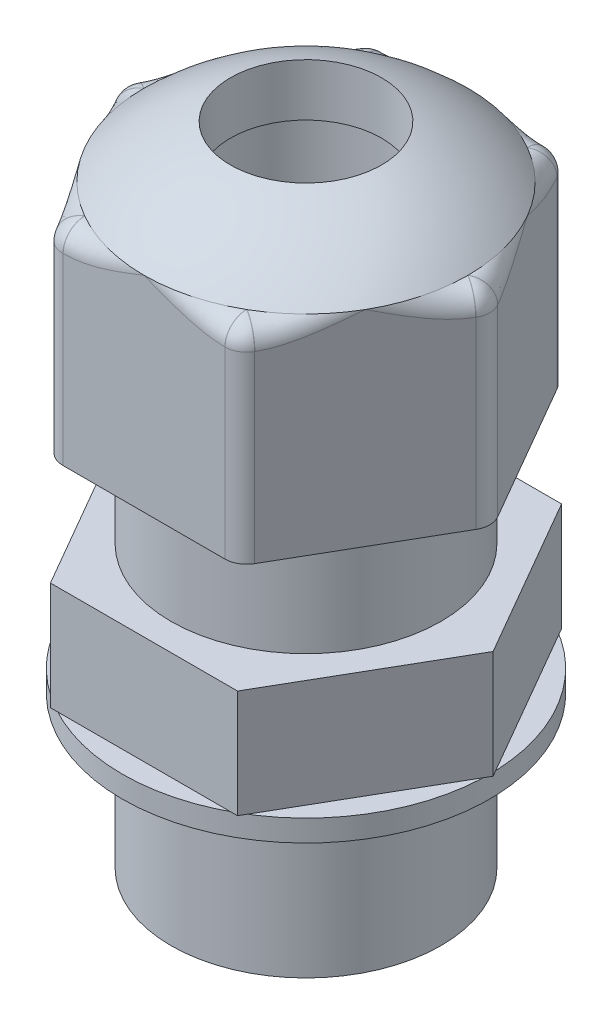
ISO-10303-21;
HEADER;
FILE_DESCRIPTION(('STEP AP214'),'2;1');
FILE_NAME('part.step','',(''),(''),'','','');
FILE_SCHEMA(('AUTOMOTIVE_DESIGN { 1 0 10303 214 1 1 1 1 }'));
ENDSEC;
DATA;
#1=APPLICATION_CONTEXT('core data for automotive mechanical design processes');
#2=APPLICATION_PROTOCOL_DEFINITION('international standard','automotive_design',2000,#1);
#3=PRODUCT_CONTEXT('',#1,'mechanical');
#4=PRODUCT('Part','Part','',(#3));
#5=PRODUCT_RELATED_PRODUCT_CATEGORY('part','',(#4));
#6=PRODUCT_DEFINITION_FORMATION('','',#4);
#7=PRODUCT_DEFINITION_CONTEXT('part definition',#1,'design');
#8=PRODUCT_DEFINITION('design','',#6,#7);
#9=PRODUCT_DEFINITION_SHAPE('','',#8);
#10=(LENGTH_UNIT() NAMED_UNIT(*) SI_UNIT(.MILLI.,.METRE.));
#11=(NAMED_UNIT(*) PLANE_ANGLE_UNIT() SI_UNIT($,.RADIAN.));
#12=(NAMED_UNIT(*) SI_UNIT($,.STERADIAN.) SOLID_ANGLE_UNIT());
#13=UNCERTAINTY_MEASURE_WITH_UNIT(LENGTH_MEASURE(1.E-05),#10,'distance_accuracy_value','');
#14=(GEOMETRIC_REPRESENTATION_CONTEXT(3) GLOBAL_UNCERTAINTY_ASSIGNED_CONTEXT((#13)) GLOBAL_UNIT_ASSIGNED_CONTEXT((#10,
#11,#12)) REPRESENTATION_CONTEXT('',''));
#15=CARTESIAN_POINT('',(0.,0.,0.));
#16=DIRECTION('',(0.,0.,1.));
#17=DIRECTION('',(1.,0.,0.));
#18=AXIS2_PLACEMENT_3D('',#15,#16,#17);
#19=CARTESIAN_POINT('',(0.,-1.,0.));
#20=DIRECTION('',(0.,-1.,0.));
#21=DIRECTION('',(0.,0.,-1.));
#22=AXIS2_PLACEMENT_3D('',#19,#20,#21);
#23=PLANE('',#22);
#24=CARTESIAN_POINT('',(0.,-1.,0.));
#25=DIRECTION('',(0.,-1.,0.));
#26=DIRECTION('',(0.,0.,-1.));
#27=AXIS2_PLACEMENT_3D('',#24,#25,#26);
#28=CIRCLE('',#27,8.5);
#29=CARTESIAN_POINT('',(0.,-1.,-8.5));
#30=VERTEX_POINT('',#29);
#31=EDGE_CURVE('E11',#30,#30,#28,.T.);
#32=ORIENTED_EDGE('',*,*,#31,.T.);
#33=EDGE_LOOP('',(#32));
#34=FACE_BOUND('',#33,.T.);
#35=CARTESIAN_POINT('',(0.,-1.,0.));
#36=DIRECTION('',(0.,-1.,0.));
#37=DIRECTION('',(0.,0.,-1.));
#38=AXIS2_PLACEMENT_3D('',#35,#36,#37);
#39=CIRCLE('',#38,6.25);
#40=CARTESIAN_POINT('',(0.,-1.,-6.25));
#41=VERTEX_POINT('',#40);
#42=EDGE_CURVE('E58',#41,#41,#39,.T.);
#43=ORIENTED_EDGE('',*,*,#42,.F.);
#44=EDGE_LOOP('',(#43));
#45=FACE_BOUND('',#44,.T.);
#46=ADVANCED_FACE('F47',(#34,#45),#23,.T.);
#47=CARTESIAN_POINT('',(0.,0.,0.));
#48=DIRECTION('',(0.,-1.,0.));
#49=DIRECTION('',(0.,0.,-1.));
#50=AXIS2_PLACEMENT_3D('',#47,#48,#49);
#51=PLANE('',#50);
#52=CARTESIAN_POINT('',(0.,0.,0.));
#53=DIRECTION('',(0.,-1.,0.));
#54=DIRECTION('',(0.,0.,-1.));
#55=AXIS2_PLACEMENT_3D('',#52,#53,#54);
#56=CIRCLE('',#55,8.5);
#57=CARTESIAN_POINT('',(0.,0.,-8.5));
#58=VERTEX_POINT('',#57);
#59=EDGE_CURVE('E51',#58,#58,#56,.T.);
#60=ORIENTED_EDGE('',*,*,#59,.F.);
#61=EDGE_LOOP('',(#60));
#62=FACE_BOUND('',#61,.T.);
#63=CARTESIAN_POINT('',(0.,0.,0.));
#64=DIRECTION('',(0.,-1.,0.));
#65=DIRECTION('',(0.,0.,-1.));
#66=AXIS2_PLACEMENT_3D('',#63,#64,#65);
#67=CIRCLE('',#66,6.25);
#68=CARTESIAN_POINT('',(0.,0.,-6.25));
#69=VERTEX_POINT('',#68);
#70=EDGE_CURVE('E60',#69,#69,#67,.T.);
#71=ORIENTED_EDGE('',*,*,#70,.T.);
#72=EDGE_LOOP('',(#71));
#73=FACE_BOUND('',#72,.T.);
#74=ADVANCED_FACE('F70',(#62,#73),#51,.F.);
#75=CARTESIAN_POINT('',(0.,-1.,0.));
#76=DIRECTION('',(0.,1.,0.));
#77=DIRECTION('',(0.,0.,1.));
#78=AXIS2_PLACEMENT_3D('',#75,#76,#77);
#79=CYLINDRICAL_SURFACE('',#78,8.5);
#80=ORIENTED_EDGE('',*,*,#31,.F.);
#81=EDGE_LOOP('',(#80));
#82=FACE_BOUND('',#81,.T.);
#83=ORIENTED_EDGE('',*,*,#59,.T.);
#84=EDGE_LOOP('',(#83));
#85=FACE_BOUND('',#84,.T.);
#86=ADVANCED_FACE('F49',(#82,#85),#79,.T.);
#87=CARTESIAN_POINT('',(0.,-1.,0.));
#88=DIRECTION('',(0.,1.,0.));
#89=DIRECTION('',(0.,0.,1.));
#90=AXIS2_PLACEMENT_3D('',#87,#88,#89);
#91=CYLINDRICAL_SURFACE('',#90,6.25);
#92=ORIENTED_EDGE('',*,*,#42,.T.);
#93=EDGE_LOOP('',(#92));
#94=FACE_BOUND('',#93,.T.);
#95=ORIENTED_EDGE('',*,*,#70,.F.);
#96=EDGE_LOOP('',(#95));
#97=FACE_BOUND('',#96,.T.);
#98=ADVANCED_FACE('F66',(#94,#97),#91,.F.);
#99=CLOSED_SHELL('',(#46,#74,#86,#98));
#100=MANIFOLD_SOLID_BREP('B2',#99);
#101=CARTESIAN_POINT('',(0.,20.,0.));
#102=DIRECTION('',(0.,-1.,0.));
#103=DIRECTION('',(0.,0.,-1.));
#104=AXIS2_PLACEMENT_3D('',#101,#102,#103);
#105=CYLINDRICAL_SURFACE('',#104,6.25);
#106=CARTESIAN_POINT('',(0.,5.,0.));
#107=DIRECTION('',(0.,1.,0.));
#108=DIRECTION('',(0.,0.,1.));
#109=AXIS2_PLACEMENT_3D('',#106,#107,#108);
#110=CIRCLE('',#109,6.25);
#111=CARTESIAN_POINT('',(0.,5.,6.25));
#112=VERTEX_POINT('',#111);
#113=EDGE_CURVE('E680',#112,#112,#110,.T.);
#114=ORIENTED_EDGE('',*,*,#113,.T.);
#115=EDGE_LOOP('',(#114));
#116=FACE_BOUND('',#115,.T.);
#117=CARTESIAN_POINT('',(0.,10.,0.));
#118=DIRECTION('',(0.,1.,0.));
#119=DIRECTION('',(0.,0.,1.));
#120=AXIS2_PLACEMENT_3D('',#117,#118,#119);
#121=CIRCLE('',#120,6.25);
#122=CARTESIAN_POINT('',(0.,10.,6.25));
#123=VERTEX_POINT('',#122);
#124=EDGE_CURVE('E495',#123,#123,#121,.T.);
#125=ORIENTED_EDGE('',*,*,#124,.F.);
#126=EDGE_LOOP('',(#125));
#127=FACE_BOUND('',#126,.T.);
#128=ADVANCED_FACE('F109',(#116,#127),#105,.T.);
#129=CARTESIAN_POINT('',(-4.3301270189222,5.,7.5));
#130=DIRECTION('',(0.,0.,-1.));
#131=DIRECTION('',(-1.,0.,0.));
#132=AXIS2_PLACEMENT_3D('',#129,#130,#131);
#133=PLANE('',#132);
#134=DIRECTION('',(1.,0.,0.));
#135=VECTOR('',#134,1.);
#136=CARTESIAN_POINT('',(-4.3301270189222,0.,7.5));
#137=LINE('',#136,#135);
#138=CARTESIAN_POINT('',(-4.3301270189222,0.,7.5));
#139=VERTEX_POINT('',#138);
#140=CARTESIAN_POINT('',(4.33012701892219,0.,7.5));
#141=VERTEX_POINT('',#140);
#142=EDGE_CURVE('E662',#139,#141,#137,.T.);
#143=ORIENTED_EDGE('',*,*,#142,.T.);
#144=DIRECTION('',(0.,-1.,0.));
#145=VECTOR('',#144,1.);
#146=CARTESIAN_POINT('',(4.33012701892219,5.,7.5));
#147=LINE('',#146,#145);
#148=CARTESIAN_POINT('',(4.33012701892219,5.,7.5));
#149=VERTEX_POINT('',#148);
#150=EDGE_CURVE('E671',#149,#141,#147,.T.);
#151=ORIENTED_EDGE('',*,*,#150,.F.);
#152=DIRECTION('',(1.,0.,0.));
#153=VECTOR('',#152,1.);
#154=CARTESIAN_POINT('',(-4.3301270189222,5.,7.5));
#155=LINE('',#154,#153);
#156=CARTESIAN_POINT('',(-4.3301270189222,5.,7.5));
#157=VERTEX_POINT('',#156);
#158=EDGE_CURVE('E1307',#157,#149,#155,.T.);
#159=ORIENTED_EDGE('',*,*,#158,.F.);
#160=DIRECTION('',(0.,-1.,0.));
#161=VECTOR('',#160,1.);
#162=CARTESIAN_POINT('',(-4.3301270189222,5.,7.5));
#163=LINE('',#162,#161);
#164=EDGE_CURVE('E1308',#157,#139,#163,.T.);
#165=ORIENTED_EDGE('',*,*,#164,.T.);
#166=EDGE_LOOP('',(#143,#151,#159,#165));
#167=FACE_BOUND('',#166,.T.);
#168=ADVANCED_FACE('F629',(#167),#133,.F.);
#169=CARTESIAN_POINT('',(4.33012701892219,5.,7.5));
#170=DIRECTION('',(-0.866025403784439,0.,-0.5));
#171=DIRECTION('',(-0.5,0.,0.866025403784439));
#172=AXIS2_PLACEMENT_3D('',#169,#170,#171);
#173=PLANE('',#172);
#174=DIRECTION('',(0.5,0.,-0.866025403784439));
#175=VECTOR('',#174,1.);
#176=CARTESIAN_POINT('',(4.33012701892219,0.,7.5));
#177=LINE('',#176,#175);
#178=CARTESIAN_POINT('',(8.66025403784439,0.,0.));
#179=VERTEX_POINT('',#178);
#180=EDGE_CURVE('E665',#141,#179,#177,.T.);
#181=ORIENTED_EDGE('',*,*,#180,.T.);
#182=DIRECTION('',(0.,-1.,0.));
#183=VECTOR('',#182,1.);
#184=CARTESIAN_POINT('',(8.66025403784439,5.,0.));
#185=LINE('',#184,#183);
#186=CARTESIAN_POINT('',(8.66025403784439,5.,0.));
#187=VERTEX_POINT('',#186);
#188=EDGE_CURVE('E1285',#187,#179,#185,.T.);
#189=ORIENTED_EDGE('',*,*,#188,.F.);
#190=DIRECTION('',(0.5,0.,-0.866025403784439));
#191=VECTOR('',#190,1.);
#192=CARTESIAN_POINT('',(4.33012701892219,5.,7.5));
#193=LINE('',#192,#191);
#194=EDGE_CURVE('E1326',#149,#187,#193,.T.);
#195=ORIENTED_EDGE('',*,*,#194,.F.);
#196=ORIENTED_EDGE('',*,*,#150,.T.);
#197=EDGE_LOOP('',(#181,#189,#195,#196));
#198=FACE_BOUND('',#197,.T.);
#199=ADVANCED_FACE('F636',(#198),#173,.F.);
#200=CARTESIAN_POINT('',(8.66025403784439,5.,0.));
#201=DIRECTION('',(-0.866025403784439,0.,0.5));
#202=DIRECTION('',(0.5,0.,0.866025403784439));
#203=AXIS2_PLACEMENT_3D('',#200,#201,#202);
#204=PLANE('',#203);
#205=DIRECTION('',(-0.5,0.,-0.866025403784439));
#206=VECTOR('',#205,1.);
#207=CARTESIAN_POINT('',(8.66025403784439,0.,0.));
#208=LINE('',#207,#206);
#209=CARTESIAN_POINT('',(4.3301270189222,0.,-7.5));
#210=VERTEX_POINT('',#209);
#211=EDGE_CURVE('E1291',#179,#210,#208,.T.);
#212=ORIENTED_EDGE('',*,*,#211,.T.);
#213=DIRECTION('',(0.,-1.,0.));
#214=VECTOR('',#213,1.);
#215=CARTESIAN_POINT('',(4.3301270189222,5.,-7.5));
#216=LINE('',#215,#214);
#217=CARTESIAN_POINT('',(4.3301270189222,5.,-7.5));
#218=VERTEX_POINT('',#217);
#219=EDGE_CURVE('E1296',#218,#210,#216,.T.);
#220=ORIENTED_EDGE('',*,*,#219,.F.);
#221=DIRECTION('',(-0.5,0.,-0.866025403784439));
#222=VECTOR('',#221,1.);
#223=CARTESIAN_POINT('',(8.66025403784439,5.,0.));
#224=LINE('',#223,#222);
#225=EDGE_CURVE('E1295',#187,#218,#224,.T.);
#226=ORIENTED_EDGE('',*,*,#225,.F.);
#227=ORIENTED_EDGE('',*,*,#188,.T.);
#228=EDGE_LOOP('',(#212,#220,#226,#227));
#229=FACE_BOUND('',#228,.T.);
#230=ADVANCED_FACE('F1254',(#229),#204,.F.);
#231=CARTESIAN_POINT('',(4.3301270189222,5.,-7.5));
#232=DIRECTION('',(0.,0.,1.));
#233=DIRECTION('',(1.,0.,0.));
#234=AXIS2_PLACEMENT_3D('',#231,#232,#233);
#235=PLANE('',#234);
#236=DIRECTION('',(-1.,0.,0.));
#237=VECTOR('',#236,1.);
#238=CARTESIAN_POINT('',(4.3301270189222,0.,-7.5));
#239=LINE('',#238,#237);
#240=CARTESIAN_POINT('',(-4.3301270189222,0.,-7.5));
#241=VERTEX_POINT('',#240);
#242=EDGE_CURVE('E1299',#210,#241,#239,.T.);
#243=ORIENTED_EDGE('',*,*,#242,.T.);
#244=DIRECTION('',(0.,-1.,0.));
#245=VECTOR('',#244,1.);
#246=CARTESIAN_POINT('',(-4.3301270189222,5.,-7.5));
#247=LINE('',#246,#245);
#248=CARTESIAN_POINT('',(-4.3301270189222,5.,-7.5));
#249=VERTEX_POINT('',#248);
#250=EDGE_CURVE('E1315',#249,#241,#247,.T.);
#251=ORIENTED_EDGE('',*,*,#250,.F.);
#252=DIRECTION('',(-1.,0.,0.));
#253=VECTOR('',#252,1.);
#254=CARTESIAN_POINT('',(4.3301270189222,5.,-7.5));
#255=LINE('',#254,#253);
#256=EDGE_CURVE('E1320',#218,#249,#255,.T.);
#257=ORIENTED_EDGE('',*,*,#256,.F.);
#258=ORIENTED_EDGE('',*,*,#219,.T.);
#259=EDGE_LOOP('',(#243,#251,#257,#258));
#260=FACE_BOUND('',#259,.T.);
#261=ADVANCED_FACE('F1244',(#260),#235,.F.);
#262=CARTESIAN_POINT('',(-4.3301270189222,5.,-7.5));
#263=DIRECTION('',(0.866025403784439,0.,0.5));
#264=DIRECTION('',(0.5,0.,-0.866025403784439));
#265=AXIS2_PLACEMENT_3D('',#262,#263,#264);
#266=PLANE('',#265);
#267=DIRECTION('',(-0.5,0.,0.866025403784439));
#268=VECTOR('',#267,1.);
#269=CARTESIAN_POINT('',(-4.3301270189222,0.,-7.5));
#270=LINE('',#269,#268);
#271=CARTESIAN_POINT('',(-8.66025403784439,0.,0.));
#272=VERTEX_POINT('',#271);
#273=EDGE_CURVE('E1301',#241,#272,#270,.T.);
#274=ORIENTED_EDGE('',*,*,#273,.T.);
#275=DIRECTION('',(0.,-1.,0.));
#276=VECTOR('',#275,1.);
#277=CARTESIAN_POINT('',(-8.66025403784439,5.,0.));
#278=LINE('',#277,#276);
#279=CARTESIAN_POINT('',(-8.66025403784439,5.,0.));
#280=VERTEX_POINT('',#279);
#281=EDGE_CURVE('E1311',#280,#272,#278,.T.);
#282=ORIENTED_EDGE('',*,*,#281,.F.);
#283=DIRECTION('',(-0.5,0.,0.866025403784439));
#284=VECTOR('',#283,1.);
#285=CARTESIAN_POINT('',(-4.3301270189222,5.,-7.5));
#286=LINE('',#285,#284);
#287=EDGE_CURVE('E1323',#249,#280,#286,.T.);
#288=ORIENTED_EDGE('',*,*,#287,.F.);
#289=ORIENTED_EDGE('',*,*,#250,.T.);
#290=EDGE_LOOP('',(#274,#282,#288,#289));
#291=FACE_BOUND('',#290,.T.);
#292=ADVANCED_FACE('F1234',(#291),#266,.F.);
#293=CARTESIAN_POINT('',(-8.66025403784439,5.,0.));
#294=DIRECTION('',(0.866025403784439,0.,-0.5));
#295=DIRECTION('',(-0.5,0.,-0.866025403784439));
#296=AXIS2_PLACEMENT_3D('',#293,#294,#295);
#297=PLANE('',#296);
#298=DIRECTION('',(0.5,0.,0.866025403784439));
#299=VECTOR('',#298,1.);
#300=CARTESIAN_POINT('',(-8.66025403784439,0.,0.));
#301=LINE('',#300,#299);
#302=EDGE_CURVE('E1305',#272,#139,#301,.T.);
#303=ORIENTED_EDGE('',*,*,#302,.T.);
#304=ORIENTED_EDGE('',*,*,#164,.F.);
#305=DIRECTION('',(0.5,0.,0.866025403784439));
#306=VECTOR('',#305,1.);
#307=CARTESIAN_POINT('',(-8.66025403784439,5.,0.));
#308=LINE('',#307,#306);
#309=EDGE_CURVE('E1312',#280,#157,#308,.T.);
#310=ORIENTED_EDGE('',*,*,#309,.F.);
#311=ORIENTED_EDGE('',*,*,#281,.T.);
#312=EDGE_LOOP('',(#303,#304,#310,#311));
#313=FACE_BOUND('',#312,.T.);
#314=ADVANCED_FACE('F1225',(#313),#297,.F.);
#315=CARTESIAN_POINT('',(4.33012701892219,5.,7.5));
#316=DIRECTION('',(0.,1.,0.));
#317=DIRECTION('',(0.,0.,1.));
#318=AXIS2_PLACEMENT_3D('',#315,#316,#317);
#319=PLANE('',#318);
#320=ORIENTED_EDGE('',*,*,#113,.F.);
#321=EDGE_LOOP('',(#320));
#322=FACE_BOUND('',#321,.T.);
#323=ORIENTED_EDGE('',*,*,#158,.T.);
#324=ORIENTED_EDGE('',*,*,#194,.T.);
#325=ORIENTED_EDGE('',*,*,#225,.T.);
#326=ORIENTED_EDGE('',*,*,#256,.T.);
#327=ORIENTED_EDGE('',*,*,#287,.T.);
#328=ORIENTED_EDGE('',*,*,#309,.T.);
#329=EDGE_LOOP('',(#323,#324,#325,#326,#327,#328));
#330=FACE_BOUND('',#329,.T.);
#331=ADVANCED_FACE('F1216',(#322,#330),#319,.T.);
#332=CARTESIAN_POINT('',(4.33012701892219,0.,7.5));
#333=DIRECTION('',(0.,1.,0.));
#334=DIRECTION('',(0.,0.,1.));
#335=AXIS2_PLACEMENT_3D('',#332,#333,#334);
#336=PLANE('',#335);
#337=CARTESIAN_POINT('',(0.,0.,0.));
#338=DIRECTION('',(0.,1.,0.));
#339=DIRECTION('',(0.,0.,1.));
#340=AXIS2_PLACEMENT_3D('',#337,#338,#339);
#341=CIRCLE('',#340,6.25);
#342=CARTESIAN_POINT('',(0.,0.,6.25));
#343=VERTEX_POINT('',#342);
#344=EDGE_CURVE('E660',#343,#343,#341,.T.);
#345=ORIENTED_EDGE('',*,*,#344,.T.);
#346=EDGE_LOOP('',(#345));
#347=FACE_BOUND('',#346,.T.);
#348=ORIENTED_EDGE('',*,*,#142,.F.);
#349=ORIENTED_EDGE('',*,*,#302,.F.);
#350=ORIENTED_EDGE('',*,*,#273,.F.);
#351=ORIENTED_EDGE('',*,*,#242,.F.);
#352=ORIENTED_EDGE('',*,*,#211,.F.);
#353=ORIENTED_EDGE('',*,*,#180,.F.);
#354=EDGE_LOOP('',(#348,#349,#350,#351,#352,#353));
#355=FACE_BOUND('',#354,.T.);
#356=ADVANCED_FACE('F652',(#347,#355),#336,.F.);
#357=CARTESIAN_POINT('',(0.,-8.,0.));
#358=DIRECTION('',(0.,-1.,0.));
#359=DIRECTION('',(0.,0.,-1.));
#360=AXIS2_PLACEMENT_3D('',#357,#358,#359);
#361=PLANE('',#360);
#362=CARTESIAN_POINT('',(0.,-8.,0.));
#363=DIRECTION('',(0.,1.,0.));
#364=DIRECTION('',(0.,0.,1.));
#365=AXIS2_PLACEMENT_3D('',#362,#363,#364);
#366=CIRCLE('',#365,4.);
#367=CARTESIAN_POINT('',(0.,-8.,4.));
#368=VERTEX_POINT('',#367);
#369=EDGE_CURVE('E667',#368,#368,#366,.T.);
#370=ORIENTED_EDGE('',*,*,#369,.T.);
#371=EDGE_LOOP('',(#370));
#372=FACE_BOUND('',#371,.T.);
#373=CARTESIAN_POINT('',(0.,-8.,0.));
#374=DIRECTION('',(0.,-1.,0.));
#375=DIRECTION('',(0.,0.,-1.));
#376=AXIS2_PLACEMENT_3D('',#373,#374,#375);
#377=CIRCLE('',#376,6.25);
#378=CARTESIAN_POINT('',(0.,-8.,-6.25));
#379=VERTEX_POINT('',#378);
#380=EDGE_CURVE('E657',#379,#379,#377,.T.);
#381=ORIENTED_EDGE('',*,*,#380,.T.);
#382=EDGE_LOOP('',(#381));
#383=FACE_BOUND('',#382,.T.);
#384=ADVANCED_FACE('F645',(#372,#383),#361,.T.);
#385=ORIENTED_EDGE('',*,*,#380,.F.);
#386=EDGE_LOOP('',(#385));
#387=FACE_BOUND('',#386,.T.);
#388=ORIENTED_EDGE('',*,*,#344,.F.);
#389=EDGE_LOOP('',(#388));
#390=FACE_BOUND('',#389,.T.);
#391=ADVANCED_FACE('F632',(#387,#390),#105,.T.);
#392=CARTESIAN_POINT('',(0.,-8.,0.));
#393=DIRECTION('',(0.,1.,0.));
#394=DIRECTION('',(0.,0.,1.));
#395=AXIS2_PLACEMENT_3D('',#392,#393,#394);
#396=CYLINDRICAL_SURFACE('',#395,4.);
#397=CARTESIAN_POINT('',(0.,19.5,0.));
#398=DIRECTION('',(0.,-1.,0.));
#399=DIRECTION('',(0.,0.,-1.));
#400=AXIS2_PLACEMENT_3D('',#397,#398,#399);
#401=CIRCLE('',#400,4.);
#402=CARTESIAN_POINT('',(0.,19.5,-4.));
#403=VERTEX_POINT('',#402);
#404=EDGE_CURVE('E673',#403,#403,#401,.F.);
#405=ORIENTED_EDGE('',*,*,#404,.T.);
#406=EDGE_LOOP('',(#405));
#407=FACE_BOUND('',#406,.T.);
#408=ORIENTED_EDGE('',*,*,#369,.F.);
#409=EDGE_LOOP('',(#408));
#410=FACE_BOUND('',#409,.T.);
#411=ADVANCED_FACE('F644',(#407,#410),#396,.F.);
#412=CARTESIAN_POINT('',(0.,19.5,0.));
#413=DIRECTION('',(0.,-1.,0.));
#414=DIRECTION('',(0.,0.,-1.));
#415=AXIS2_PLACEMENT_3D('',#412,#413,#414);
#416=PLANE('',#415);
#417=CARTESIAN_POINT('',(0.,19.5,0.));
#418=DIRECTION('',(0.,-1.,0.));
#419=DIRECTION('',(0.,0.,-1.));
#420=AXIS2_PLACEMENT_3D('',#417,#418,#419);
#421=CIRCLE('',#420,3.5);
#422=CARTESIAN_POINT('',(0.,19.5,-3.5));
#423=VERTEX_POINT('',#422);
#424=EDGE_CURVE('E1078',#423,#423,#421,.T.);
#425=ORIENTED_EDGE('',*,*,#424,.F.);
#426=EDGE_LOOP('',(#425));
#427=FACE_BOUND('',#426,.T.);
#428=ORIENTED_EDGE('',*,*,#404,.F.);
#429=EDGE_LOOP('',(#428));
#430=FACE_BOUND('',#429,.T.);
#431=ADVANCED_FACE('F539',(#427,#430),#416,.T.);
#432=CARTESIAN_POINT('',(-4.3301270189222,19.5,7.5));
#433=DIRECTION('',(0.,1.,0.));
#434=DIRECTION('',(0.,0.,1.));
#435=AXIS2_PLACEMENT_3D('',#432,#433,#434);
#436=PLANE('',#435);
#437=CARTESIAN_POINT('',(0.,19.5,0.));
#438=DIRECTION('',(0.,-1.,0.));
#439=DIRECTION('',(0.,0.,-1.));
#440=AXIS2_PLACEMENT_3D('',#437,#438,#439);
#441=CIRCLE('',#440,7.5);
#442=CARTESIAN_POINT('',(-3.74165738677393,19.5,6.5));
#443=VERTEX_POINT('',#442);
#444=CARTESIAN_POINT('',(-3.75833643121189,19.5,6.49037034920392));
#445=VERTEX_POINT('',#444);
#446=EDGE_CURVE('E365',#443,#445,#441,.T.);
#447=ORIENTED_EDGE('',*,*,#446,.T.);
#448=DIRECTION('',(0.5,0.,0.866025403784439));
#449=VECTOR('',#448,1.);
#450=CARTESIAN_POINT('',(-3.46410161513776,19.5,7.));
#451=LINE('',#450,#449);
#452=CARTESIAN_POINT('',(-3.75277674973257,19.5,6.5));
#453=VERTEX_POINT('',#452);
#454=EDGE_CURVE('E45',#445,#453,#451,.T.);
#455=ORIENTED_EDGE('',*,*,#454,.T.);
#456=DIRECTION('',(1.,0.,0.));
#457=VECTOR('',#456,1.);
#458=CARTESIAN_POINT('',(0.,19.5,6.5));
#459=LINE('',#458,#457);
#460=EDGE_CURVE('E118',#453,#443,#459,.T.);
#461=ORIENTED_EDGE('',*,*,#460,.T.);
#462=EDGE_LOOP('',(#447,#455,#461));
#463=FACE_BOUND('',#462,.T.);
#464=ADVANCED_FACE('F1158',(#463),#436,.T.);
#465=DIRECTION('',(-0.5,0.,0.866025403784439));
#466=VECTOR('',#465,1.);
#467=CARTESIAN_POINT('',(-7.79422863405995,19.5,0.499999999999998));
#468=LINE('',#467,#466);
#469=CARTESIAN_POINT('',(-7.49999381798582,19.5,-0.00962965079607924));
#470=VERTEX_POINT('',#469);
#471=CARTESIAN_POINT('',(-7.50555349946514,19.5,0.));
#472=VERTEX_POINT('',#471);
#473=EDGE_CURVE('E1053',#470,#472,#468,.T.);
#474=ORIENTED_EDGE('',*,*,#473,.T.);
#475=DIRECTION('',(0.5,0.,0.866025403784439));
#476=VECTOR('',#475,1.);
#477=CARTESIAN_POINT('',(-5.62916512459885,19.5,3.25));
#478=LINE('',#477,#476);
#479=CARTESIAN_POINT('',(-7.49999381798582,19.5,0.0096296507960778));
#480=VERTEX_POINT('',#479);
#481=EDGE_CURVE('E464',#472,#480,#478,.T.);
#482=ORIENTED_EDGE('',*,*,#481,.T.);
#483=EDGE_CURVE('E867',#480,#470,#441,.T.);
#484=ORIENTED_EDGE('',*,*,#483,.T.);
#485=EDGE_LOOP('',(#474,#482,#484));
#486=FACE_BOUND('',#485,.T.);
#487=ADVANCED_FACE('F1058',(#486),#436,.T.);
#488=DIRECTION('',(-1.,0.,0.));
#489=VECTOR('',#488,1.);
#490=CARTESIAN_POINT('',(-4.3301270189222,19.5,-6.5));
#491=LINE('',#490,#489);
#492=CARTESIAN_POINT('',(-3.74165738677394,19.5,-6.5));
#493=VERTEX_POINT('',#492);
#494=CARTESIAN_POINT('',(-3.75277674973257,19.5,-6.5));
#495=VERTEX_POINT('',#494);
#496=EDGE_CURVE('E1101',#493,#495,#491,.T.);
#497=ORIENTED_EDGE('',*,*,#496,.T.);
#498=DIRECTION('',(-0.5,0.,0.866025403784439));
#499=VECTOR('',#498,1.);
#500=CARTESIAN_POINT('',(-5.62916512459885,19.5,-3.25));
#501=LINE('',#500,#499);
#502=CARTESIAN_POINT('',(-3.75833643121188,19.5,-6.49037034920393));
#503=VERTEX_POINT('',#502);
#504=EDGE_CURVE('E1041',#495,#503,#501,.T.);
#505=ORIENTED_EDGE('',*,*,#504,.T.);
#506=EDGE_CURVE('E871',#503,#493,#441,.T.);
#507=ORIENTED_EDGE('',*,*,#506,.T.);
#508=EDGE_LOOP('',(#497,#505,#507));
#509=FACE_BOUND('',#508,.T.);
#510=ADVANCED_FACE('F1099',(#509),#436,.T.);
#511=DIRECTION('',(-0.5,0.,-0.866025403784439));
#512=VECTOR('',#511,1.);
#513=CARTESIAN_POINT('',(3.46410161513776,19.5,-7.));
#514=LINE('',#513,#512);
#515=CARTESIAN_POINT('',(3.75833643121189,19.5,-6.49037034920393));
#516=VERTEX_POINT('',#515);
#517=CARTESIAN_POINT('',(3.75277674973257,19.5,-6.5));
#518=VERTEX_POINT('',#517);
#519=EDGE_CURVE('E1012',#516,#518,#514,.T.);
#520=ORIENTED_EDGE('',*,*,#519,.T.);
#521=DIRECTION('',(-1.,0.,0.));
#522=VECTOR('',#521,1.);
#523=CARTESIAN_POINT('',(0.,19.5,-6.5));
#524=LINE('',#523,#522);
#525=CARTESIAN_POINT('',(3.74165738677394,19.5,-6.5));
#526=VERTEX_POINT('',#525);
#527=EDGE_CURVE('E1014',#518,#526,#524,.T.);
#528=ORIENTED_EDGE('',*,*,#527,.T.);
#529=EDGE_CURVE('E878',#526,#516,#441,.T.);
#530=ORIENTED_EDGE('',*,*,#529,.T.);
#531=EDGE_LOOP('',(#520,#528,#530));
#532=FACE_BOUND('',#531,.T.);
#533=ADVANCED_FACE('F1121',(#532),#436,.T.);
#534=DIRECTION('',(0.5,0.,-0.866025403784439));
#535=VECTOR('',#534,1.);
#536=CARTESIAN_POINT('',(7.79422863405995,19.5,-0.500000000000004));
#537=LINE('',#536,#535);
#538=CARTESIAN_POINT('',(7.49999381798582,19.5,0.00962965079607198));
#539=VERTEX_POINT('',#538);
#540=CARTESIAN_POINT('',(7.50555349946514,19.5,0.));
#541=VERTEX_POINT('',#540);
#542=EDGE_CURVE('E918',#539,#541,#537,.T.);
#543=ORIENTED_EDGE('',*,*,#542,.T.);
#544=DIRECTION('',(-0.5,0.,-0.866025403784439));
#545=VECTOR('',#544,1.);
#546=CARTESIAN_POINT('',(5.62916512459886,19.5,-3.25));
#547=LINE('',#546,#545);
#548=CARTESIAN_POINT('',(7.49999381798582,19.5,-0.00962965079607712));
#549=VERTEX_POINT('',#548);
#550=EDGE_CURVE('E924',#541,#549,#547,.T.);
#551=ORIENTED_EDGE('',*,*,#550,.T.);
#552=EDGE_CURVE('E375',#549,#539,#441,.T.);
#553=ORIENTED_EDGE('',*,*,#552,.T.);
#554=EDGE_LOOP('',(#543,#551,#553));
#555=FACE_BOUND('',#554,.T.);
#556=ADVANCED_FACE('F1166',(#555),#436,.T.);
#557=DIRECTION('',(1.,0.,0.));
#558=VECTOR('',#557,1.);
#559=CARTESIAN_POINT('',(4.33012701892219,19.5,6.5));
#560=LINE('',#559,#558);
#561=CARTESIAN_POINT('',(3.74165738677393,19.5,6.5));
#562=VERTEX_POINT('',#561);
#563=CARTESIAN_POINT('',(3.75277674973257,19.5,6.5));
#564=VERTEX_POINT('',#563);
#565=EDGE_CURVE('E677',#562,#564,#560,.T.);
#566=ORIENTED_EDGE('',*,*,#565,.T.);
#567=DIRECTION('',(0.5,0.,-0.866025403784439));
#568=VECTOR('',#567,1.);
#569=CARTESIAN_POINT('',(5.62916512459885,19.5,3.25));
#570=LINE('',#569,#568);
#571=CARTESIAN_POINT('',(3.75833643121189,19.5,6.49037034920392));
#572=VERTEX_POINT('',#571);
#573=EDGE_CURVE('E679',#564,#572,#570,.T.);
#574=ORIENTED_EDGE('',*,*,#573,.T.);
#575=EDGE_CURVE('E374',#572,#562,#441,.T.);
#576=ORIENTED_EDGE('',*,*,#575,.T.);
#577=EDGE_LOOP('',(#566,#574,#576));
#578=FACE_BOUND('',#577,.T.);
#579=ADVANCED_FACE('F530',(#578),#436,.T.);
#580=CARTESIAN_POINT('',(-4.3301270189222,10.,7.5));
#581=DIRECTION('',(0.,1.,0.));
#582=DIRECTION('',(0.,0.,1.));
#583=AXIS2_PLACEMENT_3D('',#580,#581,#582);
#584=PLANE('',#583);
#585=DIRECTION('',(0.5,0.,0.866025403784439));
#586=VECTOR('',#585,1.);
#587=CARTESIAN_POINT('',(-8.66025403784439,10.,0.));
#588=LINE('',#587,#586);
#589=CARTESIAN_POINT('',(-8.37157890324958,10.,0.499999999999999));
#590=VERTEX_POINT('',#589);
#591=CARTESIAN_POINT('',(-4.61880215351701,10.,7.));
#592=VERTEX_POINT('',#591);
#593=EDGE_CURVE('E479',#590,#592,#588,.T.);
#594=ORIENTED_EDGE('',*,*,#593,.F.);
#595=CARTESIAN_POINT('',(-7.50555349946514,10.,0.));
#596=DIRECTION('',(0.,1.,0.));
#597=DIRECTION('',(0.,0.,1.));
#598=AXIS2_PLACEMENT_3D('',#595,#596,#597);
#599=CIRCLE('',#598,1.);
#600=CARTESIAN_POINT('',(-8.37157890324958,10.,-0.5));
#601=VERTEX_POINT('',#600);
#602=EDGE_CURVE('E490',#590,#601,#599,.F.);
#603=ORIENTED_EDGE('',*,*,#602,.T.);
#604=DIRECTION('',(-0.5,0.,0.866025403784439));
#605=VECTOR('',#604,1.);
#606=CARTESIAN_POINT('',(-4.3301270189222,10.,-7.5));
#607=LINE('',#606,#605);
#608=CARTESIAN_POINT('',(-4.61880215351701,10.,-7.));
#609=VERTEX_POINT('',#608);
#610=EDGE_CURVE('E1090',#609,#601,#607,.T.);
#611=ORIENTED_EDGE('',*,*,#610,.F.);
#612=CARTESIAN_POINT('',(-3.75277674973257,10.,-6.5));
#613=DIRECTION('',(0.,1.,0.));
#614=DIRECTION('',(0.,0.,1.));
#615=AXIS2_PLACEMENT_3D('',#612,#613,#614);
#616=CIRCLE('',#615,1.);
#617=CARTESIAN_POINT('',(-3.75277674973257,10.,-7.5));
#618=VERTEX_POINT('',#617);
#619=EDGE_CURVE('E500',#609,#618,#616,.F.);
#620=ORIENTED_EDGE('',*,*,#619,.T.);
#621=DIRECTION('',(-1.,0.,0.));
#622=VECTOR('',#621,1.);
#623=CARTESIAN_POINT('',(4.3301270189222,10.,-7.5));
#624=LINE('',#623,#622);
#625=CARTESIAN_POINT('',(3.75277674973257,10.,-7.5));
#626=VERTEX_POINT('',#625);
#627=EDGE_CURVE('E992',#626,#618,#624,.T.);
#628=ORIENTED_EDGE('',*,*,#627,.F.);
#629=CARTESIAN_POINT('',(3.75277674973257,10.,-6.5));
#630=DIRECTION('',(0.,1.,0.));
#631=DIRECTION('',(0.,0.,1.));
#632=AXIS2_PLACEMENT_3D('',#629,#630,#631);
#633=CIRCLE('',#632,1.);
#634=CARTESIAN_POINT('',(4.61880215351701,10.,-7.));
#635=VERTEX_POINT('',#634);
#636=EDGE_CURVE('E503',#626,#635,#633,.F.);
#637=ORIENTED_EDGE('',*,*,#636,.T.);
#638=DIRECTION('',(-0.5,0.,-0.866025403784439));
#639=VECTOR('',#638,1.);
#640=CARTESIAN_POINT('',(8.66025403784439,10.,0.));
#641=LINE('',#640,#639);
#642=CARTESIAN_POINT('',(8.37157890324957,10.,-0.500000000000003));
#643=VERTEX_POINT('',#642);
#644=EDGE_CURVE('E990',#643,#635,#641,.T.);
#645=ORIENTED_EDGE('',*,*,#644,.F.);
#646=CARTESIAN_POINT('',(7.50555349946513,10.,0.));
#647=DIRECTION('',(0.,1.,0.));
#648=DIRECTION('',(0.,0.,1.));
#649=AXIS2_PLACEMENT_3D('',#646,#647,#648);
#650=CIRCLE('',#649,1.);
#651=CARTESIAN_POINT('',(8.37157890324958,10.,0.499999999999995));
#652=VERTEX_POINT('',#651);
#653=EDGE_CURVE('E974',#643,#652,#650,.F.);
#654=ORIENTED_EDGE('',*,*,#653,.T.);
#655=DIRECTION('',(0.5,0.,-0.866025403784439));
#656=VECTOR('',#655,1.);
#657=CARTESIAN_POINT('',(4.33012701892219,10.,7.5));
#658=LINE('',#657,#656);
#659=CARTESIAN_POINT('',(4.61880215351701,10.,7.));
#660=VERTEX_POINT('',#659);
#661=EDGE_CURVE('E998',#660,#652,#658,.T.);
#662=ORIENTED_EDGE('',*,*,#661,.F.);
#663=CARTESIAN_POINT('',(3.75277674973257,10.,6.5));
#664=DIRECTION('',(0.,1.,0.));
#665=DIRECTION('',(0.,0.,1.));
#666=AXIS2_PLACEMENT_3D('',#663,#664,#665);
#667=CIRCLE('',#666,1.);
#668=CARTESIAN_POINT('',(3.75277674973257,10.,7.5));
#669=VERTEX_POINT('',#668);
#670=EDGE_CURVE('E981',#660,#669,#667,.F.);
#671=ORIENTED_EDGE('',*,*,#670,.T.);
#672=DIRECTION('',(1.,0.,0.));
#673=VECTOR('',#672,1.);
#674=CARTESIAN_POINT('',(-4.3301270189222,10.,7.5));
#675=LINE('',#674,#673);
#676=CARTESIAN_POINT('',(-3.75277674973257,10.,7.5));
#677=VERTEX_POINT('',#676);
#678=EDGE_CURVE('E494',#677,#669,#675,.T.);
#679=ORIENTED_EDGE('',*,*,#678,.F.);
#680=CARTESIAN_POINT('',(-3.75277674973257,10.,6.5));
#681=DIRECTION('',(0.,1.,0.));
#682=DIRECTION('',(0.,0.,1.));
#683=AXIS2_PLACEMENT_3D('',#680,#681,#682);
#684=CIRCLE('',#683,1.);
#685=EDGE_CURVE('E493',#677,#592,#684,.F.);
#686=ORIENTED_EDGE('',*,*,#685,.T.);
#687=EDGE_LOOP('',(#594,#603,#611,#620,#628,#637,#645,#654,#662,#671,#679,#686));
#688=FACE_BOUND('',#687,.T.);
#689=ORIENTED_EDGE('',*,*,#124,.T.);
#690=EDGE_LOOP('',(#689));
#691=FACE_BOUND('',#690,.T.);
#692=ADVANCED_FACE('F487',(#688,#691),#584,.F.);
#693=CARTESIAN_POINT('',(-8.66025403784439,19.5,0.));
#694=DIRECTION('',(0.866025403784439,0.,-0.5));
#695=DIRECTION('',(-0.5,0.,-0.866025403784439));
#696=AXIS2_PLACEMENT_3D('',#693,#694,#695);
#697=PLANE('',#696);
#698=DIRECTION('',(0.5,0.,0.866025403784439));
#699=VECTOR('',#698,1.);
#700=CARTESIAN_POINT('',(-8.66025403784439,18.5,0.));
#701=LINE('',#700,#699);
#702=CARTESIAN_POINT('',(-8.36601922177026,18.5,0.509629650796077));
#703=VERTEX_POINT('',#702);
#704=CARTESIAN_POINT('',(-8.37157890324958,18.5,0.499999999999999));
#705=VERTEX_POINT('',#704);
#706=EDGE_CURVE('E474',#703,#705,#701,.F.);
#707=ORIENTED_EDGE('',*,*,#706,.T.);
#708=DIRECTION('',(0.,-1.,0.));
#709=VECTOR('',#708,1.);
#710=CARTESIAN_POINT('',(-8.37157890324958,19.5,0.499999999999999));
#711=LINE('',#710,#709);
#712=EDGE_CURVE('E383',#705,#590,#711,.T.);
#713=ORIENTED_EDGE('',*,*,#712,.T.);
#714=ORIENTED_EDGE('',*,*,#593,.T.);
#715=DIRECTION('',(0.,-1.,0.));
#716=VECTOR('',#715,1.);
#717=CARTESIAN_POINT('',(-4.61880215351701,19.5,7.));
#718=LINE('',#717,#716);
#719=CARTESIAN_POINT('',(-4.61880215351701,18.5,7.));
#720=VERTEX_POINT('',#719);
#721=EDGE_CURVE('E467',#592,#720,#718,.F.);
#722=ORIENTED_EDGE('',*,*,#721,.T.);
#723=DIRECTION('',(0.5,0.,0.866025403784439));
#724=VECTOR('',#723,1.);
#725=CARTESIAN_POINT('',(-6.49519052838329,18.5,3.75));
#726=LINE('',#725,#724);
#727=CARTESIAN_POINT('',(-4.62436183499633,18.5,6.99037034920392));
#728=VERTEX_POINT('',#727);
#729=EDGE_CURVE('E463',#720,#728,#726,.F.);
#730=ORIENTED_EDGE('',*,*,#729,.T.);
#731=CARTESIAN_POINT('',(-3.19442229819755,19.5,6.78569570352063));
#732=CARTESIAN_POINT('',(-4.41666603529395,19.9701946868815,7.3501100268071));
#733=CARTESIAN_POINT('',(-4.23714700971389,18.5901157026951,7.66104610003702));
#734=CARTESIAN_POINT('',(-3.25042993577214,19.5,6.75933592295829));
#735=CARTESIAN_POINT('',(-4.42486475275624,19.9083386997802,7.3359094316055));
#736=CARTESIAN_POINT('',(-4.27692860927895,18.5694762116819,7.59214234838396));
#737=CARTESIAN_POINT('',(-3.30774891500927,19.5,6.73149915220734));
#738=CARTESIAN_POINT('',(-4.43906381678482,19.8488821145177,7.31131593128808));
#739=CARTESIAN_POINT('',(-4.3171728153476,18.552937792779,7.52243733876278));
#740=CARTESIAN_POINT('',(-3.42431112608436,19.5,6.67295412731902));
#741=CARTESIAN_POINT('',(-4.47609849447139,19.7396336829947,7.24716998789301));
#742=CARTESIAN_POINT('',(-4.39814124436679,18.5269796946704,7.38219590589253));
#743=CARTESIAN_POINT('',(-3.48354942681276,19.5,6.6422529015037));
#744=CARTESIAN_POINT('',(-4.49857578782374,19.6892510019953,7.2082381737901));
#745=CARTESIAN_POINT('',(-4.43886408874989,18.5175430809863,7.31166187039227));
#746=CARTESIAN_POINT('',(-3.66194638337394,19.5,6.54661623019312));
#747=CARTESIAN_POINT('',(-4.57257773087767,19.5564161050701,7.08006304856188));
#748=CARTESIAN_POINT('',(-4.56030883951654,18.4983229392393,7.1013133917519));
#749=CARTESIAN_POINT('',(-3.78327594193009,19.5,6.47745920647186));
#750=CARTESIAN_POINT('',(-4.6330967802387,19.4825282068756,6.9752409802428));
#751=CARTESIAN_POINT('',(-4.64136160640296,18.4971517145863,6.96092588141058));
#752=CARTESIAN_POINT('',(-4.06346436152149,19.5,6.30652802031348));
#753=CARTESIAN_POINT('',(-4.78219261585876,19.3516629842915,6.71699941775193));
#754=CARTESIAN_POINT('',(-4.82591607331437,18.5141280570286,6.64126816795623));
#755=CARTESIAN_POINT('',(-4.22319467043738,19.5,6.20106871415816));
#756=CARTESIAN_POINT('',(-4.87544834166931,19.2994916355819,6.55547576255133));
#757=CARTESIAN_POINT('',(-4.92925518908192,18.5378572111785,6.46227956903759));
#758=CARTESIAN_POINT('',(-4.54249849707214,19.5,5.97113829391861));
#759=CARTESIAN_POINT('',(-5.06840156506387,19.232707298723,6.22127097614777));
#760=CARTESIAN_POINT('',(-5.13434065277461,18.6052454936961,6.10706112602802));
#761=CARTESIAN_POINT('',(-4.70207136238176,19.5,5.84663723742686));
#762=CARTESIAN_POINT('',(-5.16891744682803,19.2155963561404,6.04717236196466));
#763=CARTESIAN_POINT('',(-5.23608420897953,18.6489362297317,5.93083611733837));
#764=CARTESIAN_POINT('',(-5.01829861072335,19.5,5.57765320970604));
#765=CARTESIAN_POINT('',(-5.37283939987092,19.2068332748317,5.69396917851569));
#766=CARTESIAN_POINT('',(-5.43883502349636,18.7509154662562,5.57966140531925));
#767=CARTESIAN_POINT('',(-5.17490308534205,19.5,5.4329695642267));
#768=CARTESIAN_POINT('',(-5.47737016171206,19.2142932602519,5.51291658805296));
#769=CARTESIAN_POINT('',(-5.53982256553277,18.8093560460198,5.40474585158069));
#770=CARTESIAN_POINT('',(-5.47926598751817,19.5,5.12585051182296));
#771=CARTESIAN_POINT('',(-5.68630072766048,19.2462055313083,5.15103823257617));
#772=CARTESIAN_POINT('',(-5.74016517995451,18.9359301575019,5.05774226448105));
#773=CARTESIAN_POINT('',(-5.6270295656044,19.5,4.96342559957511));
#774=CARTESIAN_POINT('',(-5.79180101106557,19.2702975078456,4.96830638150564));
#775=CARTESIAN_POINT('',(-5.83952117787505,19.0040579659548,4.88565262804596));
#776=CARTESIAN_POINT('',(-5.90088210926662,19.5,4.63383762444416));
#777=CARTESIAN_POINT('',(-5.99523093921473,19.3266192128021,4.61595541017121));
#778=CARTESIAN_POINT('',(-6.03066342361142,19.1416366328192,4.55458454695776));
#779=CARTESIAN_POINT('',(-6.0277568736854,19.5,4.46768236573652));
#780=CARTESIAN_POINT('',(-6.09400498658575,19.3582645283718,4.44487374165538));
#781=CARTESIAN_POINT('',(-6.12251909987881,19.2107083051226,4.39548584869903));
#782=CARTESIAN_POINT('',(-6.26778640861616,19.5,4.12415188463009));
#783=CARTESIAN_POINT('',(-6.29044666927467,19.4254914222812,4.10462676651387));
#784=CARTESIAN_POINT('',(-6.30547956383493,19.3512180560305,4.07858902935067));
#785=CARTESIAN_POINT('',(-6.38097812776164,19.5,3.94680893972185));
#786=CARTESIAN_POINT('',(-6.38898901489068,19.4613213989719,3.93394641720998));
#787=CARTESIAN_POINT('',(-6.39658572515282,19.4226490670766,3.92078852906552));
#788=CARTESIAN_POINT('',(-6.48941127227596,19.5,3.75999667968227));
#789=CARTESIAN_POINT('',(-6.48980191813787,19.4980373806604,3.75933334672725));
#790=CARTESIAN_POINT('',(-6.49018682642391,19.4960747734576,3.75866666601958));
#791=CARTESIAN_POINT('',(-6.4923037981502,19.5,3.75500001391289));
#792=CARTESIAN_POINT('',(-6.49249622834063,19.4990186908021,3.75466666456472));
#793=CARTESIAN_POINT('',(-6.49268867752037,19.4980373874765,3.75433333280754));
#794=CARTESIAN_POINT('',(-6.49519052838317,19.5,3.75000000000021));
#795=CARTESIAN_POINT('',(-6.49519052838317,19.5,3.75000000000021));
#796=CARTESIAN_POINT('',(-6.49519052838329,19.5,3.75));
#797=(BOUNDED_SURFACE() B_SPLINE_SURFACE(3,2,((#731,#732,#733),(#734,#735,#736),(#737,#738,
#739),(#740,#741,#742),(#743,#744,#745),(#746,#747,#748),(#749,#750,#751),(#752,#753,#754),
(#755,#756,#757),(#758,#759,#760),(#761,#762,#763),(#764,#765,#766),(#767,#768,#769),(#770,#771,
#772),(#773,#774,#775),(#776,#777,#778),(#779,#780,#781),(#782,#783,#784),(#785,#786,#787),
(#788,#789,#790),(#791,#792,#793),(#794,#795,#796)),.UNSPECIFIED.,.F.,.F.,
.F.) B_SPLINE_SURFACE_WITH_KNOTS((4,2,2,2,2,2,2,2,2,2,4),(3,3),(0.,0.246281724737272,
0.491974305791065,0.976942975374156,1.59965691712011,2.22336031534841,2.85377776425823,
3.48382429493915,4.0725879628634,4.65972447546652,4.67584899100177),(0.,1.),
.UNSPECIFIED.) GEOMETRIC_REPRESENTATION_ITEM() RATIONAL_B_SPLINE_SURFACE(((1.,0.574150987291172,
1.),(1.,0.589530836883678,1.),(1.,0.604468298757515,1.),(1.,0.633417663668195,1.),(1.,
0.647431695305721,1.),(1.,0.687780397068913,1.),(1.,0.712822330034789,1.),(1.,0.76620274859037,
1.),(1.,0.793457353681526,1.),(1.,0.842823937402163,1.),(1.,0.864927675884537,1.),(1.,
0.9043186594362,1.),(1.,0.921551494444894,1.),(1.,0.950931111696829,1.),(1.,0.963080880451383,
1.),(1.,0.981680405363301,1.),(1.,0.988451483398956,1.),(1.,0.99754196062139,1.),(1.,
0.999873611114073,1.),(1.,0.999998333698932,1.),(1.,1.00000000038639,1.),(1.,1.,1.))) REPRESENTATION_ITEM('') SURFACE());
#798=CARTESIAN_POINT('',(-4.23714700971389,18.5901157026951,7.66104610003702));
#799=CARTESIAN_POINT('',(-4.27692860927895,18.5694762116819,7.59214234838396));
#800=CARTESIAN_POINT('',(-4.3171728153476,18.552937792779,7.52243733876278));
#801=CARTESIAN_POINT('',(-4.39814124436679,18.5269796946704,7.38219590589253));
#802=CARTESIAN_POINT('',(-4.43886408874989,18.5175430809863,7.31166187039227));
#803=CARTESIAN_POINT('',(-4.56030883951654,18.4983229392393,7.1013133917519));
#804=CARTESIAN_POINT('',(-4.64136160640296,18.4971517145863,6.96092588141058));
#805=CARTESIAN_POINT('',(-4.82591607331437,18.5141280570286,6.64126816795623));
#806=CARTESIAN_POINT('',(-4.92925518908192,18.5378572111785,6.46227956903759));
#807=CARTESIAN_POINT('',(-5.13434065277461,18.6052454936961,6.10706112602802));
#808=CARTESIAN_POINT('',(-5.23608420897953,18.6489362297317,5.93083611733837));
#809=CARTESIAN_POINT('',(-5.43883502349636,18.7509154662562,5.57966140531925));
#810=CARTESIAN_POINT('',(-5.53982256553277,18.8093560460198,5.40474585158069));
#811=CARTESIAN_POINT('',(-5.74016517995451,18.9359301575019,5.05774226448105));
#812=CARTESIAN_POINT('',(-5.83952117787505,19.0040579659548,4.88565262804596));
#813=CARTESIAN_POINT('',(-6.03066342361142,19.1416366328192,4.55458454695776));
#814=CARTESIAN_POINT('',(-6.12251909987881,19.2107083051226,4.39548584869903));
#815=CARTESIAN_POINT('',(-6.30547956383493,19.3512180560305,4.07858902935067));
#816=CARTESIAN_POINT('',(-6.39658572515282,19.4226490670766,3.92078852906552));
#817=CARTESIAN_POINT('',(-6.49018682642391,19.4960747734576,3.75866666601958));
#818=CARTESIAN_POINT('',(-6.49268867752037,19.4980373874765,3.75433333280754));
#819=CARTESIAN_POINT('',(-6.49519052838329,19.5,3.75));
#820=B_SPLINE_CURVE_WITH_KNOTS('',3,(#798,#799,#800,#801,#802,#803,#804,#805,#806,#807,#808,
#809,#810,#811,#812,#813,#814,#815,#816,#817,#818,#819),.UNSPECIFIED.,.F.,.F.,(4,2,2,2,2,2,2,2,
2,2,4),(0.,0.246281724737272,0.491974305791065,0.976942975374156,1.59965691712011,
2.22336031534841,2.85377776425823,3.48382429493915,4.0725879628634,4.65972447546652,
4.67584899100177),.UNSPECIFIED.);
#821=CARTESIAN_POINT('',(-6.49519052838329,19.5,3.75));
#822=VERTEX_POINT('',#821);
#823=EDGE_CURVE('E457',#728,#822,#820,.T.);
#824=ORIENTED_EDGE('',*,*,#823,.T.);
#825=CARTESIAN_POINT('',(-8.7532340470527,18.5901157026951,-0.161046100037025));
#826=CARTESIAN_POINT('',(-8.57371501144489,19.9701946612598,0.149889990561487));
#827=CARTESIAN_POINT('',(-7.47379601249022,19.5,-0.626396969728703));
#828=CARTESIAN_POINT('',(-8.71345244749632,18.5694762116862,-0.0921423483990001));
#829=CARTESIAN_POINT('',(-8.56551630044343,19.908338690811,0.164090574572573));
#830=CARTESIAN_POINT('',(-7.47897159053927,19.5,-0.564713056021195));
#831=CARTESIAN_POINT('',(-8.67320824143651,18.5529377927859,-0.0224373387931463));
#832=CARTESIAN_POINT('',(-8.55131723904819,19.8488821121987,0.188684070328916));
#833=CARTESIAN_POINT('',(-7.48352372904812,19.5,-0.501154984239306));
#834=CARTESIAN_POINT('',(-8.5922398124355,18.5269796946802,0.117804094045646));
#835=CARTESIAN_POINT('',(-8.51428256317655,19.7396336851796,0.252830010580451));
#836=CARTESIAN_POINT('',(-7.49110335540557,19.5,-0.370936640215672));
#837=CARTESIAN_POINT('',(-8.55151696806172,18.5175430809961,0.188338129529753));
#838=CARTESIAN_POINT('',(-8.4918052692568,19.6892510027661,0.291761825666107));
#839=CARTESIAN_POINT('',(-7.4941344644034,19.5,-0.304284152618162));
#840=CARTESIAN_POINT('',(-8.43007221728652,18.4983229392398,0.398686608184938));
#841=CARTESIAN_POINT('',(-8.41780332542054,19.5564161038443,0.419936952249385));
#842=CARTESIAN_POINT('',(-7.50050915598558,19.5,-0.101969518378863));
#843=CARTESIAN_POINT('',(-8.34901945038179,18.4971517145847,0.539074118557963));
#844=CARTESIAN_POINT('',(-8.35728427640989,19.4825282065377,0.524759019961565));
#845=CARTESIAN_POINT('',(-7.50128219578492,19.5,0.0376834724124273));
#846=CARTESIAN_POINT('',(-8.16446498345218,18.5141280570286,0.858731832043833));
#847=CARTESIAN_POINT('',(-8.20818844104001,19.3516629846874,0.78300058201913));
#848=CARTESIAN_POINT('',(-7.49334565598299,19.5,0.365799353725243));
#849=CARTESIAN_POINT('',(-8.06112586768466,18.5378572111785,1.03772043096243));
#850=CARTESIAN_POINT('',(-8.1149327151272,19.2994916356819,0.944524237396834));
#851=CARTESIAN_POINT('',(-7.48188037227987,19.5,0.556859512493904));
#852=CARTESIAN_POINT('',(-7.856040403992,18.6052454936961,1.39293887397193));
#853=CARTESIAN_POINT('',(-7.92197949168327,19.2327072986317,1.27872902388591));
#854=CARTESIAN_POINT('',(-7.44240670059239,19.5,0.948349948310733));
#855=CARTESIAN_POINT('',(-7.7542968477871,18.6489362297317,1.56916388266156));
#856=CARTESIAN_POINT('',(-7.82146360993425,19.2155963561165,1.4528276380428));
#857=CARTESIAN_POINT('',(-7.41437205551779,19.5,1.14879463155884));
#858=CARTESIAN_POINT('',(-7.55154603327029,18.7509154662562,1.92033859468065));
#859=CARTESIAN_POINT('',(-7.617541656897,19.2068332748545,1.80603082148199));
#860=CARTESIAN_POINT('',(-7.3395386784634,19.5,1.55714747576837));
#861=CARTESIAN_POINT('',(-7.45055849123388,18.8093560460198,2.09525414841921));
#862=CARTESIAN_POINT('',(-7.51301089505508,19.214293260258,1.98708341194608));
#863=CARTESIAN_POINT('',(-7.29254120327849,19.5,1.76511275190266));
#864=CARTESIAN_POINT('',(-7.25021587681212,18.9359301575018,2.44225773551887));
#865=CARTESIAN_POINT('',(-7.3040803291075,19.2462055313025,2.34896176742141));
#866=CARTESIAN_POINT('',(-7.17874975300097,19.5,2.18225828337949));
#867=CARTESIAN_POINT('',(-7.15085987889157,19.0040579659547,2.61434737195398));
#868=CARTESIAN_POINT('',(-7.19858004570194,19.2702975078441,2.53169361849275));
#869=CARTESIAN_POINT('',(-7.11196744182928,19.5,2.39143775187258));
#870=CARTESIAN_POINT('',(-6.95971763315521,19.1416366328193,2.94541545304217));
#871=CARTESIAN_POINT('',(-6.99515011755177,19.3266192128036,2.88404458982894));
#872=CARTESIAN_POINT('',(-6.96346215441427,19.5,2.79339499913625));
#873=CARTESIAN_POINT('',(-6.86786195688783,19.2107083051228,3.10451415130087));
#874=CARTESIAN_POINT('',(-6.89637607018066,19.3582645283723,3.05512625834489));
#875=CARTESIAN_POINT('',(-6.88300486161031,19.5,2.98634939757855));
#876=CARTESIAN_POINT('',(-6.68490149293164,19.3512180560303,3.42141097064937));
#877=CARTESIAN_POINT('',(-6.69993438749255,19.4254914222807,3.39537323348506));
#878=CARTESIAN_POINT('',(-6.70551350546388,19.5,3.36598631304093));
#879=CARTESIAN_POINT('',(-6.59379533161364,19.4226490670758,3.57921147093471));
#880=CARTESIAN_POINT('',(-6.60139204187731,19.4613213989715,3.56605358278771));
#881=CARTESIAN_POINT('',(-6.60852586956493,19.5,3.552684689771));
#882=CARTESIAN_POINT('',(-6.50019423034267,19.4960747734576,3.74133333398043));
#883=CARTESIAN_POINT('',(-6.50057913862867,19.4980373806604,3.74066665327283));
#884=CARTESIAN_POINT('',(-6.50095827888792,19.5,3.73999667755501));
#885=CARTESIAN_POINT('',(-6.49769237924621,19.4980373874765,3.74566666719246));
#886=CARTESIAN_POINT('',(-6.49788482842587,19.4990186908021,3.74533333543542));
#887=CARTESIAN_POINT('',(-6.49807730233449,19.5,3.74500001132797));
#888=CARTESIAN_POINT('',(-6.49519052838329,19.5,3.75));
#889=CARTESIAN_POINT('',(-6.49519052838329,19.5,3.75));
#890=CARTESIAN_POINT('',(-6.49519052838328,19.5,3.75000000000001));
#891=(BOUNDED_SURFACE() B_SPLINE_SURFACE(3,2,((#825,#826,#827),(#828,#829,#830),(#831,#832,
#833),(#834,#835,#836),(#837,#838,#839),(#840,#841,#842),(#843,#844,#845),(#846,#847,#848),
(#849,#850,#851),(#852,#853,#854),(#855,#856,#857),(#858,#859,#860),(#861,#862,#863),(#864,#865,
#866),(#867,#868,#869),(#870,#871,#872),(#873,#874,#875),(#876,#877,#878),(#879,#880,#881),
(#882,#883,#884),(#885,#886,#887),(#888,#889,#890)),.UNSPECIFIED.,.F.,.F.,
.F.) B_SPLINE_SURFACE_WITH_KNOTS((4,2,2,2,2,2,2,2,2,2,4),(3,3),(0.,0.246281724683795,
0.491974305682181,0.976942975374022,1.59965691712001,2.22336031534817,2.85377776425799,
3.48382429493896,4.07258796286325,4.6597244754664,4.67584899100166),(0.,1.),
.UNSPECIFIED.) GEOMETRIC_REPRESENTATION_ITEM() RATIONAL_B_SPLINE_SURFACE(((1.,0.57415099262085,
1.),(1.,0.589530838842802,1.),(1.,0.604468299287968,1.),(1.,0.633417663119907,1.),(1.,
0.647431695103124,1.),(1.,0.687780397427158,1.),(1.,0.712822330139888,1.),(1.,0.766202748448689,
1.),(1.,0.793457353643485,1.),(1.,0.842823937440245,1.),(1.,0.864927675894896,1.),(1.,
0.904318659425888,1.),(1.,0.92155149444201,1.),(1.,0.950931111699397,1.),(1.,0.963080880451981,
1.),(1.,0.981680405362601,1.),(1.,0.988451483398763,1.),(1.,0.997541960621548,1.),(1.,
0.999873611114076,1.),(1.,0.999998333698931,1.),(1.,1.00000000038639,1.),(1.,1.,1.))) REPRESENTATION_ITEM('') SURFACE());
#892=CARTESIAN_POINT('',(-8.7532340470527,18.5901157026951,-0.161046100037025));
#893=CARTESIAN_POINT('',(-8.71345244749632,18.5694762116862,-0.092142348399));
#894=CARTESIAN_POINT('',(-8.67320824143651,18.5529377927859,-0.0224373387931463));
#895=CARTESIAN_POINT('',(-8.5922398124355,18.5269796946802,0.117804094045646));
#896=CARTESIAN_POINT('',(-8.55151696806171,18.5175430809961,0.188338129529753));
#897=CARTESIAN_POINT('',(-8.43007221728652,18.4983229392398,0.398686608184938));
#898=CARTESIAN_POINT('',(-8.34901945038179,18.4971517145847,0.539074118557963));
#899=CARTESIAN_POINT('',(-8.16446498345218,18.5141280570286,0.858731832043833));
#900=CARTESIAN_POINT('',(-8.06112586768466,18.5378572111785,1.03772043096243));
#901=CARTESIAN_POINT('',(-7.856040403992,18.6052454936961,1.39293887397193));
#902=CARTESIAN_POINT('',(-7.7542968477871,18.6489362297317,1.56916388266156));
#903=CARTESIAN_POINT('',(-7.55154603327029,18.7509154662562,1.92033859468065));
#904=CARTESIAN_POINT('',(-7.45055849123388,18.8093560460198,2.09525414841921));
#905=CARTESIAN_POINT('',(-7.25021587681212,18.9359301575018,2.44225773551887));
#906=CARTESIAN_POINT('',(-7.15085987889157,19.0040579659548,2.61434737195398));
#907=CARTESIAN_POINT('',(-6.95971763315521,19.1416366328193,2.94541545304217));
#908=CARTESIAN_POINT('',(-6.86786195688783,19.2107083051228,3.10451415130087));
#909=CARTESIAN_POINT('',(-6.68490149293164,19.3512180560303,3.42141097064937));
#910=CARTESIAN_POINT('',(-6.59379533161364,19.4226490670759,3.57921147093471));
#911=CARTESIAN_POINT('',(-6.50019423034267,19.4960747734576,3.74133333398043));
#912=CARTESIAN_POINT('',(-6.49769237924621,19.4980373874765,3.74566666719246));
#913=CARTESIAN_POINT('',(-6.49519052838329,19.5,3.75));
#914=B_SPLINE_CURVE_WITH_KNOTS('',3,(#892,#893,#894,#895,#896,#897,#898,#899,#900,#901,#902,
#903,#904,#905,#906,#907,#908,#909,#910,#911,#912,#913),.UNSPECIFIED.,.F.,.F.,(4,2,2,2,2,2,2,2,
2,2,4),(0.,0.246281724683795,0.491974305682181,0.976942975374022,1.59965691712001,
2.22336031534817,2.85377776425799,3.48382429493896,4.07258796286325,4.6597244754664,
4.67584899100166),.UNSPECIFIED.);
#915=EDGE_CURVE('E469',#822,#703,#914,.F.);
#916=ORIENTED_EDGE('',*,*,#915,.T.);
#917=EDGE_LOOP('',(#707,#713,#714,#722,#730,#824,#916));
#918=FACE_BOUND('',#917,.T.);
#919=ADVANCED_FACE('F400',(#918),#697,.F.);
#920=CARTESIAN_POINT('',(-4.3301270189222,19.5,7.5));
#921=DIRECTION('',(0.,0.,-1.));
#922=DIRECTION('',(-1.,0.,0.));
#923=AXIS2_PLACEMENT_3D('',#920,#921,#922);
#924=PLANE('',#923);
#925=ORIENTED_EDGE('',*,*,#678,.T.);
#926=DIRECTION('',(0.,-1.,0.));
#927=VECTOR('',#926,1.);
#928=CARTESIAN_POINT('',(3.75277674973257,19.5,7.5));
#929=LINE('',#928,#927);
#930=CARTESIAN_POINT('',(3.75277674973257,18.5,7.5));
#931=VERTEX_POINT('',#930);
#932=EDGE_CURVE('E984',#669,#931,#929,.F.);
#933=ORIENTED_EDGE('',*,*,#932,.T.);
#934=DIRECTION('',(1.,0.,0.));
#935=VECTOR('',#934,1.);
#936=CARTESIAN_POINT('',(0.,18.5,7.5));
#937=LINE('',#936,#935);
#938=CARTESIAN_POINT('',(3.74165738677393,18.5,7.5));
#939=VERTEX_POINT('',#938);
#940=EDGE_CURVE('E351',#931,#939,#937,.F.);
#941=ORIENTED_EDGE('',*,*,#940,.T.);
#942=CARTESIAN_POINT('',(4.27937371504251,19.5,6.15929871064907));
#943=CARTESIAN_POINT('',(4.15704898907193,19.9701946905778,7.5));
#944=CARTESIAN_POINT('',(4.51608703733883,18.5901157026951,7.5));
#945=CARTESIAN_POINT('',(4.22854165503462,19.5,6.19462285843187));
#946=CARTESIAN_POINT('',(4.14065155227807,19.9083387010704,7.5));
#947=CARTESIAN_POINT('',(4.43652383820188,18.5694762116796,7.5));
#948=CARTESIAN_POINT('',(4.17577481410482,19.5,6.23034416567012));
#949=CARTESIAN_POINT('',(4.11225342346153,19.8488821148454,7.5));
#950=CARTESIAN_POINT('',(4.35603542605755,18.5529377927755,7.5));
#951=CARTESIAN_POINT('',(4.06679222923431,19.5,6.30201748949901));
#952=CARTESIAN_POINT('',(4.03818406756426,19.7396336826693,7.5));
#953=CARTESIAN_POINT('',(4.19409856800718,18.5269796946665,7.5));
#954=CARTESIAN_POINT('',(4.01058503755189,19.5,6.33796874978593));
#955=CARTESIAN_POINT('',(3.99322948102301,19.6892510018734,7.5));
#956=CARTESIAN_POINT('',(4.11265287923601,18.5175430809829,7.5));
#957=CARTESIAN_POINT('',(3.83856277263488,19.5,6.444646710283));
#958=CARTESIAN_POINT('',(3.84522559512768,19.5564161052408,7.5));
#959=CARTESIAN_POINT('',(3.86976337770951,18.4983229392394,7.5));
#960=CARTESIAN_POINT('',(3.71800625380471,19.5,6.51514267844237));
#961=CARTESIAN_POINT('',(3.72418749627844,19.4825282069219,7.5));
#962=CARTESIAN_POINT('',(3.70765784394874,18.497151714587,7.5));
#963=CARTESIAN_POINT('',(3.42988129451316,19.5,6.67232737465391));
#964=CARTESIAN_POINT('',(3.42599582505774,19.3516629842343,7.5));
#965=CARTESIAN_POINT('',(3.33854891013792,18.5141280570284,7.5));
#966=CARTESIAN_POINT('',(3.25868570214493,19.5,6.75792822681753));
#967=CARTESIAN_POINT('',(3.23948437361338,19.2994916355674,7.5));
#968=CARTESIAN_POINT('',(3.13187067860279,18.5378572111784,7.5));
#969=CARTESIAN_POINT('',(2.89990820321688,19.5,6.91948824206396));
#970=CARTESIAN_POINT('',(2.85357792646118,19.2327072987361,7.5));
#971=CARTESIAN_POINT('',(2.72169975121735,18.6052454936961,7.5));
#972=CARTESIAN_POINT('',(2.71230069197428,19.5,6.9954318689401));
#973=CARTESIAN_POINT('',(2.65254616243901,19.2155963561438,7.5));
#974=CARTESIAN_POINT('',(2.5182126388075,18.6489362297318,7.5));
#975=CARTESIAN_POINT('',(2.3212400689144,19.5,7.13480068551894));
#976=CARTESIAN_POINT('',(2.24470225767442,19.2068332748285,7.5));
#977=CARTESIAN_POINT('',(2.11271100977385,18.7509154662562,7.5));
#978=CARTESIAN_POINT('',(2.117638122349,19.5,7.19808231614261));
#979=CARTESIAN_POINT('',(2.03564073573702,19.214293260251,7.5));
#980=CARTESIAN_POINT('',(1.91073592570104,18.8093560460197,7.5));
#981=CARTESIAN_POINT('',(1.69948376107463,19.5,7.30810879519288));
#982=CARTESIAN_POINT('',(1.61777959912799,19.2462055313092,7.5));
#983=CARTESIAN_POINT('',(1.51005069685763,18.9359301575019,7.5));
#984=CARTESIAN_POINT('',(1.48493785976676,19.5,7.35486335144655));
#985=CARTESIAN_POINT('',(1.40677902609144,19.2702975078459,7.5));
#986=CARTESIAN_POINT('',(1.31133870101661,19.0040579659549,7.5));
#987=CARTESIAN_POINT('',(1.06258006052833,19.5,7.42723262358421));
#988=CARTESIAN_POINT('',(0.999919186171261,19.3266192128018,7.5));
#989=CARTESIAN_POINT('',(0.9290542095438,19.1416366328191,7.5));
#990=CARTESIAN_POINT('',(0.855248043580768,19.5,7.45403176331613));
#991=CARTESIAN_POINT('',(0.802371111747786,19.3582645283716,7.5));
#992=CARTESIAN_POINT('',(0.745342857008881,19.2107083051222,7.5));
#993=CARTESIAN_POINT('',(0.437727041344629,19.5,7.49013819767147));
#994=CARTESIAN_POINT('',(0.409487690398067,19.4254914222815,7.5));
#995=CARTESIAN_POINT('',(0.37942192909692,19.3512180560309,7.5));
#996=CARTESIAN_POINT('',(0.227547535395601,19.5,7.49949362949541));
#997=CARTESIAN_POINT('',(0.212402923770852,19.4613213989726,7.50000000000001));
#998=CARTESIAN_POINT('',(0.197209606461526,19.422649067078,7.5));
#999=CARTESIAN_POINT('',(0.0115470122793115,19.5,7.49999335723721));
#1000=CARTESIAN_POINT('',(0.0107772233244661,19.4980373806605,7.5));
#1001=CARTESIAN_POINT('',(0.0100074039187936,19.4960747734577,7.5));
#1002=CARTESIAN_POINT('',(0.00577351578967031,19.5,7.50000002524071));
#1003=CARTESIAN_POINT('',(0.00538860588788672,19.4990186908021,7.5));
#1004=CARTESIAN_POINT('',(0.00500370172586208,19.4980373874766,7.5));
#1005=CARTESIAN_POINT('',(1.78223829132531E-08,19.5,7.5));
#1006=CARTESIAN_POINT('',(8.91119108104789E-09,19.5,7.5));
#1007=CARTESIAN_POINT('',(0.,19.5,7.5));
#1008=(BOUNDED_SURFACE() B_SPLINE_SURFACE(3,2,((#942,#943,#944),(#945,#946,#947),(#948,#949,
#950),(#951,#952,#953),(#954,#955,#956),(#957,#958,#959),(#960,#961,#962),(#963,#964,#965),
(#966,#967,#968),(#969,#970,#971),(#972,#973,#974),(#975,#976,#977),(#978,#979,#980),(#981,#982,
#983),(#984,#985,#986),(#987,#988,#989),(#990,#991,#992),(#993,#994,#995),(#996,#997,#998),
(#999,#1000,#1001),(#1002,#1003,#1004),(#1005,#1006,#1007)),.UNSPECIFIED.,.F.,.F.,
.F.) B_SPLINE_SURFACE_WITH_KNOTS((4,2,2,2,2,2,2,2,2,2,4),(3,3),(0.,0.246281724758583,
0.491974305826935,0.97694297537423,1.5996569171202,2.22336031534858,2.85377776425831,
3.48382429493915,4.07258796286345,4.65972447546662,4.67584899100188),(0.,1.),
.UNSPECIFIED.) GEOMETRIC_REPRESENTATION_ITEM() RATIONAL_B_SPLINE_SURFACE(((1.,0.574150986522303,
1.),(1.,0.589530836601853,1.),(1.,0.604468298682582,1.),(1.,0.633417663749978,1.),(1.,
0.647431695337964,1.),(1.,0.687780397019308,1.),(1.,0.712822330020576,1.),(1.,0.766202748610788,
1.),(1.,0.793457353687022,1.),(1.,0.842823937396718,1.),(1.,0.864927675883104,1.),(1.,
0.90431865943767,1.),(1.,0.921551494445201,1.),(1.,0.950931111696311,1.),(1.,0.963080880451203,
1.),(1.,0.981680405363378,1.),(1.,0.988451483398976,1.),(1.,0.997541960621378,1.),(1.,
0.999873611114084,1.),(1.,0.999998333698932,1.),(1.,1.00000000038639,1.),(1.,1.,1.))) REPRESENTATION_ITEM('') SURFACE());
#1009=CARTESIAN_POINT('',(4.51608703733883,18.5901157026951,7.5));
#1010=CARTESIAN_POINT('',(4.43652383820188,18.5694762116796,7.5));
#1011=CARTESIAN_POINT('',(4.35603542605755,18.5529377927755,7.5));
#1012=CARTESIAN_POINT('',(4.19409856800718,18.5269796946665,7.5));
#1013=CARTESIAN_POINT('',(4.11265287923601,18.5175430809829,7.5));
#1014=CARTESIAN_POINT('',(3.86976337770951,18.4983229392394,7.5));
#1015=CARTESIAN_POINT('',(3.70765784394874,18.497151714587,7.5));
#1016=CARTESIAN_POINT('',(3.33854891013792,18.5141280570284,7.5));
#1017=CARTESIAN_POINT('',(3.13187067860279,18.5378572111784,7.5));
#1018=CARTESIAN_POINT('',(2.72169975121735,18.6052454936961,7.5));
#1019=CARTESIAN_POINT('',(2.5182126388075,18.6489362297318,7.5));
#1020=CARTESIAN_POINT('',(2.11271100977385,18.7509154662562,7.5));
#1021=CARTESIAN_POINT('',(1.91073592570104,18.8093560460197,7.5));
#1022=CARTESIAN_POINT('',(1.51005069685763,18.9359301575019,7.5));
#1023=CARTESIAN_POINT('',(1.31133870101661,19.0040579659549,7.5));
#1024=CARTESIAN_POINT('',(0.9290542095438,19.1416366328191,7.5));
#1025=CARTESIAN_POINT('',(0.745342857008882,19.2107083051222,7.5));
#1026=CARTESIAN_POINT('',(0.379421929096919,19.3512180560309,7.5));
#1027=CARTESIAN_POINT('',(0.197209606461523,19.422649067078,7.5));
#1028=CARTESIAN_POINT('',(0.0100074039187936,19.4960747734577,7.5));
#1029=CARTESIAN_POINT('',(0.00500370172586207,19.4980373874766,7.5));
#1030=CARTESIAN_POINT('',(0.,19.5,7.5));
#1031=B_SPLINE_CURVE_WITH_KNOTS('',3,(#1009,#1010,#1011,#1012,#1013,#1014,#1015,#1016,#1017,
#1018,#1019,#1020,#1021,#1022,#1023,#1024,#1025,#1026,#1027,#1028,#1029,#1030),.UNSPECIFIED.,
.F.,.F.,(4,2,2,2,2,2,2,2,2,2,4),(0.,0.246281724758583,0.491974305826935,0.97694297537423,
1.5996569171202,2.22336031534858,2.85377776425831,3.48382429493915,4.07258796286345,
4.65972447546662,4.67584899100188),.UNSPECIFIED.);
#1032=CARTESIAN_POINT('',(0.,19.5,7.5));
#1033=VERTEX_POINT('',#1032);
#1034=EDGE_CURVE('E343',#939,#1033,#1031,.T.);
#1035=ORIENTED_EDGE('',*,*,#1034,.T.);
#1036=CARTESIAN_POINT('',(-4.51608703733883,18.5901157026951,7.5));
#1037=CARTESIAN_POINT('',(-4.15704899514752,19.9701946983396,7.5));
#1038=CARTESIAN_POINT('',(-4.27937372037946,19.5,6.15929870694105));
#1039=CARTESIAN_POINT('',(-4.4365238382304,18.5694762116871,7.5));
#1040=CARTESIAN_POINT('',(-4.14065155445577,19.9083387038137,7.5));
#1041=CARTESIAN_POINT('',(-4.22854165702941,19.5,6.19462285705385));
#1042=CARTESIAN_POINT('',(-4.35603542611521,18.5529377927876,7.5));
#1043=CARTESIAN_POINT('',(-4.11225342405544,19.8488821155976,7.5));
#1044=CARTESIAN_POINT('',(-4.17577481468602,19.5,6.23034416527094));
#1045=CARTESIAN_POINT('',(-4.19409856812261,18.5269796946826,7.5));
#1046=CARTESIAN_POINT('',(-4.03818406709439,19.7396336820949,7.5));
#1047=CARTESIAN_POINT('',(-4.06679222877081,19.5,6.30201748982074));
#1048=CARTESIAN_POINT('',(-4.11265287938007,18.5175430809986,7.5));
#1049=CARTESIAN_POINT('',(-3.99322948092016,19.6892510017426,7.5));
#1050=CARTESIAN_POINT('',(-4.01058503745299,19.5,6.33796874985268));
#1051=CARTESIAN_POINT('',(-3.86976337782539,18.49832293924,7.5));
#1052=CARTESIAN_POINT('',(-3.84522559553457,19.5564161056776,7.5));
#1053=CARTESIAN_POINT('',(-3.83856277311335,19.5,6.4446467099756));
#1054=CARTESIAN_POINT('',(-3.70765784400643,18.4971517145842,7.5));
#1055=CARTESIAN_POINT('',(-3.72418749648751,19.4825282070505,7.5));
#1056=CARTESIAN_POINT('',(-3.71800625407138,19.5,6.5151426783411));
#1057=CARTESIAN_POINT('',(-3.33854891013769,18.5141280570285,7.5));
#1058=CARTESIAN_POINT('',(-3.42599582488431,19.3516629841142,7.5));
#1059=CARTESIAN_POINT('',(-3.42988129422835,19.5,6.67232737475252));
#1060=CARTESIAN_POINT('',(-3.13187067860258,18.5378572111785,7.5));
#1061=CARTESIAN_POINT('',(-3.23948437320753,19.2994916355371,7.5));
#1062=CARTESIAN_POINT('',(-3.25868570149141,19.5,6.75792822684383));
#1063=CARTESIAN_POINT('',(-2.72169975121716,18.6052454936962,7.5));
#1064=CARTESIAN_POINT('',(-2.85357792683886,19.2327072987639,7.5));
#1065=CARTESIAN_POINT('',(-2.89990820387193,19.5,6.91948824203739));
#1066=CARTESIAN_POINT('',(-2.51821263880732,18.6489362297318,7.5));
#1067=CARTESIAN_POINT('',(-2.65254616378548,19.2155963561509,7.5));
#1068=CARTESIAN_POINT('',(-2.71230069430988,19.5,6.99543186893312));
#1069=CARTESIAN_POINT('',(-2.11271100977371,18.7509154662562,7.5));
#1070=CARTESIAN_POINT('',(-2.24470225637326,19.2068332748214,7.5));
#1071=CARTESIAN_POINT('',(-2.32124006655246,19.5,7.13480068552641));
#1072=CARTESIAN_POINT('',(-1.91073592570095,18.8093560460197,7.5));
#1073=CARTESIAN_POINT('',(-2.03564073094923,19.2142932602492,7.5));
#1074=CARTESIAN_POINT('',(-2.11763811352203,19.5,7.19808231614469));
#1075=CARTESIAN_POINT('',(-1.51005069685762,18.9359301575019,7.5));
#1076=CARTESIAN_POINT('',(-1.6177796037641,19.2462055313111,7.5));
#1077=CARTESIAN_POINT('',(-1.69948376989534,19.5,7.30810879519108));
#1078=CARTESIAN_POINT('',(-1.31133870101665,19.0040579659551,7.5));
#1079=CARTESIAN_POINT('',(-1.40677904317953,19.2702975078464,7.5));
#1080=CARTESIAN_POINT('',(-1.48493789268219,19.5,7.35486335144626));
#1081=CARTESIAN_POINT('',(-0.92905420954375,19.141636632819,7.5));
#1082=CARTESIAN_POINT('',(-0.999919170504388,19.3266192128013,7.5));
#1083=CARTESIAN_POINT('',(-1.06258002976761,19.5,7.42723262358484));
#1084=CARTESIAN_POINT('',(-0.745342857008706,19.2107083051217,7.5));
#1085=CARTESIAN_POINT('',(-0.80237105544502,19.3582645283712,7.5));
#1086=CARTESIAN_POINT('',(-0.855247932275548,19.5,7.45403176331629));
#1087=CARTESIAN_POINT('',(-0.3794219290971,19.3512180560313,7.5));
#1088=CARTESIAN_POINT('',(-0.409487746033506,19.4254914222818,7.5));
#1089=CARTESIAN_POINT('',(-0.437727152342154,19.5,7.49013819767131));
#1090=CARTESIAN_POINT('',(-0.197209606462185,19.4226490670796,7.5));
#1091=CARTESIAN_POINT('',(-0.212403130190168,19.4613213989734,7.5));
#1092=CARTESIAN_POINT('',(-0.227547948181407,19.5,7.4994936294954));
#1093=CARTESIAN_POINT('',(-0.0100074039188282,19.4960747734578,7.5));
#1094=CARTESIAN_POINT('',(-0.0107772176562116,19.4980373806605,7.5));
#1095=CARTESIAN_POINT('',(-0.0115470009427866,19.5,7.49999335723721));
#1096=CARTESIAN_POINT('',(-0.00500370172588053,19.4980373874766,7.5));
#1097=CARTESIAN_POINT('',(-0.00538859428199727,19.4990186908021,7.5));
#1098=CARTESIAN_POINT('',(-0.00577349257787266,19.5,7.50000002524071));
#1099=CARTESIAN_POINT('',(0.,19.5,7.5));
#1100=CARTESIAN_POINT('',(8.91119108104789E-09,19.5,7.5));
#1101=CARTESIAN_POINT('',(1.78223829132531E-08,19.5,7.5));
#1102=(BOUNDED_SURFACE() B_SPLINE_SURFACE(3,2,((#1036,#1037,#1038),(#1039,#1040,#1041),(#1042,
#1043,#1044),(#1045,#1046,#1047),(#1048,#1049,#1050),(#1051,#1052,#1053),(#1054,#1055,#1056),
(#1057,#1058,#1059),(#1060,#1061,#1062),(#1063,#1064,#1065),(#1066,#1067,#1068),(#1069,#1070,
#1071),(#1072,#1073,#1074),(#1075,#1076,#1077),(#1078,#1079,#1080),(#1081,#1082,#1083),(#1084,
#1085,#1086),(#1087,#1088,#1089),(#1090,#1091,#1092),(#1093,#1094,#1095),(#1096,#1097,#1098),
(#1099,#1100,#1101)),.UNSPECIFIED.,.F.,.F.,.F.) B_SPLINE_SURFACE_WITH_KNOTS((4,2,2,2,2,2,2,2,2,
2,4),(3,3),(0.,0.246281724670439,0.491974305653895,0.976942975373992,1.59965691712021,
2.22336031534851,2.8537777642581,3.48382429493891,4.0725879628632,4.65972447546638,
4.67584899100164),(0.,1.),
.UNSPECIFIED.) GEOMETRIC_REPRESENTATION_ITEM() RATIONAL_B_SPLINE_SURFACE(((1.,0.574150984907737,
1.),(1.,0.589530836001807,1.),(1.,0.604468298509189,1.),(1.,0.633417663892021,1.),(1.,
0.647431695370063,1.),(1.,0.68778039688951,1.),(1.,0.712822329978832,1.),(1.,0.766202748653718,
1.),(1.,0.793457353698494,1.),(1.,0.842823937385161,1.),(1.,0.864927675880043,1.),(1.,
0.904318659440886,1.),(1.,0.921551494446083,1.),(1.,0.950931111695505,1.),(1.,0.96308088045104,
1.),(1.,0.981680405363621,1.),(1.,0.988451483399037,1.),(1.,0.997541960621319,1.),(1.,
0.999873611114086,1.),(1.,0.999998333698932,1.),(1.,1.00000000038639,1.),(1.,1.,1.))) REPRESENTATION_ITEM('') SURFACE());
#1103=CARTESIAN_POINT('',(-4.51608703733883,18.5901157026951,7.5));
#1104=CARTESIAN_POINT('',(-4.4365238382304,18.5694762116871,7.5));
#1105=CARTESIAN_POINT('',(-4.35603542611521,18.5529377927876,7.5));
#1106=CARTESIAN_POINT('',(-4.19409856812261,18.5269796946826,7.5));
#1107=CARTESIAN_POINT('',(-4.11265287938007,18.5175430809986,7.5));
#1108=CARTESIAN_POINT('',(-3.86976337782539,18.49832293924,7.5));
#1109=CARTESIAN_POINT('',(-3.70765784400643,18.4971517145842,7.5));
#1110=CARTESIAN_POINT('',(-3.33854891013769,18.5141280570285,7.5));
#1111=CARTESIAN_POINT('',(-3.13187067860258,18.5378572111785,7.5));
#1112=CARTESIAN_POINT('',(-2.72169975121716,18.6052454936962,7.5));
#1113=CARTESIAN_POINT('',(-2.51821263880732,18.6489362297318,7.5));
#1114=CARTESIAN_POINT('',(-2.11271100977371,18.7509154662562,7.5));
#1115=CARTESIAN_POINT('',(-1.91073592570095,18.8093560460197,7.5));
#1116=CARTESIAN_POINT('',(-1.51005069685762,18.9359301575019,7.5));
#1117=CARTESIAN_POINT('',(-1.31133870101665,19.0040579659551,7.5));
#1118=CARTESIAN_POINT('',(-0.929054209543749,19.141636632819,7.5));
#1119=CARTESIAN_POINT('',(-0.745342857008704,19.2107083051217,7.5));
#1120=CARTESIAN_POINT('',(-0.379421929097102,19.3512180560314,7.5));
#1121=CARTESIAN_POINT('',(-0.19720960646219,19.4226490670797,7.5));
#1122=CARTESIAN_POINT('',(-0.0100074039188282,19.4960747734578,7.5));
#1123=CARTESIAN_POINT('',(-0.00500370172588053,19.4980373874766,7.5));
#1124=CARTESIAN_POINT('',(0.,19.5,7.5));
#1125=B_SPLINE_CURVE_WITH_KNOTS('',3,(#1103,#1104,#1105,#1106,#1107,#1108,#1109,#1110,#1111,
#1112,#1113,#1114,#1115,#1116,#1117,#1118,#1119,#1120,#1121,#1122,#1123,#1124),.UNSPECIFIED.,
.F.,.F.,(4,2,2,2,2,2,2,2,2,2,4),(0.,0.246281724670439,0.491974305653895,0.976942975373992,
1.59965691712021,2.22336031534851,2.8537777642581,3.48382429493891,4.0725879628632,
4.65972447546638,4.67584899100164),.UNSPECIFIED.);
#1126=CARTESIAN_POINT('',(-3.74165738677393,18.5,7.5));
#1127=VERTEX_POINT('',#1126);
#1128=EDGE_CURVE('E348',#1033,#1127,#1125,.F.);
#1129=ORIENTED_EDGE('',*,*,#1128,.T.);
#1130=DIRECTION('',(1.,0.,0.));
#1131=VECTOR('',#1130,1.);
#1132=CARTESIAN_POINT('',(-4.3301270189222,18.5,7.5));
#1133=LINE('',#1132,#1131);
#1134=CARTESIAN_POINT('',(-3.75277674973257,18.5,7.5));
#1135=VERTEX_POINT('',#1134);
#1136=EDGE_CURVE('E379',#1127,#1135,#1133,.F.);
#1137=ORIENTED_EDGE('',*,*,#1136,.T.);
#1138=DIRECTION('',(0.,-1.,0.));
#1139=VECTOR('',#1138,1.);
#1140=CARTESIAN_POINT('',(-3.75277674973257,19.5,7.5));
#1141=LINE('',#1140,#1139);
#1142=EDGE_CURVE('E356',#1135,#677,#1141,.T.);
#1143=ORIENTED_EDGE('',*,*,#1142,.T.);
#1144=EDGE_LOOP('',(#925,#933,#941,#1035,#1129,#1137,#1143));
#1145=FACE_BOUND('',#1144,.T.);
#1146=ADVANCED_FACE('F346',(#1145),#924,.F.);
#1147=CARTESIAN_POINT('',(4.33012701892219,19.5,7.5));
#1148=DIRECTION('',(-0.866025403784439,0.,-0.5));
#1149=DIRECTION('',(-0.5,0.,0.866025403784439));
#1150=AXIS2_PLACEMENT_3D('',#1147,#1148,#1149);
#1151=PLANE('',#1150);
#1152=DIRECTION('',(0.5,0.,-0.866025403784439));
#1153=VECTOR('',#1152,1.);
#1154=CARTESIAN_POINT('',(4.33012701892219,18.5,7.5));
#1155=LINE('',#1154,#1153);
#1156=CARTESIAN_POINT('',(4.62436183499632,18.5,6.99037034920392));
#1157=VERTEX_POINT('',#1156);
#1158=CARTESIAN_POINT('',(4.61880215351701,18.5,7.));
#1159=VERTEX_POINT('',#1158);
#1160=EDGE_CURVE('E907',#1157,#1159,#1155,.F.);
#1161=ORIENTED_EDGE('',*,*,#1160,.T.);
#1162=DIRECTION('',(0.,-1.,0.));
#1163=VECTOR('',#1162,1.);
#1164=CARTESIAN_POINT('',(4.61880215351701,19.5,7.));
#1165=LINE('',#1164,#1163);
#1166=EDGE_CURVE('E925',#1159,#660,#1165,.T.);
#1167=ORIENTED_EDGE('',*,*,#1166,.T.);
#1168=ORIENTED_EDGE('',*,*,#661,.T.);
#1169=DIRECTION('',(0.,-1.,0.));
#1170=VECTOR('',#1169,1.);
#1171=CARTESIAN_POINT('',(8.37157890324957,19.5,0.499999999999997));
#1172=LINE('',#1171,#1170);
#1173=CARTESIAN_POINT('',(8.37157890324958,18.5,0.499999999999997));
#1174=VERTEX_POINT('',#1173);
#1175=EDGE_CURVE('E908',#652,#1174,#1172,.F.);
#1176=ORIENTED_EDGE('',*,*,#1175,.T.);
#1177=DIRECTION('',(0.5,0.,-0.866025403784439));
#1178=VECTOR('',#1177,1.);
#1179=CARTESIAN_POINT('',(6.49519052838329,18.5,3.75));
#1180=LINE('',#1179,#1178);
#1181=CARTESIAN_POINT('',(8.36601922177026,18.5,0.509629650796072));
#1182=VERTEX_POINT('',#1181);
#1183=EDGE_CURVE('E689',#1174,#1182,#1180,.F.);
#1184=ORIENTED_EDGE('',*,*,#1183,.T.);
#1185=CARTESIAN_POINT('',(7.47379600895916,19.5,-0.626397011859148));
#1186=CARTESIAN_POINT('',(8.57371503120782,19.9701947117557,0.149889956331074));
#1187=CARTESIAN_POINT('',(8.75323404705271,18.5901157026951,-0.161046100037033));
#1188=CARTESIAN_POINT('',(7.47897158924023,19.5,-0.564713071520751));
#1189=CARTESIAN_POINT('',(8.56551630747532,19.9083387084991,0.164090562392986));
#1190=CARTESIAN_POINT('',(8.71345244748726,18.5694762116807,-0.0921423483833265));
#1191=CARTESIAN_POINT('',(7.48352372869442,19.5,-0.501154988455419));
#1192=CARTESIAN_POINT('',(8.55131724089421,19.8488821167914,0.188684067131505));
#1193=CARTESIAN_POINT('',(8.67320824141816,18.5529377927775,-0.0224373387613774));
#1194=CARTESIAN_POINT('',(7.49110335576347,19.5,-0.370936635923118));
#1195=CARTESIAN_POINT('',(8.51428256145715,19.7396336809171,0.252830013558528));
#1196=CARTESIAN_POINT('',(8.59223981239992,18.5269796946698,0.117804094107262));
#1197=CARTESIAN_POINT('',(7.49413446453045,19.5,-0.304284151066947));
#1198=CARTESIAN_POINT('',(8.49180526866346,19.689251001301,0.291761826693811));
#1199=CARTESIAN_POINT('',(8.55151696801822,18.5175430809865,0.188338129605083));
#1200=CARTESIAN_POINT('',(7.50050915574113,19.5,-0.101969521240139));
#1201=CARTESIAN_POINT('',(8.4178033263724,19.5564161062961,0.419936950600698));
#1202=CARTESIAN_POINT('',(8.430072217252,18.4983229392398,0.398686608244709));
#1203=CARTESIAN_POINT('',(7.5012821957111,19.5,0.0376834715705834));
#1204=CARTESIAN_POINT('',(8.35728427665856,19.482528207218,0.524759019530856));
#1205=CARTESIAN_POINT('',(8.34901945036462,18.4971517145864,0.539074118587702));
#1206=CARTESIAN_POINT('',(7.49334565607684,19.5,0.365799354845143));
#1207=CARTESIAN_POINT('',(8.20818844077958,19.3516629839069,0.7830005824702));
#1208=CARTESIAN_POINT('',(8.16446498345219,18.5141280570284,0.858731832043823));
#1209=CARTESIAN_POINT('',(7.48188037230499,19.5,0.556859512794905));
#1210=CARTESIAN_POINT('',(8.11493271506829,19.2994916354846,0.944524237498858));
#1211=CARTESIAN_POINT('',(8.06112586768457,18.5378572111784,1.03772043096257));
#1212=CARTESIAN_POINT('',(7.44240670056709,19.5,0.948349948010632));
#1213=CARTESIAN_POINT('',(7.92197949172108,19.2327072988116,1.27872902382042));
#1214=CARTESIAN_POINT('',(7.85604040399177,18.6052454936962,1.39293887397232));
#1215=CARTESIAN_POINT('',(7.41437205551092,19.5,1.14879463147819));
#1216=CARTESIAN_POINT('',(7.82146360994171,19.2155963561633,1.45282763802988));
#1217=CARTESIAN_POINT('',(7.75429684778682,18.6489362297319,1.56916388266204));
#1218=CARTESIAN_POINT('',(7.3395386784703,19.5,1.55714747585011));
#1219=CARTESIAN_POINT('',(7.61754165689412,19.2068332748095,1.80603082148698));
#1220=CARTESIAN_POINT('',(7.55154603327,18.7509154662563,1.92033859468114));
#1221=CARTESIAN_POINT('',(7.29254120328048,19.5,1.76511275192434));
#1222=CARTESIAN_POINT('',(7.51301089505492,19.2142932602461,1.98708341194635));
#1223=CARTESIAN_POINT('',(7.45055849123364,18.8093560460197,2.09525414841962));
#1224=CARTESIAN_POINT('',(7.17874975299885,19.5,2.18225828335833));
#1225=CARTESIAN_POINT('',(7.30408032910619,19.2462055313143,2.34896176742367));
#1226=CARTESIAN_POINT('',(7.25021587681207,18.935930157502,2.44225773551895));
#1227=CARTESIAN_POINT('',(7.11196744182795,19.5,2.39143775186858));
#1228=CARTESIAN_POINT('',(7.19858004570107,19.2702975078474,2.53169361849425));
#1229=CARTESIAN_POINT('',(7.15085987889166,19.0040579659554,2.61434737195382));
#1230=CARTESIAN_POINT('',(6.96346215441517,19.5,2.79339499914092));
#1231=CARTESIAN_POINT('',(6.99515011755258,19.3266192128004,2.88404458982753));
#1232=CARTESIAN_POINT('',(6.95971763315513,19.1416366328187,2.9454154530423));
#1233=CARTESIAN_POINT('',(6.8830048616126,19.5,2.98634939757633));
#1234=CARTESIAN_POINT('',(6.89637607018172,19.3582645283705,3.05512625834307));
#1235=CARTESIAN_POINT('',(6.86786195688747,19.2107083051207,3.10451415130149));
#1236=CARTESIAN_POINT('',(6.70551350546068,19.5,3.3659863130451));
#1237=CARTESIAN_POINT('',(6.69993438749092,19.4254914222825,3.39537323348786));
#1238=CARTESIAN_POINT('',(6.68490149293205,19.3512180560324,3.42141097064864));
#1239=CARTESIAN_POINT('',(6.60852586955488,19.5,3.5526846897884));
#1240=CARTESIAN_POINT('',(6.60139204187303,19.4613213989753,3.56605358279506));
#1241=CARTESIAN_POINT('',(6.59379533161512,19.4226490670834,3.57921147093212));
#1242=CARTESIAN_POINT('',(6.50095827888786,19.5,3.73999667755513));
#1243=CARTESIAN_POINT('',(6.50057913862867,19.4980373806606,3.74066665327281));
#1244=CARTESIAN_POINT('',(6.50019423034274,19.496074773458,3.74133333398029));
#1245=CARTESIAN_POINT('',(6.49807730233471,19.5,3.7450000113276));
#1246=CARTESIAN_POINT('',(6.49788482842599,19.4990186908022,3.7453333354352));
#1247=CARTESIAN_POINT('',(6.49769237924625,19.4980373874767,3.74566666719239));
#1248=CARTESIAN_POINT('',(6.49519052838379,19.5,3.74999999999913));
#1249=CARTESIAN_POINT('',(6.49519052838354,19.5,3.74999999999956));
#1250=CARTESIAN_POINT('',(6.49519052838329,19.5,3.75));
#1251=(BOUNDED_SURFACE() B_SPLINE_SURFACE(3,2,((#1185,#1186,#1187),(#1188,#1189,#1190),(#1191,
#1192,#1193),(#1194,#1195,#1196),(#1197,#1198,#1199),(#1200,#1201,#1202),(#1203,#1204,#1205),
(#1206,#1207,#1208),(#1209,#1210,#1211),(#1212,#1213,#1214),(#1215,#1216,#1217),(#1218,#1219,
#1220),(#1221,#1222,#1223),(#1224,#1225,#1226),(#1227,#1228,#1229),(#1230,#1231,#1232),(#1233,
#1234,#1235),(#1236,#1237,#1238),(#1239,#1240,#1241),(#1242,#1243,#1244),(#1245,#1246,#1247),
(#1248,#1249,#1250)),.UNSPECIFIED.,.F.,.F.,.F.) B_SPLINE_SURFACE_WITH_KNOTS((4,2,2,2,2,2,2,2,2,
2,4),(3,3),(0.,0.246281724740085,0.491974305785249,0.976942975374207,1.59965691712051,
2.2233603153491,2.85377776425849,3.48382429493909,4.07258796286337,4.65972447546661,
4.67584899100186),(0.,1.),
.UNSPECIFIED.) GEOMETRIC_REPRESENTATION_ITEM() RATIONAL_B_SPLINE_SURFACE(((1.,0.574150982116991,
1.),(1.,0.589530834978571,1.),(1.,0.60446829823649,1.),(1.,0.633417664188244,1.),(1.,
0.647431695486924,1.),(1.,0.687780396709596,1.),(1.,0.712822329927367,1.),(1.,0.766202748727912,
1.),(1.,0.793457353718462,1.),(1.,0.842823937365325,1.),(1.,0.864927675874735,1.),(1.,
0.904318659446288,1.),(1.,0.921551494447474,1.),(1.,0.950931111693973,1.),(1.,0.963080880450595,
1.),(1.,0.98168040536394,1.),(1.,0.988451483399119,1.),(1.,0.997541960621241,1.),(1.,
0.999873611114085,1.),(1.,0.999998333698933,1.),(1.,1.00000000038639,1.),(1.,1.,1.))) REPRESENTATION_ITEM('') SURFACE());
#1252=CARTESIAN_POINT('',(8.75323404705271,18.5901157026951,-0.161046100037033));
#1253=CARTESIAN_POINT('',(8.71345244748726,18.5694762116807,-0.0921423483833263));
#1254=CARTESIAN_POINT('',(8.67320824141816,18.5529377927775,-0.0224373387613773));
#1255=CARTESIAN_POINT('',(8.59223981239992,18.5269796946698,0.117804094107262));
#1256=CARTESIAN_POINT('',(8.55151696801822,18.5175430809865,0.188338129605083));
#1257=CARTESIAN_POINT('',(8.430072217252,18.4983229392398,0.398686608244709));
#1258=CARTESIAN_POINT('',(8.34901945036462,18.4971517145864,0.539074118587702));
#1259=CARTESIAN_POINT('',(8.16446498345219,18.5141280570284,0.858731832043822));
#1260=CARTESIAN_POINT('',(8.06112586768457,18.5378572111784,1.03772043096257));
#1261=CARTESIAN_POINT('',(7.85604040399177,18.6052454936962,1.39293887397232));
#1262=CARTESIAN_POINT('',(7.75429684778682,18.6489362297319,1.56916388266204));
#1263=CARTESIAN_POINT('',(7.55154603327,18.7509154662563,1.92033859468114));
#1264=CARTESIAN_POINT('',(7.45055849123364,18.8093560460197,2.09525414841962));
#1265=CARTESIAN_POINT('',(7.25021587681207,18.935930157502,2.44225773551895));
#1266=CARTESIAN_POINT('',(7.15085987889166,19.0040579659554,2.61434737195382));
#1267=CARTESIAN_POINT('',(6.95971763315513,19.1416366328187,2.9454154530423));
#1268=CARTESIAN_POINT('',(6.86786195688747,19.2107083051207,3.10451415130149));
#1269=CARTESIAN_POINT('',(6.68490149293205,19.3512180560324,3.42141097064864));
#1270=CARTESIAN_POINT('',(6.59379533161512,19.4226490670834,3.57921147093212));
#1271=CARTESIAN_POINT('',(6.50019423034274,19.496074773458,3.74133333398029));
#1272=CARTESIAN_POINT('',(6.49769237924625,19.4980373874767,3.74566666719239));
#1273=CARTESIAN_POINT('',(6.49519052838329,19.5,3.75));
#1274=B_SPLINE_CURVE_WITH_KNOTS('',3,(#1252,#1253,#1254,#1255,#1256,#1257,#1258,#1259,#1260,
#1261,#1262,#1263,#1264,#1265,#1266,#1267,#1268,#1269,#1270,#1271,#1272,#1273),.UNSPECIFIED.,
.F.,.F.,(4,2,2,2,2,2,2,2,2,2,4),(0.,0.246281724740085,0.491974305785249,0.976942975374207,
1.59965691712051,2.2233603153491,2.85377776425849,3.48382429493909,4.07258796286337,
4.65972447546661,4.67584899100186),.UNSPECIFIED.);
#1275=CARTESIAN_POINT('',(6.49519052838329,19.5,3.75));
#1276=VERTEX_POINT('',#1275);
#1277=EDGE_CURVE('E683',#1182,#1276,#1274,.T.);
#1278=ORIENTED_EDGE('',*,*,#1277,.T.);
#1279=CARTESIAN_POINT('',(4.23714700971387,18.5901157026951,7.66104610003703));
#1280=CARTESIAN_POINT('',(4.41666604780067,19.9701946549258,7.35011000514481));
#1281=CARTESIAN_POINT('',(3.19442232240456,19.5,6.78569569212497));
#1282=CARTESIAN_POINT('',(4.27692860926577,18.5694762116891,7.59214234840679));
#1283=CARTESIAN_POINT('',(4.42486475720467,19.908338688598,7.3359094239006));
#1284=CARTESIAN_POINT('',(3.25042994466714,19.5,6.75933591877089));
#1285=CARTESIAN_POINT('',(4.31717281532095,18.5529377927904,7.52243733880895));
#1286=CARTESIAN_POINT('',(4.43906381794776,19.8488821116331,7.3113159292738));
#1287=CARTESIAN_POINT('',(3.30774891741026,19.5,6.73149915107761));
#1288=CARTESIAN_POINT('',(4.39814124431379,18.5269796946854,7.38219590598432));
#1289=CARTESIAN_POINT('',(4.47609849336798,19.739633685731,7.24716998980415));
#1290=CARTESIAN_POINT('',(3.42431112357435,19.5,6.67295412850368));
#1291=CARTESIAN_POINT('',(4.43886408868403,18.5175430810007,7.31166187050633));
#1292=CARTESIAN_POINT('',(4.49857578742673,19.6892510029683,7.20823817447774));
#1293=CARTESIAN_POINT('',(3.48354942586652,19.5,6.64225290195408));
#1294=CARTESIAN_POINT('',(4.5603088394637,18.4983229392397,7.1013133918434));
#1295=CARTESIAN_POINT('',(4.57257773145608,19.5564161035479,7.08006304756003));
#1296=CARTESIAN_POINT('',(3.66194638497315,19.5,6.5466162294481));
#1297=CARTESIAN_POINT('',(4.64136160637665,18.4971517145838,6.96092588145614));
#1298=CARTESIAN_POINT('',(4.63309678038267,19.4825282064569,6.97524097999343));
#1299=CARTESIAN_POINT('',(3.78327594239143,19.5,6.47745920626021));
#1300=CARTESIAN_POINT('',(4.82591607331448,18.5141280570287,6.64126816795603));
#1301=CARTESIAN_POINT('',(4.78219261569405,19.3516629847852,6.71699941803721));
#1302=CARTESIAN_POINT('',(4.06346436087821,19.5,6.3065280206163));
#1303=CARTESIAN_POINT('',(4.92925518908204,18.5378572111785,6.46227956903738));
#1304=CARTESIAN_POINT('',(4.87544834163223,19.2994916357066,6.55547576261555));
#1305=CARTESIAN_POINT('',(4.22319467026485,19.5,6.2010687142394));
#1306=CARTESIAN_POINT('',(5.13434065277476,18.6052454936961,6.10706112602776));
#1307=CARTESIAN_POINT('',(5.06840156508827,19.232707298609,6.2212709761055));
#1308=CARTESIAN_POINT('',(4.54249849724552,19.5,5.97113829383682));
#1309=CARTESIAN_POINT('',(5.23608420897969,18.6489362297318,5.93083611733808));
#1310=CARTESIAN_POINT('',(5.16891744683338,19.2155963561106,6.04717236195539));
#1311=CARTESIAN_POINT('',(4.70207136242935,19.5,5.84663723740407));
#1312=CARTESIAN_POINT('',(5.43883502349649,18.7509154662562,5.57966140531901));
#1313=CARTESIAN_POINT('',(5.37283939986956,19.2068332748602,5.69396917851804));
#1314=CARTESIAN_POINT('',(5.0182986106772,19.5,5.57765320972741));
#1315=CARTESIAN_POINT('',(5.53982256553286,18.8093560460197,5.40474585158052));
#1316=CARTESIAN_POINT('',(5.47737016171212,19.2142932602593,5.51291658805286));
#1317=CARTESIAN_POINT('',(5.17490308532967,19.5,5.43296956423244));
#1318=CARTESIAN_POINT('',(5.74016517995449,18.935930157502,5.05774226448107));
#1319=CARTESIAN_POINT('',(5.68630072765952,19.246205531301,5.15103823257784));
#1320=CARTESIAN_POINT('',(5.47926598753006,19.5,5.12585051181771));
#1321=CARTESIAN_POINT('',(5.83952117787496,19.0040579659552,4.88565262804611));
#1322=CARTESIAN_POINT('',(5.79180101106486,19.2702975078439,4.96830638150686));
#1323=CARTESIAN_POINT('',(5.62702956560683,19.5,4.96342559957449));
#1324=CARTESIAN_POINT('',(6.03066342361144,19.1416366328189,4.55458454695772));
#1325=CARTESIAN_POINT('',(5.9952309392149,19.3266192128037,4.61595541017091));
#1326=CARTESIAN_POINT('',(5.90088210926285,19.5,4.63383762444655));
#1327=CARTESIAN_POINT('',(6.12251909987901,19.2107083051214,4.3954858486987));
#1328=CARTESIAN_POINT('',(6.09400498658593,19.3582645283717,4.44487374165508));
#1329=CARTESIAN_POINT('',(6.02775687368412,19.5,4.46768236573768));
#1330=CARTESIAN_POINT('',(6.30547956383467,19.3512180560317,4.07858902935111));
#1331=CARTESIAN_POINT('',(6.29044666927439,19.4254914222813,4.10462676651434));
#1332=CARTESIAN_POINT('',(6.26778640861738,19.5,4.12415188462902));
#1333=CARTESIAN_POINT('',(6.39658572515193,19.422649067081,3.92078852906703));
#1334=CARTESIAN_POINT('',(6.38898901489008,19.4613213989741,3.93394641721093));
#1335=CARTESIAN_POINT('',(6.38097812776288,19.5,3.94680893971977));
#1336=CARTESIAN_POINT('',(6.49018682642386,19.4960747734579,3.75866666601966));
#1337=CARTESIAN_POINT('',(6.4898019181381,19.4980373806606,3.75933334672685));
#1338=CARTESIAN_POINT('',(6.48941127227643,19.5,3.75999667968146));
#1339=CARTESIAN_POINT('',(6.49268867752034,19.4980373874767,3.75433333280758));
#1340=CARTESIAN_POINT('',(6.49249622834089,19.4990186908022,3.75466666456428));
#1341=CARTESIAN_POINT('',(6.49230379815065,19.5,3.75500001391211));
#1342=CARTESIAN_POINT('',(6.49519052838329,19.5,3.75));
#1343=CARTESIAN_POINT('',(6.49519052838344,19.5,3.74999999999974));
#1344=CARTESIAN_POINT('',(6.4951905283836,19.5,3.74999999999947));
#1345=(BOUNDED_SURFACE() B_SPLINE_SURFACE(3,2,((#1279,#1280,#1281),(#1282,#1283,#1284),(#1285,
#1286,#1287),(#1288,#1289,#1290),(#1291,#1292,#1293),(#1294,#1295,#1296),(#1297,#1298,#1299),
(#1300,#1301,#1302),(#1303,#1304,#1305),(#1306,#1307,#1308),(#1309,#1310,#1311),(#1312,#1313,
#1314),(#1315,#1316,#1317),(#1318,#1319,#1320),(#1321,#1322,#1323),(#1324,#1325,#1326),(#1327,
#1328,#1329),(#1330,#1331,#1332),(#1333,#1334,#1335),(#1336,#1337,#1338),(#1339,#1340,#1341),
(#1342,#1343,#1344)),.UNSPECIFIED.,.F.,.F.,.F.) B_SPLINE_SURFACE_WITH_KNOTS((4,2,2,2,2,2,2,2,2,
2,4),(3,3),(0.,0.246281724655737,0.491974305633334,0.976942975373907,1.59965691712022,
2.22336031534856,2.85377776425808,3.48382429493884,4.07258796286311,4.6597244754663,
4.67584899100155),(0.,1.),
.UNSPECIFIED.) GEOMETRIC_REPRESENTATION_ITEM() RATIONAL_B_SPLINE_SURFACE(((1.,0.574150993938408,
1.),(1.,0.589530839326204,1.),(1.,0.604468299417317,1.),(1.,0.633417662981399,1.),(1.,
0.647431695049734,1.),(1.,0.687780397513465,1.),(1.,0.712822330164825,1.),(1.,0.766202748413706,
1.),(1.,0.793457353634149,1.),(1.,0.842823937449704,1.),(1.,0.864927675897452,1.),(1.,
0.904318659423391,1.),(1.,0.921551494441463,1.),(1.,0.950931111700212,1.),(1.,0.963080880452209,
1.),(1.,0.981680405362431,1.),(1.,0.988451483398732,1.),(1.,0.997541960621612,1.),(1.,
0.999873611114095,1.),(1.,0.999998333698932,1.),(1.,1.00000000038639,1.),(1.,1.,1.))) REPRESENTATION_ITEM('') SURFACE());
#1346=CARTESIAN_POINT('',(4.23714700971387,18.5901157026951,7.66104610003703));
#1347=CARTESIAN_POINT('',(4.27692860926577,18.5694762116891,7.59214234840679));
#1348=CARTESIAN_POINT('',(4.31717281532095,18.5529377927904,7.52243733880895));
#1349=CARTESIAN_POINT('',(4.39814124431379,18.5269796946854,7.38219590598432));
#1350=CARTESIAN_POINT('',(4.43886408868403,18.5175430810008,7.31166187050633));
#1351=CARTESIAN_POINT('',(4.5603088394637,18.4983229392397,7.1013133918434));
#1352=CARTESIAN_POINT('',(4.64136160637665,18.4971517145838,6.96092588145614));
#1353=CARTESIAN_POINT('',(4.82591607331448,18.5141280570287,6.64126816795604));
#1354=CARTESIAN_POINT('',(4.92925518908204,18.5378572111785,6.46227956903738));
#1355=CARTESIAN_POINT('',(5.13434065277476,18.6052454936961,6.10706112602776));
#1356=CARTESIAN_POINT('',(5.23608420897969,18.6489362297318,5.93083611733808));
#1357=CARTESIAN_POINT('',(5.43883502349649,18.7509154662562,5.57966140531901));
#1358=CARTESIAN_POINT('',(5.53982256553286,18.8093560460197,5.40474585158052));
#1359=CARTESIAN_POINT('',(5.74016517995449,18.935930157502,5.05774226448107));
#1360=CARTESIAN_POINT('',(5.83952117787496,19.0040579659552,4.88565262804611));
#1361=CARTESIAN_POINT('',(6.03066342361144,19.1416366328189,4.55458454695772));
#1362=CARTESIAN_POINT('',(6.12251909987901,19.2107083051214,4.3954858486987));
#1363=CARTESIAN_POINT('',(6.30547956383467,19.3512180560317,4.07858902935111));
#1364=CARTESIAN_POINT('',(6.39658572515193,19.4226490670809,3.92078852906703));
#1365=CARTESIAN_POINT('',(6.49018682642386,19.4960747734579,3.75866666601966));
#1366=CARTESIAN_POINT('',(6.49268867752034,19.4980373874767,3.75433333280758));
#1367=CARTESIAN_POINT('',(6.49519052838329,19.5,3.75));
#1368=B_SPLINE_CURVE_WITH_KNOTS('',3,(#1346,#1347,#1348,#1349,#1350,#1351,#1352,#1353,#1354,
#1355,#1356,#1357,#1358,#1359,#1360,#1361,#1362,#1363,#1364,#1365,#1366,#1367),.UNSPECIFIED.,
.F.,.F.,(4,2,2,2,2,2,2,2,2,2,4),(0.,0.246281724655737,0.491974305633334,0.976942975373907,
1.59965691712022,2.22336031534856,2.85377776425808,3.48382429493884,4.07258796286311,
4.6597244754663,4.67584899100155),.UNSPECIFIED.);
#1369=EDGE_CURVE('E904',#1276,#1157,#1368,.F.);
#1370=ORIENTED_EDGE('',*,*,#1369,.T.);
#1371=EDGE_LOOP('',(#1161,#1167,#1168,#1176,#1184,#1278,#1370));
#1372=FACE_BOUND('',#1371,.T.);
#1373=ADVANCED_FACE('F399',(#1372),#1151,.F.);
#1374=CARTESIAN_POINT('',(8.66025403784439,19.5,0.));
#1375=DIRECTION('',(-0.866025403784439,0.,0.5));
#1376=DIRECTION('',(0.5,0.,0.866025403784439));
#1377=AXIS2_PLACEMENT_3D('',#1374,#1375,#1376);
#1378=PLANE('',#1377);
#1379=DIRECTION('',(-0.5,0.,-0.866025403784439));
#1380=VECTOR('',#1379,1.);
#1381=CARTESIAN_POINT('',(8.66025403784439,18.5,0.));
#1382=LINE('',#1381,#1380);
#1383=CARTESIAN_POINT('',(8.36601922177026,18.5,-0.509629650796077));
#1384=VERTEX_POINT('',#1383);
#1385=CARTESIAN_POINT('',(8.37157890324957,18.5,-0.500000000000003));
#1386=VERTEX_POINT('',#1385);
#1387=EDGE_CURVE('E1005',#1384,#1386,#1382,.F.);
#1388=ORIENTED_EDGE('',*,*,#1387,.T.);
#1389=DIRECTION('',(0.,-1.,0.));
#1390=VECTOR('',#1389,1.);
#1391=CARTESIAN_POINT('',(8.37157890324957,19.5,-0.500000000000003));
#1392=LINE('',#1391,#1390);
#1393=EDGE_CURVE('E976',#1386,#643,#1392,.T.);
#1394=ORIENTED_EDGE('',*,*,#1393,.T.);
#1395=ORIENTED_EDGE('',*,*,#644,.T.);
#1396=DIRECTION('',(0.,-1.,0.));
#1397=VECTOR('',#1396,1.);
#1398=CARTESIAN_POINT('',(4.61880215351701,19.5,-7.));
#1399=LINE('',#1398,#1397);
#1400=CARTESIAN_POINT('',(4.61880215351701,18.5,-7.));
#1401=VERTEX_POINT('',#1400);
#1402=EDGE_CURVE('E996',#635,#1401,#1399,.F.);
#1403=ORIENTED_EDGE('',*,*,#1402,.T.);
#1404=DIRECTION('',(-0.5,0.,-0.866025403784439));
#1405=VECTOR('',#1404,1.);
#1406=CARTESIAN_POINT('',(6.49519052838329,18.5,-3.75));
#1407=LINE('',#1406,#1405);
#1408=CARTESIAN_POINT('',(4.62436183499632,18.5,-6.99037034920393));
#1409=VERTEX_POINT('',#1408);
#1410=EDGE_CURVE('E936',#1401,#1409,#1407,.F.);
#1411=ORIENTED_EDGE('',*,*,#1410,.T.);
#1412=CARTESIAN_POINT('',(3.19442230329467,19.5,-6.78569570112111));
#1413=CARTESIAN_POINT('',(4.41666603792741,19.9701946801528,-7.3501100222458));
#1414=CARTESIAN_POINT('',(4.23714700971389,18.5901157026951,-7.66104610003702));
#1415=CARTESIAN_POINT('',(3.25042993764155,19.5,-6.75933592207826));
#1416=CARTESIAN_POINT('',(4.42486475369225,19.9083386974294,-7.33590942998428));
#1417=CARTESIAN_POINT('',(4.27692860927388,18.5694762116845,-7.59214234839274));
#1418=CARTESIAN_POINT('',(3.30774891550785,19.5,-6.73149915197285));
#1419=CARTESIAN_POINT('',(4.43906381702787,19.8488821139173,-7.3113159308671));
#1420=CARTESIAN_POINT('',(4.31717281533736,18.5529377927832,-7.52243733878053));
#1421=CARTESIAN_POINT('',(3.42431112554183,19.5,-6.67295412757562));
#1422=CARTESIAN_POINT('',(4.47609849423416,19.7396336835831,-7.24716998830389));
#1423=CARTESIAN_POINT('',(4.39814124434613,18.5269796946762,-7.38219590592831));
#1424=CARTESIAN_POINT('',(3.48354942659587,19.5,-6.64225290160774));
#1425=CARTESIAN_POINT('',(4.49857578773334,19.6892510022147,-7.20823817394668));
#1426=CARTESIAN_POINT('',(4.43886408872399,18.517543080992,-7.31166187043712));
#1427=CARTESIAN_POINT('',(3.66194638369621,19.5,-6.5466162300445));
#1428=CARTESIAN_POINT('',(4.57257773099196,19.5564161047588,-7.08006304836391));
#1429=CARTESIAN_POINT('',(4.56030883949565,18.4983229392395,-7.10131339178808));
#1430=CARTESIAN_POINT('',(3.78327594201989,19.5,-6.47745920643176));
#1431=CARTESIAN_POINT('',(4.63309678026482,19.4825282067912,-6.97524098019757));
#1432=CARTESIAN_POINT('',(4.64136160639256,18.4971517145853,-6.96092588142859));
#1433=CARTESIAN_POINT('',(4.06346436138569,19.5,-6.30652802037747));
#1434=CARTESIAN_POINT('',(4.78219261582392,19.3516629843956,-6.71699941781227));
#1435=CARTESIAN_POINT('',(4.8259160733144,18.5141280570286,-6.64126816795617));
#1436=CARTESIAN_POINT('',(4.22319467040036,19.5,-6.20106871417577));
#1437=CARTESIAN_POINT('',(4.87544834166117,19.2994916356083,-6.55547576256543));
#1438=CARTESIAN_POINT('',(4.92925518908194,18.5378572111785,-6.46227956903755));
#1439=CARTESIAN_POINT('',(4.54249849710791,19.5,-5.97113829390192));
#1440=CARTESIAN_POINT('',(5.0684015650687,19.2327072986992,-6.2212709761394));
#1441=CARTESIAN_POINT('',(5.13434065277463,18.6052454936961,-6.107061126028));
#1442=CARTESIAN_POINT('',(4.70207136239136,19.5,-5.84663723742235));
#1443=CARTESIAN_POINT('',(5.168917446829,19.2155963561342,-6.04717236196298));
#1444=CARTESIAN_POINT('',(5.23608420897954,18.6489362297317,-5.93083611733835));
#1445=CARTESIAN_POINT('',(5.01829861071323,19.5,-5.57765320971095));
#1446=CARTESIAN_POINT('',(5.37283939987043,19.2068332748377,-5.69396917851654));
#1447=CARTESIAN_POINT('',(5.43883502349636,18.7509154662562,-5.57966140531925));
#1448=CARTESIAN_POINT('',(5.17490308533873,19.5,-5.43296956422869));
#1449=CARTESIAN_POINT('',(5.47737016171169,19.2142932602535,-5.51291658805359));
#1450=CARTESIAN_POINT('',(5.53982256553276,18.8093560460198,-5.40474585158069));
#1451=CARTESIAN_POINT('',(5.47926598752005,19.5,-5.12585051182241));
#1452=CARTESIAN_POINT('',(5.68630072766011,19.2462055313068,-5.15103823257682));
#1453=CARTESIAN_POINT('',(5.7401651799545,18.9359301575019,-5.05774226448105));
#1454=CARTESIAN_POINT('',(5.62702956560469,19.5,-4.96342559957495));
#1455=CARTESIAN_POINT('',(5.79180101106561,19.2702975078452,-4.96830638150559));
#1456=CARTESIAN_POINT('',(5.83952117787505,19.0040579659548,-4.88565262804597));
#1457=CARTESIAN_POINT('',(5.9008821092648,19.5,-4.63383762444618));
#1458=CARTESIAN_POINT('',(5.9952309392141,19.3266192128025,-4.61595541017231));
#1459=CARTESIAN_POINT('',(6.03066342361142,19.1416366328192,-4.55458454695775));
#1460=CARTESIAN_POINT('',(6.02775687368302,19.5,-4.46768236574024));
#1461=CARTESIAN_POINT('',(6.09400498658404,19.3582645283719,-4.44487374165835));
#1462=CARTESIAN_POINT('',(6.12251909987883,19.2107083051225,-4.39548584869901));
#1463=CARTESIAN_POINT('',(6.26778640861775,19.5,-4.12415188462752));
#1464=CARTESIAN_POINT('',(6.29044666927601,19.4254914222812,-4.10462676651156));
#1465=CARTESIAN_POINT('',(6.30547956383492,19.3512180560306,-4.07858902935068));
#1466=CARTESIAN_POINT('',(6.38097812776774,19.5,-3.94680893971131));
#1467=CARTESIAN_POINT('',(6.38898901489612,19.461321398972,-3.93394641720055));
#1468=CARTESIAN_POINT('',(6.39658572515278,19.4226490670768,-3.92078852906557));
#1469=CARTESIAN_POINT('',(6.48941127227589,19.5,-3.75999667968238));
#1470=CARTESIAN_POINT('',(6.48980191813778,19.4980373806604,-3.75933334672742));
#1471=CARTESIAN_POINT('',(6.49018682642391,19.4960747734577,-3.75866666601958));
#1472=CARTESIAN_POINT('',(6.49230379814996,19.5,-3.7550000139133));
#1473=CARTESIAN_POINT('',(6.49249622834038,19.4990186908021,-3.75466666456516));
#1474=CARTESIAN_POINT('',(6.49268867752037,19.4980373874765,-3.75433333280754));
#1475=CARTESIAN_POINT('',(6.49519052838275,19.5,-3.75000000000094));
#1476=CARTESIAN_POINT('',(6.49519052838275,19.5,-3.75000000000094));
#1477=CARTESIAN_POINT('',(6.4951905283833,19.5,-3.75));
#1478=(BOUNDED_SURFACE() B_SPLINE_SURFACE(3,2,((#1412,#1413,#1414),(#1415,#1416,#1417),(#1418,
#1419,#1420),(#1421,#1422,#1423),(#1424,#1425,#1426),(#1427,#1428,#1429),(#1430,#1431,#1432),
(#1433,#1434,#1435),(#1436,#1437,#1438),(#1439,#1440,#1441),(#1442,#1443,#1444),(#1445,#1446,
#1447),(#1448,#1449,#1450),(#1451,#1452,#1453),(#1454,#1455,#1456),(#1457,#1458,#1459),(#1460,
#1461,#1462),(#1463,#1464,#1465),(#1466,#1467,#1468),(#1469,#1470,#1471),(#1472,#1473,#1474),
(#1475,#1476,#1477)),.UNSPECIFIED.,.F.,.F.,.F.) B_SPLINE_SURFACE_WITH_KNOTS((4,2,2,2,2,2,2,2,2,
2,4),(3,3),(0.,0.246281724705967,0.491974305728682,0.976942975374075,1.59965691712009,
2.22336031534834,2.85377776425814,3.48382429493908,4.07258796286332,4.65972447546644,
4.6758489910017),(0.,1.),
.UNSPECIFIED.) GEOMETRIC_REPRESENTATION_ITEM() RATIONAL_B_SPLINE_SURFACE(((1.,0.57415098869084,
1.),(1.,0.589530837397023,1.),(1.,0.604468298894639,1.),(1.,0.633417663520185,1.),(1.,
0.647431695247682,1.),(1.,0.687780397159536,1.),(1.,0.712822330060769,1.),(1.,0.766202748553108,
1.),(1.,0.79345735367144,1.),(1.,0.842823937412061,1.),(1.,0.864927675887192,1.),(1.,
0.904318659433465,1.),(1.,0.921551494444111,1.),(1.,0.950931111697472,1.),(1.,0.963080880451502,
1.),(1.,0.981680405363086,1.),(1.,0.988451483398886,1.),(1.,0.997541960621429,1.),(1.,
0.999873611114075,1.),(1.,0.999998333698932,1.),(1.,1.00000000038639,1.),(1.,1.,1.))) REPRESENTATION_ITEM('') SURFACE());
#1479=CARTESIAN_POINT('',(4.23714700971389,18.5901157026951,-7.66104610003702));
#1480=CARTESIAN_POINT('',(4.27692860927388,18.5694762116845,-7.59214234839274));
#1481=CARTESIAN_POINT('',(4.31717281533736,18.5529377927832,-7.52243733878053));
#1482=CARTESIAN_POINT('',(4.39814124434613,18.5269796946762,-7.38219590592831));
#1483=CARTESIAN_POINT('',(4.43886408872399,18.517543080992,-7.31166187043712));
#1484=CARTESIAN_POINT('',(4.56030883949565,18.4983229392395,-7.10131339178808));
#1485=CARTESIAN_POINT('',(4.64136160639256,18.4971517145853,-6.96092588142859));
#1486=CARTESIAN_POINT('',(4.8259160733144,18.5141280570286,-6.64126816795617));
#1487=CARTESIAN_POINT('',(4.92925518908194,18.5378572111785,-6.46227956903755));
#1488=CARTESIAN_POINT('',(5.13434065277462,18.6052454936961,-6.107061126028));
#1489=CARTESIAN_POINT('',(5.23608420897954,18.6489362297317,-5.93083611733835));
#1490=CARTESIAN_POINT('',(5.43883502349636,18.7509154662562,-5.57966140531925));
#1491=CARTESIAN_POINT('',(5.53982256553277,18.8093560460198,-5.40474585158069));
#1492=CARTESIAN_POINT('',(5.74016517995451,18.9359301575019,-5.05774226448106));
#1493=CARTESIAN_POINT('',(5.83952117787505,19.0040579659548,-4.88565262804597));
#1494=CARTESIAN_POINT('',(6.03066342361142,19.1416366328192,-4.55458454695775));
#1495=CARTESIAN_POINT('',(6.12251909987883,19.2107083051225,-4.39548584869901));
#1496=CARTESIAN_POINT('',(6.30547956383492,19.3512180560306,-4.07858902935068));
#1497=CARTESIAN_POINT('',(6.39658572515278,19.4226490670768,-3.92078852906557));
#1498=CARTESIAN_POINT('',(6.49018682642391,19.4960747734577,-3.75866666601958));
#1499=CARTESIAN_POINT('',(6.49268867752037,19.4980373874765,-3.75433333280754));
#1500=CARTESIAN_POINT('',(6.4951905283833,19.5,-3.75));
#1501=B_SPLINE_CURVE_WITH_KNOTS('',3,(#1479,#1480,#1481,#1482,#1483,#1484,#1485,#1486,#1487,
#1488,#1489,#1490,#1491,#1492,#1493,#1494,#1495,#1496,#1497,#1498,#1499,#1500),.UNSPECIFIED.,
.F.,.F.,(4,2,2,2,2,2,2,2,2,2,4),(0.,0.246281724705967,0.491974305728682,0.976942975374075,
1.59965691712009,2.22336031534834,2.85377776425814,3.48382429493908,4.07258796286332,
4.65972447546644,4.6758489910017),.UNSPECIFIED.);
#1502=CARTESIAN_POINT('',(6.49519052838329,19.5,-3.75));
#1503=VERTEX_POINT('',#1502);
#1504=EDGE_CURVE('E927',#1409,#1503,#1501,.T.);
#1505=ORIENTED_EDGE('',*,*,#1504,.T.);
#1506=CARTESIAN_POINT('',(8.7532340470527,18.5901157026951,0.161046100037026));
#1507=CARTESIAN_POINT('',(8.57371501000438,19.9701946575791,-0.149889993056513));
#1508=CARTESIAN_POINT('',(7.4737960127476,19.5,0.626396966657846));
#1509=CARTESIAN_POINT('',(8.71345244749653,18.5694762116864,0.0921423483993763));
#1510=CARTESIAN_POINT('',(8.56551629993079,19.9083386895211,-0.164090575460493));
#1511=CARTESIAN_POINT('',(7.47897159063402,19.5,0.564713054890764));
#1512=CARTESIAN_POINT('',(8.67320824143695,18.5529377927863,0.0224373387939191));
#1513=CARTESIAN_POINT('',(8.55131723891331,19.8488821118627,-0.188684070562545));
#1514=CARTESIAN_POINT('',(7.48352372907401,19.5,0.501154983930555));
#1515=CARTESIAN_POINT('',(8.59223981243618,18.5269796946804,-0.117804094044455));
#1516=CARTESIAN_POINT('',(8.51428256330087,19.7396336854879,-0.252830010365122));
#1517=CARTESIAN_POINT('',(7.49110335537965,19.5,0.37093664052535));
#1518=CARTESIAN_POINT('',(8.55151696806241,18.5175430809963,-0.188338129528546));
#1519=CARTESIAN_POINT('',(8.4918052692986,19.6892510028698,-0.291761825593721));
#1520=CARTESIAN_POINT('',(7.49413446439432,19.5,0.304284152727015));
#1521=CARTESIAN_POINT('',(8.43007221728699,18.4983229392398,-0.398686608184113));
#1522=CARTESIAN_POINT('',(8.41780332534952,19.5564161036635,-0.419936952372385));
#1523=CARTESIAN_POINT('',(7.50050915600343,19.5,0.101969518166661));
#1524=CARTESIAN_POINT('',(8.34901945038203,18.4971517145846,-0.539074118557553));
#1525=CARTESIAN_POINT('',(8.35728427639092,19.4825282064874,-0.524759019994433));
#1526=CARTESIAN_POINT('',(7.50128219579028,19.5,-0.0376834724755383));
#1527=CARTESIAN_POINT('',(8.16446498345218,18.5141280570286,-0.858731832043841));
#1528=CARTESIAN_POINT('',(8.20818844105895,19.3516629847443,-0.783000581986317));
#1529=CARTESIAN_POINT('',(7.49334565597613,19.5,-0.365799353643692));
#1530=CARTESIAN_POINT('',(8.06112586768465,18.5378572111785,-1.03772043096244));
#1531=CARTESIAN_POINT('',(8.11493271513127,19.2994916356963,-0.944524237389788));
#1532=CARTESIAN_POINT('',(7.48188037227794,19.5,-0.556859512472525));
#1533=CARTESIAN_POINT('',(7.85604040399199,18.6052454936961,-1.39293887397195));
#1534=CARTESIAN_POINT('',(7.92197949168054,19.2327072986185,-1.27872902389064));
#1535=CARTESIAN_POINT('',(7.44240670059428,19.5,-0.94834994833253));
#1536=CARTESIAN_POINT('',(7.75429684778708,18.6489362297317,-1.56916388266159));
#1537=CARTESIAN_POINT('',(7.82146360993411,19.2155963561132,-1.45282763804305));
#1538=CARTESIAN_POINT('',(7.41437205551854,19.5,-1.14879463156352));
#1539=CARTESIAN_POINT('',(7.55154603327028,18.7509154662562,-1.92033859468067));
#1540=CARTESIAN_POINT('',(7.61754165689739,19.2068332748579,-1.80603082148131));
#1541=CARTESIAN_POINT('',(7.33953867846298,19.5,-1.55714747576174));
#1542=CARTESIAN_POINT('',(7.45055849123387,18.8093560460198,-2.09525414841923));
#1543=CARTESIAN_POINT('',(7.51301089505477,19.2142932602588,-1.98708341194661));
#1544=CARTESIAN_POINT('',(7.29254120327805,19.5,-1.7651127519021));
#1545=CARTESIAN_POINT('',(7.25021587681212,18.9359301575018,-2.44225773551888));
#1546=CARTESIAN_POINT('',(7.30408032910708,19.2462055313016,-2.34896176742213));
#1547=CARTESIAN_POINT('',(7.17874975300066,19.5,-2.18225828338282));
#1548=CARTESIAN_POINT('',(7.15085987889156,19.0040579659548,-2.61434737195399));
#1549=CARTESIAN_POINT('',(7.19858004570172,19.2702975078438,-2.53169361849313));
#1550=CARTESIAN_POINT('',(7.11196744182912,19.5,-2.39143775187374));
#1551=CARTESIAN_POINT('',(6.9597176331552,19.1416366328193,-2.94541545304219));
#1552=CARTESIAN_POINT('',(6.9951501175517,19.3266192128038,-2.88404458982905));
#1553=CARTESIAN_POINT('',(6.96346215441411,19.5,-2.79339499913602));
#1554=CARTESIAN_POINT('',(6.86786195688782,19.2107083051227,-3.1045141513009));
#1555=CARTESIAN_POINT('',(6.89637607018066,19.3582645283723,-3.05512625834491));
#1556=CARTESIAN_POINT('',(6.88300486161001,19.5,-2.98634939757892));
#1557=CARTESIAN_POINT('',(6.68490149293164,19.3512180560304,-3.42141097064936));
#1558=CARTESIAN_POINT('',(6.6999343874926,19.4254914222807,-3.39537323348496));
#1559=CARTESIAN_POINT('',(6.70551350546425,19.5,-3.36598631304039));
#1560=CARTESIAN_POINT('',(6.59379533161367,19.4226490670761,-3.57921147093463));
#1561=CARTESIAN_POINT('',(6.60139204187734,19.4613213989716,-3.56605358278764));
#1562=CARTESIAN_POINT('',(6.60852586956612,19.5,-3.55268468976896));
#1563=CARTESIAN_POINT('',(6.50019423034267,19.4960747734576,-3.74133333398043));
#1564=CARTESIAN_POINT('',(6.50057913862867,19.4980373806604,-3.74066665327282));
#1565=CARTESIAN_POINT('',(6.50095827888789,19.5,-3.73999667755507));
#1566=CARTESIAN_POINT('',(6.49769237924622,19.4980373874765,-3.74566666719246));
#1567=CARTESIAN_POINT('',(6.49788482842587,19.4990186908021,-3.74533333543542));
#1568=CARTESIAN_POINT('',(6.49807730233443,19.5,-3.74500001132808));
#1569=CARTESIAN_POINT('',(6.4951905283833,19.5,-3.75));
#1570=CARTESIAN_POINT('',(6.49519052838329,19.5,-3.75));
#1571=CARTESIAN_POINT('',(6.49519052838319,19.5,-3.75000000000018));
#1572=(BOUNDED_SURFACE() B_SPLINE_SURFACE(3,2,((#1506,#1507,#1508),(#1509,#1510,#1511),(#1512,
#1513,#1514),(#1515,#1516,#1517),(#1518,#1519,#1520),(#1521,#1522,#1523),(#1524,#1525,#1526),
(#1527,#1528,#1529),(#1530,#1531,#1532),(#1533,#1534,#1535),(#1536,#1537,#1538),(#1539,#1540,
#1541),(#1542,#1543,#1544),(#1545,#1546,#1547),(#1548,#1549,#1550),(#1551,#1552,#1553),(#1554,
#1555,#1556),(#1557,#1558,#1559),(#1560,#1561,#1562),(#1563,#1564,#1565),(#1566,#1567,#1568),
(#1569,#1570,#1571)),.UNSPECIFIED.,.F.,.F.,.F.) B_SPLINE_SURFACE_WITH_KNOTS((4,2,2,2,2,2,2,2,2,
2,4),(3,3),(0.,0.246281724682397,0.491974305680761,0.976942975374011,1.59965691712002,
2.22336031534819,2.853777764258,3.48382429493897,4.07258796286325,4.65972447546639,
4.67584899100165),(0.,1.),
.UNSPECIFIED.) GEOMETRIC_REPRESENTATION_ITEM() RATIONAL_B_SPLINE_SURFACE(((1.,0.574150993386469,
1.),(1.,0.589530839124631,1.),(1.,0.604468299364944,1.),(1.,0.633417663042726,1.),(1.,
0.647431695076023,1.),(1.,0.68778039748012,1.),(1.,0.712822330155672,1.),(1.,0.766202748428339,
1.),(1.,0.793457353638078,1.),(1.,0.84282393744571,1.),(1.,0.864927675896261,1.),(1.,
0.904318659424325,1.),(1.,0.921551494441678,1.),(1.,0.950931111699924,1.),(1.,0.963080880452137,
1.),(1.,0.981680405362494,1.),(1.,0.988451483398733,1.),(1.,0.997541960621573,1.),(1.,
0.999873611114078,1.),(1.,0.999998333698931,1.),(1.,1.00000000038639,1.),(1.,1.,1.))) REPRESENTATION_ITEM('') SURFACE());
#1573=CARTESIAN_POINT('',(8.7532340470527,18.5901157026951,0.161046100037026));
#1574=CARTESIAN_POINT('',(8.71345244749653,18.5694762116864,0.0921423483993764));
#1575=CARTESIAN_POINT('',(8.67320824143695,18.5529377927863,0.0224373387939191));
#1576=CARTESIAN_POINT('',(8.59223981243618,18.5269796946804,-0.117804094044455));
#1577=CARTESIAN_POINT('',(8.55151696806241,18.5175430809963,-0.188338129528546));
#1578=CARTESIAN_POINT('',(8.43007221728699,18.4983229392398,-0.398686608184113));
#1579=CARTESIAN_POINT('',(8.34901945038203,18.4971517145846,-0.539074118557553));
#1580=CARTESIAN_POINT('',(8.16446498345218,18.5141280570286,-0.858731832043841));
#1581=CARTESIAN_POINT('',(8.06112586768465,18.5378572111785,-1.03772043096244));
#1582=CARTESIAN_POINT('',(7.85604040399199,18.6052454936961,-1.39293887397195));
#1583=CARTESIAN_POINT('',(7.75429684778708,18.6489362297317,-1.56916388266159));
#1584=CARTESIAN_POINT('',(7.55154603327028,18.7509154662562,-1.92033859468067));
#1585=CARTESIAN_POINT('',(7.45055849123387,18.8093560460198,-2.09525414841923));
#1586=CARTESIAN_POINT('',(7.25021587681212,18.9359301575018,-2.44225773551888));
#1587=CARTESIAN_POINT('',(7.15085987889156,19.0040579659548,-2.61434737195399));
#1588=CARTESIAN_POINT('',(6.9597176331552,19.1416366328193,-2.94541545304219));
#1589=CARTESIAN_POINT('',(6.86786195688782,19.2107083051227,-3.1045141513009));
#1590=CARTESIAN_POINT('',(6.68490149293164,19.3512180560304,-3.42141097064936));
#1591=CARTESIAN_POINT('',(6.59379533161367,19.4226490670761,-3.57921147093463));
#1592=CARTESIAN_POINT('',(6.50019423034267,19.4960747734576,-3.74133333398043));
#1593=CARTESIAN_POINT('',(6.49769237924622,19.4980373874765,-3.74566666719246));
#1594=CARTESIAN_POINT('',(6.4951905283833,19.5,-3.75));
#1595=B_SPLINE_CURVE_WITH_KNOTS('',3,(#1573,#1574,#1575,#1576,#1577,#1578,#1579,#1580,#1581,
#1582,#1583,#1584,#1585,#1586,#1587,#1588,#1589,#1590,#1591,#1592,#1593,#1594),.UNSPECIFIED.,
.F.,.F.,(4,2,2,2,2,2,2,2,2,2,4),(0.,0.246281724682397,0.491974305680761,0.976942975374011,
1.59965691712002,2.22336031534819,2.853777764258,3.48382429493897,4.07258796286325,
4.65972447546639,4.67584899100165),.UNSPECIFIED.);
#1596=EDGE_CURVE('E1004',#1503,#1384,#1595,.F.);
#1597=ORIENTED_EDGE('',*,*,#1596,.T.);
#1598=EDGE_LOOP('',(#1388,#1394,#1395,#1403,#1411,#1505,#1597));
#1599=FACE_BOUND('',#1598,.T.);
#1600=ADVANCED_FACE('F760',(#1599),#1378,.F.);
#1601=CARTESIAN_POINT('',(4.3301270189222,19.5,-7.5));
#1602=DIRECTION('',(0.,0.,1.));
#1603=DIRECTION('',(1.,0.,0.));
#1604=AXIS2_PLACEMENT_3D('',#1601,#1602,#1603);
#1605=PLANE('',#1604);
#1606=DIRECTION('',(-1.,0.,0.));
#1607=VECTOR('',#1606,1.);
#1608=CARTESIAN_POINT('',(4.3301270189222,18.5,-7.5));
#1609=LINE('',#1608,#1607);
#1610=CARTESIAN_POINT('',(3.74165738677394,18.5,-7.5));
#1611=VERTEX_POINT('',#1610);
#1612=CARTESIAN_POINT('',(3.75277674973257,18.5,-7.5));
#1613=VERTEX_POINT('',#1612);
#1614=EDGE_CURVE('E1030',#1611,#1613,#1609,.F.);
#1615=ORIENTED_EDGE('',*,*,#1614,.T.);
#1616=DIRECTION('',(0.,-1.,0.));
#1617=VECTOR('',#1616,1.);
#1618=CARTESIAN_POINT('',(3.75277674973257,19.5,-7.5));
#1619=LINE('',#1618,#1617);
#1620=EDGE_CURVE('E1110',#1613,#626,#1619,.T.);
#1621=ORIENTED_EDGE('',*,*,#1620,.T.);
#1622=ORIENTED_EDGE('',*,*,#627,.T.);
#1623=DIRECTION('',(0.,-1.,0.));
#1624=VECTOR('',#1623,1.);
#1625=CARTESIAN_POINT('',(-3.75277674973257,19.5,-7.5));
#1626=LINE('',#1625,#1624);
#1627=CARTESIAN_POINT('',(-3.75277674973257,18.5,-7.5));
#1628=VERTEX_POINT('',#1627);
#1629=EDGE_CURVE('E1023',#618,#1628,#1626,.F.);
#1630=ORIENTED_EDGE('',*,*,#1629,.T.);
#1631=DIRECTION('',(-1.,0.,0.));
#1632=VECTOR('',#1631,1.);
#1633=CARTESIAN_POINT('',(0.,18.5,-7.5));
#1634=LINE('',#1633,#1632);
#1635=CARTESIAN_POINT('',(-3.74165738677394,18.5,-7.5));
#1636=VERTEX_POINT('',#1635);
#1637=EDGE_CURVE('E1021',#1628,#1636,#1634,.F.);
#1638=ORIENTED_EDGE('',*,*,#1637,.T.);
#1639=CARTESIAN_POINT('',(-4.27937371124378,19.5,-6.15929871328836));
#1640=CARTESIAN_POINT('',(-4.15704898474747,19.9701946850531,-7.5));
#1641=CARTESIAN_POINT('',(-4.51608703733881,18.5901157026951,-7.5));
#1642=CARTESIAN_POINT('',(-4.22854165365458,19.5,-6.19462285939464));
#1643=CARTESIAN_POINT('',(-4.14065155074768,19.9083386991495,-7.5));
#1644=CARTESIAN_POINT('',(-4.43652383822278,18.5694762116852,-7.5));
#1645=CARTESIAN_POINT('',(-4.17577481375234,19.5,-6.23034416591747));
#1646=CARTESIAN_POINT('',(-4.11225342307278,19.8488821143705,-7.5));
#1647=CARTESIAN_POINT('',(-4.35603542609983,18.5529377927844,-7.5));
#1648=CARTESIAN_POINT('',(-4.0667922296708,19.5,-6.30201748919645));
#1649=CARTESIAN_POINT('',(-4.03818406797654,19.7396336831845,-7.5));
#1650=CARTESIAN_POINT('',(-4.19409856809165,18.5269796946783,-7.5));
#1651=CARTESIAN_POINT('',(-4.01058503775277,19.5,-6.33796874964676));
#1652=CARTESIAN_POINT('',(-3.99322948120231,19.6892510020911,-7.5));
#1653=CARTESIAN_POINT('',(-4.11265287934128,18.5175430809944,-7.5));
#1654=CARTESIAN_POINT('',(-3.83856277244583,19.5,-6.44464671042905));
#1655=CARTESIAN_POINT('',(-3.84522559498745,19.5564161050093,-7.5));
#1656=CARTESIAN_POINT('',(-3.8697633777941,18.4983229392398,-7.5));
#1657=CARTESIAN_POINT('',(-3.71800625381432,19.5,-6.51514267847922));
#1658=CARTESIAN_POINT('',(-3.72418749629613,19.482528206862,-7.5));
#1659=CARTESIAN_POINT('',(-3.70765784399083,18.497151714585,-7.5));
#1660=CARTESIAN_POINT('',(-3.42988129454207,19.5,-6.6723273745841));
#1661=CARTESIAN_POINT('',(-3.42599582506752,19.3516629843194,-7.5));
#1662=CARTESIAN_POINT('',(-3.33854891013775,18.5141280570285,-7.5));
#1663=CARTESIAN_POINT('',(-3.25868570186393,19.5,-6.75792822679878));
#1664=CARTESIAN_POINT('',(-3.23948437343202,19.2994916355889,-7.5));
#1665=CARTESIAN_POINT('',(-3.13187067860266,18.5378572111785,-7.5));
#1666=CARTESIAN_POINT('',(-2.89990820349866,19.5,-6.91948824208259));
#1667=CARTESIAN_POINT('',(-2.85357792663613,19.2327072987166,-7.5));
#1668=CARTESIAN_POINT('',(-2.72169975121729,18.6052454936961,-7.5));
#1669=CARTESIAN_POINT('',(-2.71230069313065,19.5,-6.99543186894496));
#1670=CARTESIAN_POINT('',(-2.65254616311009,19.2155963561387,-7.5));
#1671=CARTESIAN_POINT('',(-2.51821263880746,18.6489362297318,-7.5));
#1672=CARTESIAN_POINT('',(-2.32124006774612,19.5,-7.13480068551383));
#1673=CARTESIAN_POINT('',(-2.24470225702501,19.2068332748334,-7.5));
#1674=CARTESIAN_POINT('',(-2.11271100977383,18.7509154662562,-7.5));
#1675=CARTESIAN_POINT('',(-2.11763811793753,19.5,-7.19808231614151));
#1676=CARTESIAN_POINT('',(-2.03564073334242,19.2142932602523,-7.5));
#1677=CARTESIAN_POINT('',(-1.91073592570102,18.8093560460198,-7.5));
#1678=CARTESIAN_POINT('',(-1.69948376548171,19.5,-7.30810879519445));
#1679=CARTESIAN_POINT('',(-1.61777960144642,19.2462055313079,-7.5));
#1680=CARTESIAN_POINT('',(-1.51005069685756,18.9359301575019,-7.5));
#1681=CARTESIAN_POINT('',(-1.48493787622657,19.5,-7.35486335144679));
#1682=CARTESIAN_POINT('',(-1.40677903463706,19.2702975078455,-7.5));
#1683=CARTESIAN_POINT('',(-1.31133870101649,19.0040579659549,-7.5));
#1684=CARTESIAN_POINT('',(-1.06258004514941,19.5,-7.42723262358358));
#1685=CARTESIAN_POINT('',(-0.999919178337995,19.3266192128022,-7.5));
#1686=CARTESIAN_POINT('',(-0.929054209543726,19.1416366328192,-7.5));
#1687=CARTESIAN_POINT('',(-0.855247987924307,19.5,-7.45403176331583));
#1688=CARTESIAN_POINT('',(-0.802371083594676,19.3582645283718,-7.5));
#1689=CARTESIAN_POINT('',(-0.745342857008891,19.2107083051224,-7.5));
#1690=CARTESIAN_POINT('',(-0.437727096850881,19.5,-7.49013819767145));
#1691=CARTESIAN_POINT('',(-0.409487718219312,19.4254914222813,-7.50000000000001));
#1692=CARTESIAN_POINT('',(-0.379421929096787,19.3512180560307,-7.5));
#1693=CARTESIAN_POINT('',(-0.22754774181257,19.5,-7.49949362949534));
#1694=CARTESIAN_POINT('',(-0.212403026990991,19.4613213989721,-7.50000000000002));
#1695=CARTESIAN_POINT('',(-0.197209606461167,19.4226490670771,-7.5));
#1696=CARTESIAN_POINT('',(-0.0115470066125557,19.5,-7.49999335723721));
#1697=CARTESIAN_POINT('',(-0.0107772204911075,19.4980373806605,-7.5));
#1698=CARTESIAN_POINT('',(-0.0100074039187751,19.4960747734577,-7.5));
#1699=CARTESIAN_POINT('',(-0.0057735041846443,19.5,-7.50000002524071));
#1700=CARTESIAN_POINT('',(-0.00538860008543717,19.4990186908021,-7.5));
#1701=CARTESIAN_POINT('',(-0.00500370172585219,19.4980373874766,-7.5));
#1702=CARTESIAN_POINT('',(-2.08913666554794E-13,19.5,-7.5));
#1703=CARTESIAN_POINT('',(-2.08913666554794E-13,19.5,-7.5));
#1704=CARTESIAN_POINT('',(0.,19.5,-7.5));
#1705=(BOUNDED_SURFACE() B_SPLINE_SURFACE(3,2,((#1639,#1640,#1641),(#1642,#1643,#1644),(#1645,
#1646,#1647),(#1648,#1649,#1650),(#1651,#1652,#1653),(#1654,#1655,#1656),(#1657,#1658,#1659),
(#1660,#1661,#1662),(#1663,#1664,#1665),(#1666,#1667,#1668),(#1669,#1670,#1671),(#1672,#1673,
#1674),(#1675,#1676,#1677),(#1678,#1679,#1680),(#1681,#1682,#1683),(#1684,#1685,#1686),(#1687,
#1688,#1689),(#1690,#1691,#1692),(#1693,#1694,#1695),(#1696,#1697,#1698),(#1699,#1700,#1701),
(#1702,#1703,#1704)),.UNSPECIFIED.,.F.,.F.,.F.) B_SPLINE_SURFACE_WITH_KNOTS((4,2,2,2,2,2,2,2,2,
2,4),(3,3),(0.,0.246281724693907,0.491974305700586,0.976942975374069,1.59965691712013,
2.22336031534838,2.85377776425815,3.48382429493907,4.07258796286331,4.65972447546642,
4.67584899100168),(0.,1.),
.UNSPECIFIED.) GEOMETRIC_REPRESENTATION_ITEM() RATIONAL_B_SPLINE_SURFACE(((1.,0.574150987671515,
1.),(1.,0.589530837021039,1.),(1.,0.604468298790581,1.),(1.,0.63341766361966,1.),(1.,
0.647431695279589,1.),(1.,0.687780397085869,1.),(1.,0.712822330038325,1.),(1.,0.766202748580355,
1.),(1.,0.793457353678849,1.),(1.,0.842823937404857,1.),(1.,0.864927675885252,1.),(1.,
0.904318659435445,1.),(1.,0.921551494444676,1.),(1.,0.950931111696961,1.),(1.,0.96308088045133,
1.),(1.,0.981680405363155,1.),(1.,0.988451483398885,1.),(1.,0.99754196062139,1.),(1.,
0.999873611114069,1.),(1.,0.999998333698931,1.),(1.,1.00000000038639,1.),(1.,1.,1.))) REPRESENTATION_ITEM('') SURFACE());
#1706=CARTESIAN_POINT('',(-4.51608703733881,18.5901157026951,-7.5));
#1707=CARTESIAN_POINT('',(-4.43652383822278,18.5694762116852,-7.5));
#1708=CARTESIAN_POINT('',(-4.35603542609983,18.5529377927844,-7.5));
#1709=CARTESIAN_POINT('',(-4.19409856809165,18.5269796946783,-7.5));
#1710=CARTESIAN_POINT('',(-4.11265287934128,18.5175430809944,-7.5));
#1711=CARTESIAN_POINT('',(-3.8697633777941,18.4983229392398,-7.5));
#1712=CARTESIAN_POINT('',(-3.70765784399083,18.497151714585,-7.5));
#1713=CARTESIAN_POINT('',(-3.33854891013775,18.5141280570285,-7.5));
#1714=CARTESIAN_POINT('',(-3.13187067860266,18.5378572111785,-7.5));
#1715=CARTESIAN_POINT('',(-2.72169975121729,18.6052454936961,-7.5));
#1716=CARTESIAN_POINT('',(-2.51821263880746,18.6489362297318,-7.5));
#1717=CARTESIAN_POINT('',(-2.11271100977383,18.7509154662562,-7.5));
#1718=CARTESIAN_POINT('',(-1.91073592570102,18.8093560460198,-7.5));
#1719=CARTESIAN_POINT('',(-1.51005069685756,18.9359301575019,-7.5));
#1720=CARTESIAN_POINT('',(-1.31133870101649,19.0040579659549,-7.5));
#1721=CARTESIAN_POINT('',(-0.929054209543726,19.1416366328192,-7.5));
#1722=CARTESIAN_POINT('',(-0.745342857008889,19.2107083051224,-7.5));
#1723=CARTESIAN_POINT('',(-0.379421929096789,19.3512180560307,-7.5));
#1724=CARTESIAN_POINT('',(-0.197209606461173,19.4226490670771,-7.5));
#1725=CARTESIAN_POINT('',(-0.0100074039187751,19.4960747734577,-7.5));
#1726=CARTESIAN_POINT('',(-0.00500370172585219,19.4980373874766,-7.5));
#1727=CARTESIAN_POINT('',(0.,19.5,-7.5));
#1728=B_SPLINE_CURVE_WITH_KNOTS('',3,(#1706,#1707,#1708,#1709,#1710,#1711,#1712,#1713,#1714,
#1715,#1716,#1717,#1718,#1719,#1720,#1721,#1722,#1723,#1724,#1725,#1726,#1727),.UNSPECIFIED.,
.F.,.F.,(4,2,2,2,2,2,2,2,2,2,4),(0.,0.246281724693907,0.491974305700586,0.976942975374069,
1.59965691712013,2.22336031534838,2.85377776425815,3.48382429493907,4.07258796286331,
4.65972447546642,4.67584899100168),.UNSPECIFIED.);
#1729=CARTESIAN_POINT('',(0.,19.5,-7.5));
#1730=VERTEX_POINT('',#1729);
#1731=EDGE_CURVE('E1016',#1636,#1730,#1728,.T.);
#1732=ORIENTED_EDGE('',*,*,#1731,.T.);
#1733=CARTESIAN_POINT('',(4.51608703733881,18.5901157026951,-7.5));
#1734=CARTESIAN_POINT('',(4.15704897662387,19.9701946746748,-7.5));
#1735=CARTESIAN_POINT('',(4.27937370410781,19.5,-6.1592987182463));
#1736=CARTESIAN_POINT('',(4.43652383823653,18.569476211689,-7.5));
#1737=CARTESIAN_POINT('',(4.14065154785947,19.9083386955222,-7.5));
#1738=CARTESIAN_POINT('',(4.22854165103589,19.5,-6.19462286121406));
#1739=CARTESIAN_POINT('',(4.35603542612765,18.5529377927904,-7.5));
#1740=CARTESIAN_POINT('',(4.11225342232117,19.8488821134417,-7.5));
#1741=CARTESIAN_POINT('',(4.17577481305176,19.5,-6.23034416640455));
#1742=CARTESIAN_POINT('',(4.19409856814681,18.5269796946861,-7.5));
#1743=CARTESIAN_POINT('',(4.03818406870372,19.7396336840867,-7.5));
#1744=CARTESIAN_POINT('',(4.06679223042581,19.5,-6.30201748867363));
#1745=CARTESIAN_POINT('',(4.1126528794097,18.5175430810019,-7.5));
#1746=CARTESIAN_POINT('',(3.99322948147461,19.6892510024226,-7.5));
#1747=CARTESIAN_POINT('',(4.01058503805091,19.5,-6.33796874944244));
#1748=CARTESIAN_POINT('',(3.86976337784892,18.4983229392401,-7.5));
#1749=CARTESIAN_POINT('',(3.84522559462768,19.5564161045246,-7.5));
#1750=CARTESIAN_POINT('',(3.83856277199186,19.5,-6.44464671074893));
#1751=CARTESIAN_POINT('',(3.70765784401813,18.4971517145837,-7.5));
#1752=CARTESIAN_POINT('',(3.72418749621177,19.4825282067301,-7.5));
#1753=CARTESIAN_POINT('',(3.71800625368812,19.5,-6.51514267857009));
#1754=CARTESIAN_POINT('',(3.33854891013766,18.5141280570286,-7.5));
#1755=CARTESIAN_POINT('',(3.4259958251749,19.3516629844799,-7.5));
#1756=CARTESIAN_POINT('',(3.42988129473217,19.5,-6.67232737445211));
#1757=CARTESIAN_POINT('',(3.13187067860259,18.5378572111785,-7.5));
#1758=CARTESIAN_POINT('',(3.23948437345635,19.2994916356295,-7.5));
#1759=CARTESIAN_POINT('',(3.25868570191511,19.5,-6.75792822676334));
#1760=CARTESIAN_POINT('',(2.72169975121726,18.6052454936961,-7.5));
#1761=CARTESIAN_POINT('',(2.85357792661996,19.2327072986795,-7.5));
#1762=CARTESIAN_POINT('',(2.89990820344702,19.5,-6.91948824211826));
#1763=CARTESIAN_POINT('',(2.51821263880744,18.6489362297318,-7.5));
#1764=CARTESIAN_POINT('',(2.65254616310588,19.2155963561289,-7.5));
#1765=CARTESIAN_POINT('',(2.71230069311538,19.5,-6.99543186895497));
#1766=CARTESIAN_POINT('',(2.11271100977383,18.7509154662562,-7.5));
#1767=CARTESIAN_POINT('',(2.24470225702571,19.2068332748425,-7.5));
#1768=CARTESIAN_POINT('',(2.32124006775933,19.5,-7.1348006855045));
#1769=CARTESIAN_POINT('',(1.91073592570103,18.8093560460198,-7.5));
#1770=CARTESIAN_POINT('',(2.03564073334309,19.2142932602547,-7.5));
#1771=CARTESIAN_POINT('',(2.11763811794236,19.5,-7.19808231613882));
#1772=CARTESIAN_POINT('',(1.51005069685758,18.9359301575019,-7.5));
#1773=CARTESIAN_POINT('',(1.61777960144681,19.2462055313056,-7.5));
#1774=CARTESIAN_POINT('',(1.6994837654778,19.5,-7.30810879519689));
#1775=CARTESIAN_POINT('',(1.3113387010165,19.0040579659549,-7.5));
#1776=CARTESIAN_POINT('',(1.40677903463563,19.2702975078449,-7.5));
#1777=CARTESIAN_POINT('',(1.4849378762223,19.5,-7.35486335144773));
#1778=CARTESIAN_POINT('',(0.929054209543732,19.1416366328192,-7.5));
#1779=CARTESIAN_POINT('',(0.999919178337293,19.3266192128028,-7.5));
#1780=CARTESIAN_POINT('',(1.06258004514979,19.5,-7.42723262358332));
#1781=CARTESIAN_POINT('',(0.745342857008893,19.2107083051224,-7.5));
#1782=CARTESIAN_POINT('',(0.802371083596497,19.3582645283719,-7.5));
#1783=CARTESIAN_POINT('',(0.855247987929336,19.5,-7.4540317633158));
#1784=CARTESIAN_POINT('',(0.3794219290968,19.3512180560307,-7.5));
#1785=CARTESIAN_POINT('',(0.409487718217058,19.4254914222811,-7.5));
#1786=CARTESIAN_POINT('',(0.437727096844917,19.5,-7.49013819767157));
#1787=CARTESIAN_POINT('',(0.197209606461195,19.4226490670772,-7.5));
#1788=CARTESIAN_POINT('',(0.212403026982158,19.4613213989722,-7.50000000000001));
#1789=CARTESIAN_POINT('',(0.227547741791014,19.5,-7.49949362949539));
#1790=CARTESIAN_POINT('',(0.0100074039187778,19.4960747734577,-7.5));
#1791=CARTESIAN_POINT('',(0.0107772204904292,19.4980373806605,-7.5));
#1792=CARTESIAN_POINT('',(0.0115470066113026,19.5,-7.49999335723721));
#1793=CARTESIAN_POINT('',(0.00500370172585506,19.4980373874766,-7.5));
#1794=CARTESIAN_POINT('',(0.00538860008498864,19.4990186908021,-7.5));
#1795=CARTESIAN_POINT('',(0.00577350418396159,19.5,-7.50000002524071));
#1796=CARTESIAN_POINT('',(0.,19.5,-7.5));
#1797=CARTESIAN_POINT('',(0.,19.5,-7.5));
#1798=CARTESIAN_POINT('',(1.24153240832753E-13,19.5,-7.5));
#1799=(BOUNDED_SURFACE() B_SPLINE_SURFACE(3,2,((#1733,#1734,#1735),(#1736,#1737,#1738),(#1739,
#1740,#1741),(#1742,#1743,#1744),(#1745,#1746,#1747),(#1748,#1749,#1750),(#1751,#1752,#1753),
(#1754,#1755,#1756),(#1757,#1758,#1759),(#1760,#1761,#1762),(#1763,#1764,#1765),(#1766,#1767,
#1768),(#1769,#1770,#1771),(#1772,#1773,#1774),(#1775,#1776,#1777),(#1778,#1779,#1780),(#1781,
#1782,#1783),(#1784,#1785,#1786),(#1787,#1788,#1789),(#1790,#1791,#1792),(#1793,#1794,#1795),
(#1796,#1797,#1798)),.UNSPECIFIED.,.F.,.F.,.F.) B_SPLINE_SURFACE_WITH_KNOTS((4,2,2,2,2,2,2,2,2,
2,4),(3,3),(0.,0.24628172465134,0.491974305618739,0.976942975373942,1.59965691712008,
2.22336031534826,2.85377776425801,3.48382429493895,4.07258796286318,4.6597244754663,
4.67584899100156),(0.,1.),
.UNSPECIFIED.) GEOMETRIC_REPRESENTATION_ITEM() RATIONAL_B_SPLINE_SURFACE(((1.,0.574150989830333,
1.),(1.,0.589530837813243,1.),(1.,0.604468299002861,1.),(1.,0.63341766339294,1.),(1.,
0.647431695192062,1.),(1.,0.687780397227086,1.),(1.,0.712822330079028,1.),(1.,0.766202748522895,
1.),(1.,0.79345735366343,1.),(1.,0.842823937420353,1.),(1.,0.86492767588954,1.),(1.,
0.904318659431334,1.),(1.,0.921551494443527,1.),(1.,0.950931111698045,1.),(1.,0.963080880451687,
1.),(1.,0.981680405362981,1.),(1.,0.988451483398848,1.),(1.,0.997541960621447,1.),(1.,
0.999873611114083,1.),(1.,0.999998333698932,1.),(1.,1.00000000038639,1.),(1.,1.,1.))) REPRESENTATION_ITEM('') SURFACE());
#1800=CARTESIAN_POINT('',(4.51608703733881,18.5901157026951,-7.5));
#1801=CARTESIAN_POINT('',(4.43652383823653,18.569476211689,-7.5));
#1802=CARTESIAN_POINT('',(4.35603542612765,18.5529377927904,-7.5));
#1803=CARTESIAN_POINT('',(4.19409856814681,18.5269796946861,-7.5));
#1804=CARTESIAN_POINT('',(4.1126528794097,18.5175430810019,-7.5));
#1805=CARTESIAN_POINT('',(3.86976337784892,18.4983229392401,-7.5));
#1806=CARTESIAN_POINT('',(3.70765784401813,18.4971517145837,-7.5));
#1807=CARTESIAN_POINT('',(3.33854891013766,18.5141280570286,-7.5));
#1808=CARTESIAN_POINT('',(3.13187067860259,18.5378572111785,-7.5));
#1809=CARTESIAN_POINT('',(2.72169975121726,18.6052454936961,-7.5));
#1810=CARTESIAN_POINT('',(2.51821263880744,18.6489362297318,-7.5));
#1811=CARTESIAN_POINT('',(2.11271100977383,18.7509154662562,-7.5));
#1812=CARTESIAN_POINT('',(1.91073592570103,18.8093560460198,-7.5));
#1813=CARTESIAN_POINT('',(1.51005069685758,18.9359301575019,-7.5));
#1814=CARTESIAN_POINT('',(1.3113387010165,19.0040579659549,-7.5));
#1815=CARTESIAN_POINT('',(0.929054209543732,19.1416366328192,-7.5));
#1816=CARTESIAN_POINT('',(0.745342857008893,19.2107083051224,-7.5));
#1817=CARTESIAN_POINT('',(0.379421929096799,19.3512180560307,-7.5));
#1818=CARTESIAN_POINT('',(0.197209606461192,19.4226490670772,-7.5));
#1819=CARTESIAN_POINT('',(0.0100074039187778,19.4960747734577,-7.5));
#1820=CARTESIAN_POINT('',(0.00500370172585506,19.4980373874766,-7.5));
#1821=CARTESIAN_POINT('',(0.,19.5,-7.5));
#1822=B_SPLINE_CURVE_WITH_KNOTS('',3,(#1800,#1801,#1802,#1803,#1804,#1805,#1806,#1807,#1808,
#1809,#1810,#1811,#1812,#1813,#1814,#1815,#1816,#1817,#1818,#1819,#1820,#1821),.UNSPECIFIED.,
.F.,.F.,(4,2,2,2,2,2,2,2,2,2,4),(0.,0.24628172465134,0.491974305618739,0.976942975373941,
1.59965691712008,2.22336031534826,2.85377776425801,3.48382429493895,4.07258796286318,
4.6597244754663,4.67584899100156),.UNSPECIFIED.);
#1823=EDGE_CURVE('E1025',#1730,#1611,#1822,.F.);
#1824=ORIENTED_EDGE('',*,*,#1823,.T.);
#1825=EDGE_LOOP('',(#1615,#1621,#1622,#1630,#1638,#1732,#1824));
#1826=FACE_BOUND('',#1825,.T.);
#1827=ADVANCED_FACE('F730',(#1826),#1605,.F.);
#1828=CARTESIAN_POINT('',(-4.3301270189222,19.5,-7.5));
#1829=DIRECTION('',(0.866025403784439,0.,0.5));
#1830=DIRECTION('',(0.5,0.,-0.866025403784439));
#1831=AXIS2_PLACEMENT_3D('',#1828,#1829,#1830);
#1832=PLANE('',#1831);
#1833=DIRECTION('',(-0.5,0.,0.866025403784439));
#1834=VECTOR('',#1833,1.);
#1835=CARTESIAN_POINT('',(-4.33012701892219,18.5,-7.50000000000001));
#1836=LINE('',#1835,#1834);
#1837=CARTESIAN_POINT('',(-4.62436183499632,18.5,-6.99037034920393));
#1838=VERTEX_POINT('',#1837);
#1839=CARTESIAN_POINT('',(-4.61880215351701,18.5,-7.));
#1840=VERTEX_POINT('',#1839);
#1841=EDGE_CURVE('E1050',#1838,#1840,#1836,.F.);
#1842=ORIENTED_EDGE('',*,*,#1841,.T.);
#1843=DIRECTION('',(0.,-1.,0.));
#1844=VECTOR('',#1843,1.);
#1845=CARTESIAN_POINT('',(-4.61880215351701,19.5,-7.));
#1846=LINE('',#1845,#1844);
#1847=EDGE_CURVE('E1052',#1840,#609,#1846,.T.);
#1848=ORIENTED_EDGE('',*,*,#1847,.T.);
#1849=ORIENTED_EDGE('',*,*,#610,.T.);
#1850=DIRECTION('',(0.,-1.,0.));
#1851=VECTOR('',#1850,1.);
#1852=CARTESIAN_POINT('',(-8.37157890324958,19.5,-0.500000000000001));
#1853=LINE('',#1852,#1851);
#1854=CARTESIAN_POINT('',(-8.37157890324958,18.5,-0.500000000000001));
#1855=VERTEX_POINT('',#1854);
#1856=EDGE_CURVE('E499',#601,#1855,#1853,.F.);
#1857=ORIENTED_EDGE('',*,*,#1856,.T.);
#1858=DIRECTION('',(-0.5,0.,0.866025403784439));
#1859=VECTOR('',#1858,1.);
#1860=CARTESIAN_POINT('',(-6.49519052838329,18.5,-3.75));
#1861=LINE('',#1860,#1859);
#1862=CARTESIAN_POINT('',(-8.36601922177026,18.5,-0.50962965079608));
#1863=VERTEX_POINT('',#1862);
#1864=EDGE_CURVE('E1040',#1855,#1863,#1861,.F.);
#1865=ORIENTED_EDGE('',*,*,#1864,.T.);
#1866=CARTESIAN_POINT('',(-7.47379601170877,19.5,0.626396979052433));
#1867=CARTESIAN_POINT('',(-8.57371501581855,19.9701946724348,-0.149889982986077));
#1868=CARTESIAN_POINT('',(-8.7532340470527,18.5901157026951,0.161046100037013));
#1869=CARTESIAN_POINT('',(-7.47897159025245,19.5,0.564713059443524));
#1870=CARTESIAN_POINT('',(-8.56551630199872,19.9083386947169,-0.164090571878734));
#1871=CARTESIAN_POINT('',(-8.71345244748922,18.5694762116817,0.0921423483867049));
#1872=CARTESIAN_POINT('',(-7.48352372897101,19.5,0.501154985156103));
#1873=CARTESIAN_POINT('',(-8.55131723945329,19.8488821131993,-0.188684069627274));
#1874=CARTESIAN_POINT('',(-8.67320824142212,18.5529377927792,0.0224373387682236));
#1875=CARTESIAN_POINT('',(-7.49110335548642,19.5,0.370936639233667));
#1876=CARTESIAN_POINT('',(-8.51428256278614,19.7396336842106,-0.252830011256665));
#1877=CARTESIAN_POINT('',(-8.5922398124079,18.526979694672,-0.117804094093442));
#1878=CARTESIAN_POINT('',(-7.49413446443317,19.5,0.304284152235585));
#1879=CARTESIAN_POINT('',(-8.49180526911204,19.689251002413,-0.291761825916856));
#1880=CARTESIAN_POINT('',(-8.55151696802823,18.5175430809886,-0.188338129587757));
#1881=CARTESIAN_POINT('',(-7.50050915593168,19.5,0.101969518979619));
#1882=CARTESIAN_POINT('',(-8.41780332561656,19.5564161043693,-0.419936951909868));
#1883=CARTESIAN_POINT('',(-8.43007221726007,18.4983229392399,-0.398686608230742));
#1884=CARTESIAN_POINT('',(-7.5012821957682,19.5,-0.0376834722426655));
#1885=CARTESIAN_POINT('',(-8.35728427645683,19.4825282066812,-0.524759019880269));
#1886=CARTESIAN_POINT('',(-8.34901945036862,18.497151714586,-0.539074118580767));
#1887=CARTESIAN_POINT('',(-7.49334565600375,19.5,-0.365799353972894));
#1888=CARTESIAN_POINT('',(-8.20818844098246,19.3516629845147,-0.783000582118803));
#1889=CARTESIAN_POINT('',(-8.16446498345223,18.5141280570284,-0.858731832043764));
#1890=CARTESIAN_POINT('',(-7.48188037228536,19.5,-0.556859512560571));
#1891=CARTESIAN_POINT('',(-8.11493271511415,19.2994916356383,-0.944524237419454));
#1892=CARTESIAN_POINT('',(-8.06112586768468,18.5378572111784,-1.03772043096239));
#1893=CARTESIAN_POINT('',(-7.44240670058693,19.5,-0.948349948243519));
#1894=CARTESIAN_POINT('',(-7.92197949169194,19.2327072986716,-1.27872902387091));
#1895=CARTESIAN_POINT('',(-7.856040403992,18.6052454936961,-1.39293887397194));
#1896=CARTESIAN_POINT('',(-7.41437205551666,19.5,-1.1487946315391));
#1897=CARTESIAN_POINT('',(-7.82146360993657,19.215596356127,-1.45282763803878));
#1898=CARTESIAN_POINT('',(-7.75429684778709,18.6489362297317,-1.56916388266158));
#1899=CARTESIAN_POINT('',(-7.33953867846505,19.5,-1.55714747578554));
#1900=CARTESIAN_POINT('',(-7.61754165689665,19.2068332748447,-1.8060308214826));
#1901=CARTESIAN_POINT('',(-7.55154603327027,18.7509154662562,-1.92033859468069));
#1902=CARTESIAN_POINT('',(-7.29254120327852,19.5,-1.76511275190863));
#1903=CARTESIAN_POINT('',(-7.51301089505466,19.2142932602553,-1.98708341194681));
#1904=CARTESIAN_POINT('',(-7.45055849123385,18.8093560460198,-2.09525414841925));
#1905=CARTESIAN_POINT('',(-7.1787497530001,19.5,-2.18225828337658));
#1906=CARTESIAN_POINT('',(-7.30408032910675,19.246205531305,-2.34896176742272));
#1907=CARTESIAN_POINT('',(-7.25021587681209,18.9359301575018,-2.44225773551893));
#1908=CARTESIAN_POINT('',(-7.11196744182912,19.5,-2.39143775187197));
#1909=CARTESIAN_POINT('',(-7.19858004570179,19.2702975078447,-2.53169361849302));
#1910=CARTESIAN_POINT('',(-7.15085987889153,19.0040579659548,-2.61434737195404));
#1911=CARTESIAN_POINT('',(-6.9634621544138,19.5,-2.7933949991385));
#1912=CARTESIAN_POINT('',(-6.99515011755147,19.326619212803,-2.88404458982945));
#1913=CARTESIAN_POINT('',(-6.95971763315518,19.1416366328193,-2.94541545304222));
#1914=CARTESIAN_POINT('',(-6.88300486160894,19.5,-2.98634939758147));
#1915=CARTESIAN_POINT('',(-6.89637607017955,19.3582645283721,-3.05512625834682));
#1916=CARTESIAN_POINT('',(-6.86786195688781,19.2107083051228,-3.1045141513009));
#1917=CARTESIAN_POINT('',(-6.70551350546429,19.5,-3.36598631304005));
#1918=CARTESIAN_POINT('',(-6.69993438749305,19.4254914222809,-3.39537323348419));
#1919=CARTESIAN_POINT('',(-6.68490149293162,19.3512180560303,-3.42141097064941));
#1920=CARTESIAN_POINT('',(-6.60852586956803,19.5,-3.55268468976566));
#1921=CARTESIAN_POINT('',(-6.60139204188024,19.4613213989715,-3.5660535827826));
#1922=CARTESIAN_POINT('',(-6.59379533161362,19.4226490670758,-3.57921147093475));
#1923=CARTESIAN_POINT('',(-6.50095827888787,19.5,-3.7399966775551));
#1924=CARTESIAN_POINT('',(-6.5005791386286,19.4980373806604,-3.74066665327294));
#1925=CARTESIAN_POINT('',(-6.50019423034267,19.4960747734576,-3.74133333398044));
#1926=CARTESIAN_POINT('',(-6.49807730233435,19.5,-3.74500001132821));
#1927=CARTESIAN_POINT('',(-6.49788482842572,19.4990186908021,-3.74533333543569));
#1928=CARTESIAN_POINT('',(-6.49769237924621,19.4980373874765,-3.74566666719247));
#1929=CARTESIAN_POINT('',(-6.49519052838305,19.5,-3.75000000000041));
#1930=CARTESIAN_POINT('',(-6.49519052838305,19.5,-3.75000000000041));
#1931=CARTESIAN_POINT('',(-6.49519052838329,19.5,-3.75));
#1932=(BOUNDED_SURFACE() B_SPLINE_SURFACE(3,2,((#1866,#1867,#1868),(#1869,#1870,#1871),(#1872,
#1873,#1874),(#1875,#1876,#1877),(#1878,#1879,#1880),(#1881,#1882,#1883),(#1884,#1885,#1886),
(#1887,#1888,#1889),(#1890,#1891,#1892),(#1893,#1894,#1895),(#1896,#1897,#1898),(#1899,#1900,
#1901),(#1902,#1903,#1904),(#1905,#1906,#1907),(#1908,#1909,#1910),(#1911,#1912,#1913),(#1914,
#1915,#1916),(#1917,#1918,#1919),(#1920,#1921,#1922),(#1923,#1924,#1925),(#1926,#1927,#1928),
(#1929,#1930,#1931)),.UNSPECIFIED.,.F.,.F.,.F.) B_SPLINE_SURFACE_WITH_KNOTS((4,2,2,2,2,2,2,2,2,
2,4),(3,3),(0.,0.246281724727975,0.491974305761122,0.976942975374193,1.59965691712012,
2.22336031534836,2.85377776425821,3.48382429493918,4.07258796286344,4.65972447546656,
4.67584899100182),(0.,1.),
.UNSPECIFIED.) GEOMETRIC_REPRESENTATION_ITEM() RATIONAL_B_SPLINE_SURFACE(((1.,0.57415099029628,
1.),(1.,0.589530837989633,1.),(1.,0.604468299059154,1.),(1.,0.633417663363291,1.),(1.,
0.647431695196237,1.),(1.,0.687780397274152,1.),(1.,0.712822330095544,1.),(1.,0.766202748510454,
1.),(1.,0.793457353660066,1.),(1.,0.842823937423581,1.),(1.,0.864927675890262,1.),(1.,
0.904318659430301,1.),(1.,0.921551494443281,1.),(1.,0.950931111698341,1.),(1.,0.963080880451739,
1.),(1.,0.981680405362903,1.),(1.,0.988451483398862,1.),(1.,0.997541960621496,1.),(1.,
0.999873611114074,1.),(1.,0.999998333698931,1.),(1.,1.00000000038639,1.),(1.,1.,1.))) REPRESENTATION_ITEM('') SURFACE());
#1933=CARTESIAN_POINT('',(-8.7532340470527,18.5901157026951,0.161046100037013));
#1934=CARTESIAN_POINT('',(-8.71345244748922,18.5694762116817,0.0921423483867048));
#1935=CARTESIAN_POINT('',(-8.67320824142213,18.5529377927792,0.0224373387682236));
#1936=CARTESIAN_POINT('',(-8.5922398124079,18.526979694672,-0.117804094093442));
#1937=CARTESIAN_POINT('',(-8.55151696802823,18.5175430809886,-0.188338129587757));
#1938=CARTESIAN_POINT('',(-8.43007221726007,18.4983229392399,-0.398686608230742));
#1939=CARTESIAN_POINT('',(-8.34901945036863,18.497151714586,-0.539074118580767));
#1940=CARTESIAN_POINT('',(-8.16446498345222,18.5141280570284,-0.858731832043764));
#1941=CARTESIAN_POINT('',(-8.06112586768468,18.5378572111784,-1.03772043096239));
#1942=CARTESIAN_POINT('',(-7.856040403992,18.6052454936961,-1.39293887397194));
#1943=CARTESIAN_POINT('',(-7.75429684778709,18.6489362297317,-1.56916388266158));
#1944=CARTESIAN_POINT('',(-7.55154603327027,18.7509154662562,-1.92033859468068));
#1945=CARTESIAN_POINT('',(-7.45055849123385,18.8093560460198,-2.09525414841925));
#1946=CARTESIAN_POINT('',(-7.25021587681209,18.9359301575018,-2.44225773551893));
#1947=CARTESIAN_POINT('',(-7.15085987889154,19.0040579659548,-2.61434737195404));
#1948=CARTESIAN_POINT('',(-6.95971763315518,19.1416366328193,-2.94541545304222));
#1949=CARTESIAN_POINT('',(-6.86786195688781,19.2107083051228,-3.1045141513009));
#1950=CARTESIAN_POINT('',(-6.68490149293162,19.3512180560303,-3.42141097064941));
#1951=CARTESIAN_POINT('',(-6.59379533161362,19.4226490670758,-3.57921147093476));
#1952=CARTESIAN_POINT('',(-6.50019423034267,19.4960747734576,-3.74133333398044));
#1953=CARTESIAN_POINT('',(-6.49769237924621,19.4980373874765,-3.74566666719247));
#1954=CARTESIAN_POINT('',(-6.49519052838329,19.5,-3.75));
#1955=B_SPLINE_CURVE_WITH_KNOTS('',3,(#1933,#1934,#1935,#1936,#1937,#1938,#1939,#1940,#1941,
#1942,#1943,#1944,#1945,#1946,#1947,#1948,#1949,#1950,#1951,#1952,#1953,#1954),.UNSPECIFIED.,
.F.,.F.,(4,2,2,2,2,2,2,2,2,2,4),(0.,0.246281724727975,0.491974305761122,0.976942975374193,
1.59965691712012,2.22336031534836,2.85377776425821,3.48382429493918,4.07258796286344,
4.65972447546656,4.67584899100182),.UNSPECIFIED.);
#1956=CARTESIAN_POINT('',(-6.49519052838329,19.5,-3.75));
#1957=VERTEX_POINT('',#1956);
#1958=EDGE_CURVE('E861',#1863,#1957,#1955,.T.);
#1959=ORIENTED_EDGE('',*,*,#1958,.T.);
#1960=CARTESIAN_POINT('',(-4.23714700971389,18.5901157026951,-7.66104610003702));
#1961=CARTESIAN_POINT('',(-4.41666604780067,19.9701946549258,-7.35011000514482));
#1962=CARTESIAN_POINT('',(-3.19442232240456,19.5,-6.78569569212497));
#1963=CARTESIAN_POINT('',(-4.2769286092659,18.5694762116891,-7.59214234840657));
#1964=CARTESIAN_POINT('',(-4.42486475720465,19.908338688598,-7.33590942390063));
#1965=CARTESIAN_POINT('',(-3.25042994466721,19.5,-6.75933591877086));
#1966=CARTESIAN_POINT('',(-4.31717281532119,18.5529377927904,-7.52243733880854));
#1967=CARTESIAN_POINT('',(-4.43906381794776,19.8488821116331,-7.31131592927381));
#1968=CARTESIAN_POINT('',(-3.30774891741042,19.5,-6.73149915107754));
#1969=CARTESIAN_POINT('',(-4.39814124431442,18.5269796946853,-7.38219590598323));
#1970=CARTESIAN_POINT('',(-4.47609849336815,19.7396336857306,-7.24716998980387));
#1971=CARTESIAN_POINT('',(-3.42431112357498,19.5,-6.67295412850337));
#1972=CARTESIAN_POINT('',(-4.43886408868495,18.5175430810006,-7.31166187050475));
#1973=CARTESIAN_POINT('',(-4.49857578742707,19.6892510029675,-7.20823817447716));
#1974=CARTESIAN_POINT('',(-3.48354942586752,19.5,-6.64225290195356));
#1975=CARTESIAN_POINT('',(-4.56030883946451,18.4983229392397,-7.10131339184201));
#1976=CARTESIAN_POINT('',(-4.57257773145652,19.5564161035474,-7.08006304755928));
#1977=CARTESIAN_POINT('',(-3.66194638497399,19.5,-6.54661622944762));
#1978=CARTESIAN_POINT('',(-4.64136160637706,18.4971517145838,-6.96092588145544));
#1979=CARTESIAN_POINT('',(-4.63309678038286,19.4825282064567,-6.97524097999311));
#1980=CARTESIAN_POINT('',(-3.78327594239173,19.5,-6.47745920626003));
#1981=CARTESIAN_POINT('',(-4.82591607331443,18.5141280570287,-6.64126816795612));
#1982=CARTESIAN_POINT('',(-4.78219261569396,19.3516629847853,-6.71699941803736));
#1983=CARTESIAN_POINT('',(-4.06346436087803,19.5,-6.30652802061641));
#1984=CARTESIAN_POINT('',(-4.92925518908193,18.5378572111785,-6.46227956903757));
#1985=CARTESIAN_POINT('',(-4.87544834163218,19.2994916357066,-6.55547576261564));
#1986=CARTESIAN_POINT('',(-4.22319467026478,19.5,-6.20106871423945));
#1987=CARTESIAN_POINT('',(-5.13434065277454,18.605245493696,-6.10706112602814));
#1988=CARTESIAN_POINT('',(-5.06840156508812,19.232707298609,-6.22127097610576));
#1989=CARTESIAN_POINT('',(-4.54249849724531,19.5,-5.97113829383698));
#1990=CARTESIAN_POINT('',(-5.23608420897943,18.6489362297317,-5.93083611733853));
#1991=CARTESIAN_POINT('',(-5.16891744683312,19.2155963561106,-6.04717236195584));
#1992=CARTESIAN_POINT('',(-4.70207136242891,19.5,-5.8466372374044));
#1993=CARTESIAN_POINT('',(-5.43883502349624,18.7509154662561,-5.57966140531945));
#1994=CARTESIAN_POINT('',(-5.37283939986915,19.2068332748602,-5.69396917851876));
#1995=CARTESIAN_POINT('',(-5.01829861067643,19.5,-5.57765320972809));
#1996=CARTESIAN_POINT('',(-5.53982256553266,18.8093560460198,-5.40474585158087));
#1997=CARTESIAN_POINT('',(-5.47737016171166,19.2142932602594,-5.51291658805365));
#1998=CARTESIAN_POINT('',(-5.17490308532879,19.5,-5.43296956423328));
#1999=CARTESIAN_POINT('',(-5.74016517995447,18.9359301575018,-5.05774226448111));
#2000=CARTESIAN_POINT('',(-5.68630072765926,19.246205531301,-5.15103823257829));
#2001=CARTESIAN_POINT('',(-5.47926598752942,19.5,-5.1258505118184));
#2002=CARTESIAN_POINT('',(-5.83952117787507,19.0040579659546,-4.88565262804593));
#2003=CARTESIAN_POINT('',(-5.79180101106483,19.2702975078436,-4.96830638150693));
#2004=CARTESIAN_POINT('',(-5.62702956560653,19.5,-4.96342559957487));
#2005=CARTESIAN_POINT('',(-6.03066342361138,19.1416366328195,-4.55458454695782));
#2006=CARTESIAN_POINT('',(-5.99523093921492,19.326619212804,-4.61595541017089));
#2007=CARTESIAN_POINT('',(-5.90088210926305,19.5,-4.63383762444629));
#2008=CARTESIAN_POINT('',(-6.12251909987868,19.2107083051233,-4.39548584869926));
#2009=CARTESIAN_POINT('',(-6.0940049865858,19.3582645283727,-4.4448737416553));
#2010=CARTESIAN_POINT('',(-6.02775687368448,19.5,-4.4676823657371));
#2011=CARTESIAN_POINT('',(-6.30547956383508,19.3512180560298,-4.07858902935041));
#2012=CARTESIAN_POINT('',(-6.29044666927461,19.4254914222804,-4.10462676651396));
#2013=CARTESIAN_POINT('',(-6.26778640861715,19.5,-4.12415188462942));
#2014=CARTESIAN_POINT('',(-6.39658572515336,19.4226490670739,-3.92078852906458));
#2015=CARTESIAN_POINT('',(-6.3889890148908,19.4613213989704,-3.93394641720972));
#2016=CARTESIAN_POINT('',(-6.38097812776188,19.5,-3.94680893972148));
#2017=CARTESIAN_POINT('',(-6.49018682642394,19.4960747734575,-3.75866666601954));
#2018=CARTESIAN_POINT('',(-6.489801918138,19.4980373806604,-3.75933334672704));
#2019=CARTESIAN_POINT('',(-6.48941127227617,19.5,-3.75999667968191));
#2020=CARTESIAN_POINT('',(-6.49268867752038,19.4980373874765,-3.75433333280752));
#2021=CARTESIAN_POINT('',(-6.49249622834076,19.4990186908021,-3.75466666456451));
#2022=CARTESIAN_POINT('',(-6.4923037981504,19.5,-3.75500001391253));
#2023=CARTESIAN_POINT('',(-6.49519052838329,19.5,-3.75));
#2024=CARTESIAN_POINT('',(-6.49519052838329,19.5,-3.75));
#2025=CARTESIAN_POINT('',(-6.49519052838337,19.5,-3.74999999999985));
#2026=(BOUNDED_SURFACE() B_SPLINE_SURFACE(3,2,((#1960,#1961,#1962),(#1963,#1964,#1965),(#1966,
#1967,#1968),(#1969,#1970,#1971),(#1972,#1973,#1974),(#1975,#1976,#1977),(#1978,#1979,#1980),
(#1981,#1982,#1983),(#1984,#1985,#1986),(#1987,#1988,#1989),(#1990,#1991,#1992),(#1993,#1994,
#1995),(#1996,#1997,#1998),(#1999,#2000,#2001),(#2002,#2003,#2004),(#2005,#2006,#2007),(#2008,
#2009,#2010),(#2011,#2012,#2013),(#2014,#2015,#2016),(#2017,#2018,#2019),(#2020,#2021,#2022),
(#2023,#2024,#2025)),.UNSPECIFIED.,.F.,.F.,.F.) B_SPLINE_SURFACE_WITH_KNOTS((4,2,2,2,2,2,2,2,2,
2,4),(3,3),(0.,0.246281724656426,0.491974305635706,0.97694297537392,1.59965691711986,
2.2233603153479,2.85377776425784,3.48382429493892,4.07258796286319,4.65972447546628,
4.67584899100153),(0.,1.),
.UNSPECIFIED.) GEOMETRIC_REPRESENTATION_ITEM() RATIONAL_B_SPLINE_SURFACE(((1.,0.574150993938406,
1.),(1.,0.589530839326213,1.),(1.,0.604468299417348,1.),(1.,0.633417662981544,1.),(1.,
0.647431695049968,1.),(1.,0.687780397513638,1.),(1.,0.71282233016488,1.),(1.,0.76620274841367,
1.),(1.,0.793457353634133,1.),(1.,0.842823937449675,1.),(1.,0.864927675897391,1.),(1.,
0.904318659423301,1.),(1.,0.921551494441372,1.),(1.,0.950931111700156,1.),(1.,0.963080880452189,
1.),(1.,0.981680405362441,1.),(1.,0.988451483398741,1.),(1.,0.997541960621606,1.),(1.,
0.999873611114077,1.),(1.,0.999998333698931,1.),(1.,1.00000000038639,1.),(1.,1.,1.))) REPRESENTATION_ITEM('') SURFACE());
#2027=CARTESIAN_POINT('',(-4.23714700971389,18.5901157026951,-7.66104610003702));
#2028=CARTESIAN_POINT('',(-4.2769286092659,18.5694762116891,-7.59214234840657));
#2029=CARTESIAN_POINT('',(-4.31717281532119,18.5529377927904,-7.52243733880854));
#2030=CARTESIAN_POINT('',(-4.39814124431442,18.5269796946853,-7.38219590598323));
#2031=CARTESIAN_POINT('',(-4.43886408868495,18.5175430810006,-7.31166187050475));
#2032=CARTESIAN_POINT('',(-4.56030883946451,18.4983229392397,-7.10131339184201));
#2033=CARTESIAN_POINT('',(-4.64136160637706,18.4971517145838,-6.96092588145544));
#2034=CARTESIAN_POINT('',(-4.82591607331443,18.5141280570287,-6.64126816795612));
#2035=CARTESIAN_POINT('',(-4.92925518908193,18.5378572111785,-6.46227956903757));
#2036=CARTESIAN_POINT('',(-5.13434065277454,18.605245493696,-6.10706112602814));
#2037=CARTESIAN_POINT('',(-5.23608420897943,18.6489362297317,-5.93083611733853));
#2038=CARTESIAN_POINT('',(-5.43883502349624,18.7509154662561,-5.57966140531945));
#2039=CARTESIAN_POINT('',(-5.53982256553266,18.8093560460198,-5.40474585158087));
#2040=CARTESIAN_POINT('',(-5.74016517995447,18.9359301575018,-5.05774226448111));
#2041=CARTESIAN_POINT('',(-5.83952117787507,19.0040579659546,-4.88565262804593));
#2042=CARTESIAN_POINT('',(-6.03066342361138,19.1416366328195,-4.55458454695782));
#2043=CARTESIAN_POINT('',(-6.12251909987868,19.2107083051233,-4.39548584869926));
#2044=CARTESIAN_POINT('',(-6.30547956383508,19.3512180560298,-4.07858902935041));
#2045=CARTESIAN_POINT('',(-6.39658572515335,19.4226490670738,-3.92078852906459));
#2046=CARTESIAN_POINT('',(-6.49018682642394,19.4960747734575,-3.75866666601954));
#2047=CARTESIAN_POINT('',(-6.49268867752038,19.4980373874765,-3.75433333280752));
#2048=CARTESIAN_POINT('',(-6.49519052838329,19.5,-3.75));
#2049=B_SPLINE_CURVE_WITH_KNOTS('',3,(#2027,#2028,#2029,#2030,#2031,#2032,#2033,#2034,#2035,
#2036,#2037,#2038,#2039,#2040,#2041,#2042,#2043,#2044,#2045,#2046,#2047,#2048),.UNSPECIFIED.,
.F.,.F.,(4,2,2,2,2,2,2,2,2,2,4),(0.,0.246281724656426,0.491974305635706,0.97694297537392,
1.59965691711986,2.2233603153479,2.85377776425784,3.48382429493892,4.07258796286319,
4.65972447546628,4.67584899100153),.UNSPECIFIED.);
#2050=EDGE_CURVE('E1045',#1957,#1838,#2049,.F.);
#2051=ORIENTED_EDGE('',*,*,#2050,.T.);
#2052=EDGE_LOOP('',(#1842,#1848,#1849,#1857,#1865,#1959,#2051));
#2053=FACE_BOUND('',#2052,.T.);
#2054=ADVANCED_FACE('F537',(#2053),#1832,.F.);
#2055=CARTESIAN_POINT('',(0.,11.625,0.));
#2056=DIRECTION('',(0.,-1.,0.));
#2057=DIRECTION('',(0.,0.,-1.));
#2058=AXIS2_PLACEMENT_3D('',#2055,#2056,#2057);
#2059=SPHERICAL_SURFACE('',#2058,10.875);
#2060=CARTESIAN_POINT('',(0.,21.9213889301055,0.));
#2061=DIRECTION('',(0.,-1.,0.));
#2062=DIRECTION('',(0.,0.,-1.));
#2063=AXIS2_PLACEMENT_3D('',#2060,#2061,#2062);
#2064=CIRCLE('',#2063,3.5);
#2065=CARTESIAN_POINT('',(0.,21.9213889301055,-3.5));
#2066=VERTEX_POINT('',#2065);
#2067=EDGE_CURVE('E113',#2066,#2066,#2064,.F.);
#2068=ORIENTED_EDGE('',*,*,#2067,.F.);
#2069=EDGE_LOOP('',(#2068));
#2070=FACE_BOUND('',#2069,.T.);
#2071=EDGE_CURVE('E676',#1730,#526,#441,.T.);
#2072=ORIENTED_EDGE('',*,*,#2071,.F.);
#2073=EDGE_CURVE('E869',#493,#1730,#441,.T.);
#2074=ORIENTED_EDGE('',*,*,#2073,.F.);
#2075=ORIENTED_EDGE('',*,*,#506,.F.);
#2076=EDGE_CURVE('E868',#1957,#503,#441,.T.);
#2077=ORIENTED_EDGE('',*,*,#2076,.F.);
#2078=EDGE_CURVE('E860',#470,#1957,#441,.T.);
#2079=ORIENTED_EDGE('',*,*,#2078,.F.);
#2080=ORIENTED_EDGE('',*,*,#483,.F.);
#2081=EDGE_CURVE('E370',#822,#480,#441,.T.);
#2082=ORIENTED_EDGE('',*,*,#2081,.F.);
#2083=EDGE_CURVE('E132',#445,#822,#441,.T.);
#2084=ORIENTED_EDGE('',*,*,#2083,.F.);
#2085=ORIENTED_EDGE('',*,*,#446,.F.);
#2086=EDGE_CURVE('E359',#1033,#443,#441,.T.);
#2087=ORIENTED_EDGE('',*,*,#2086,.F.);
#2088=EDGE_CURVE('E363',#562,#1033,#441,.T.);
#2089=ORIENTED_EDGE('',*,*,#2088,.F.);
#2090=ORIENTED_EDGE('',*,*,#575,.F.);
#2091=EDGE_CURVE('E369',#1276,#572,#441,.T.);
#2092=ORIENTED_EDGE('',*,*,#2091,.F.);
#2093=EDGE_CURVE('E885',#539,#1276,#441,.T.);
#2094=ORIENTED_EDGE('',*,*,#2093,.F.);
#2095=ORIENTED_EDGE('',*,*,#552,.F.);
#2096=EDGE_CURVE('E879',#1503,#549,#441,.T.);
#2097=ORIENTED_EDGE('',*,*,#2096,.F.);
#2098=EDGE_CURVE('E884',#516,#1503,#441,.T.);
#2099=ORIENTED_EDGE('',*,*,#2098,.F.);
#2100=ORIENTED_EDGE('',*,*,#529,.F.);
#2101=EDGE_LOOP('',(#2072,#2074,#2075,#2077,#2079,#2080,#2082,#2084,#2085,#2087,#2089,#2090,
#2092,#2094,#2095,#2097,#2099,#2100));
#2102=FACE_BOUND('',#2101,.T.);
#2103=ADVANCED_FACE('F361',(#2070,#2102),#2059,.T.);
#2104=ORIENTED_EDGE('',*,*,#2088,.T.);
#2105=ORIENTED_EDGE('',*,*,#1034,.F.);
#2106=CARTESIAN_POINT('',(3.74165738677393,18.5,6.5));
#2107=DIRECTION('',(1.,0.,0.));
#2108=DIRECTION('',(0.,1.,0.));
#2109=AXIS2_PLACEMENT_3D('',#2106,#2107,#2108);
#2110=CIRCLE('',#2109,1.);
#2111=EDGE_CURVE('E372',#562,#939,#2110,.T.);
#2112=ORIENTED_EDGE('',*,*,#2111,.F.);
#2113=EDGE_LOOP('',(#2104,#2105,#2112));
#2114=FACE_BOUND('',#2113,.T.);
#2115=ADVANCED_FACE('F371',(#2114),#1008,.T.);
#2116=CARTESIAN_POINT('',(3.75277674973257,19.5,6.5));
#2117=DIRECTION('',(0.,-1.,0.));
#2118=DIRECTION('',(0.,0.,-1.));
#2119=AXIS2_PLACEMENT_3D('',#2116,#2117,#2118);
#2120=CYLINDRICAL_SURFACE('',#2119,1.);
#2121=ORIENTED_EDGE('',*,*,#670,.F.);
#2122=ORIENTED_EDGE('',*,*,#1166,.F.);
#2123=CARTESIAN_POINT('',(3.75277674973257,18.5,6.5));
#2124=DIRECTION('',(0.,1.,0.));
#2125=DIRECTION('',(0.,0.,1.));
#2126=AXIS2_PLACEMENT_3D('',#2123,#2124,#2125);
#2127=CIRCLE('',#2126,1.);
#2128=EDGE_CURVE('E1142',#931,#1159,#2127,.T.);
#2129=ORIENTED_EDGE('',*,*,#2128,.F.);
#2130=ORIENTED_EDGE('',*,*,#932,.F.);
#2131=EDGE_LOOP('',(#2121,#2122,#2129,#2130));
#2132=FACE_BOUND('',#2131,.T.);
#2133=ADVANCED_FACE('F1156',(#2132),#2120,.T.);
#2134=CARTESIAN_POINT('',(-4.3301270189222,18.5,6.5));
#2135=DIRECTION('',(-1.,0.,0.));
#2136=DIRECTION('',(0.,0.,1.));
#2137=AXIS2_PLACEMENT_3D('',#2134,#2135,#2136);
#2138=CYLINDRICAL_SURFACE('',#2137,1.);
#2139=ORIENTED_EDGE('',*,*,#2111,.T.);
#2140=ORIENTED_EDGE('',*,*,#940,.F.);
#2141=CARTESIAN_POINT('',(3.75277674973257,18.5,6.5));
#2142=DIRECTION('',(1.,0.,0.));
#2143=DIRECTION('',(0.,0.,-1.));
#2144=AXIS2_PLACEMENT_3D('',#2141,#2142,#2143);
#2145=CIRCLE('',#2144,1.);
#2146=EDGE_CURVE('E513',#564,#931,#2145,.T.);
#2147=ORIENTED_EDGE('',*,*,#2146,.F.);
#2148=ORIENTED_EDGE('',*,*,#565,.F.);
#2149=EDGE_LOOP('',(#2139,#2140,#2147,#2148));
#2150=FACE_BOUND('',#2149,.T.);
#2151=ADVANCED_FACE('F1150',(#2150),#2138,.T.);
#2152=CARTESIAN_POINT('',(3.75277674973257,18.5,6.5));
#2153=DIRECTION('',(0.,0.,1.));
#2154=DIRECTION('',(1.,0.,0.));
#2155=AXIS2_PLACEMENT_3D('',#2152,#2153,#2154);
#2156=SPHERICAL_SURFACE('',#2155,1.);
#2157=ORIENTED_EDGE('',*,*,#2146,.T.);
#2158=ORIENTED_EDGE('',*,*,#2128,.T.);
#2159=CARTESIAN_POINT('',(3.75277674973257,18.5,6.5));
#2160=DIRECTION('',(-0.5,0.,0.866025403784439));
#2161=DIRECTION('',(0.866025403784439,0.,0.5));
#2162=AXIS2_PLACEMENT_3D('',#2159,#2160,#2161);
#2163=CIRCLE('',#2162,1.);
#2164=EDGE_CURVE('E509',#564,#1159,#2163,.F.);
#2165=ORIENTED_EDGE('',*,*,#2164,.F.);
#2166=EDGE_LOOP('',(#2157,#2158,#2165));
#2167=FACE_BOUND('',#2166,.T.);
#2168=ADVANCED_FACE('F1147',(#2167),#2156,.T.);
#2169=ORIENTED_EDGE('',*,*,#1369,.F.);
#2170=ORIENTED_EDGE('',*,*,#2091,.T.);
#2171=CARTESIAN_POINT('',(3.75833643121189,18.5,6.49037034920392));
#2172=DIRECTION('',(-0.5,0.,0.866025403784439));
#2173=DIRECTION('',(0.866025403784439,0.,0.5));
#2174=AXIS2_PLACEMENT_3D('',#2171,#2172,#2173);
#2175=CIRCLE('',#2174,1.);
#2176=EDGE_CURVE('E507',#1157,#572,#2175,.T.);
#2177=ORIENTED_EDGE('',*,*,#2176,.F.);
#2178=EDGE_LOOP('',(#2169,#2170,#2177));
#2179=FACE_BOUND('',#2178,.T.);
#2180=ADVANCED_FACE('F526',(#2179),#1345,.T.);
#2181=CARTESIAN_POINT('',(1.29903810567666,18.5,10.75));
#2182=DIRECTION('',(-0.5,0.,0.866025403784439));
#2183=DIRECTION('',(0.866025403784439,0.,0.5));
#2184=AXIS2_PLACEMENT_3D('',#2181,#2182,#2183);
#2185=CYLINDRICAL_SURFACE('',#2184,1.);
#2186=ORIENTED_EDGE('',*,*,#2164,.T.);
#2187=ORIENTED_EDGE('',*,*,#1160,.F.);
#2188=ORIENTED_EDGE('',*,*,#2176,.T.);
#2189=ORIENTED_EDGE('',*,*,#573,.F.);
#2190=EDGE_LOOP('',(#2186,#2187,#2188,#2189));
#2191=FACE_BOUND('',#2190,.T.);
#2192=ADVANCED_FACE('F702',(#2191),#2185,.T.);
#2193=ORIENTED_EDGE('',*,*,#2093,.T.);
#2194=ORIENTED_EDGE('',*,*,#1277,.F.);
#2195=CARTESIAN_POINT('',(7.49999381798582,18.5,0.0096296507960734));
#2196=DIRECTION('',(0.5,0.,-0.866025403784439));
#2197=DIRECTION('',(-0.866025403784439,0.,-0.5));
#2198=AXIS2_PLACEMENT_3D('',#2195,#2196,#2197);
#2199=CIRCLE('',#2198,1.);
#2200=EDGE_CURVE('E510',#539,#1182,#2199,.T.);
#2201=ORIENTED_EDGE('',*,*,#2200,.F.);
#2202=EDGE_LOOP('',(#2193,#2194,#2201));
#2203=FACE_BOUND('',#2202,.T.);
#2204=ADVANCED_FACE('F696',(#2203),#1251,.T.);
#2205=CARTESIAN_POINT('',(7.50555349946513,19.5,0.));
#2206=DIRECTION('',(0.,-1.,0.));
#2207=DIRECTION('',(0.,0.,-1.));
#2208=AXIS2_PLACEMENT_3D('',#2205,#2206,#2207);
#2209=CYLINDRICAL_SURFACE('',#2208,1.);
#2210=ORIENTED_EDGE('',*,*,#653,.F.);
#2211=ORIENTED_EDGE('',*,*,#1393,.F.);
#2212=CARTESIAN_POINT('',(7.50555349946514,18.5,0.));
#2213=DIRECTION('',(0.,1.,0.));
#2214=DIRECTION('',(0.,0.,1.));
#2215=AXIS2_PLACEMENT_3D('',#2212,#2213,#2214);
#2216=CIRCLE('',#2215,1.);
#2217=EDGE_CURVE('E916',#1174,#1386,#2216,.T.);
#2218=ORIENTED_EDGE('',*,*,#2217,.F.);
#2219=ORIENTED_EDGE('',*,*,#1175,.F.);
#2220=EDGE_LOOP('',(#2210,#2211,#2218,#2219));
#2221=FACE_BOUND('',#2220,.T.);
#2222=ADVANCED_FACE('F701',(#2221),#2209,.T.);
#2223=CARTESIAN_POINT('',(1.29903810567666,18.5,10.75));
#2224=DIRECTION('',(-0.5,0.,0.866025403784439));
#2225=DIRECTION('',(0.866025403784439,0.,0.5));
#2226=AXIS2_PLACEMENT_3D('',#2223,#2224,#2225);
#2227=CYLINDRICAL_SURFACE('',#2226,1.);
#2228=ORIENTED_EDGE('',*,*,#2200,.T.);
#2229=ORIENTED_EDGE('',*,*,#1183,.F.);
#2230=CARTESIAN_POINT('',(7.50555349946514,18.5,0.));
#2231=DIRECTION('',(0.499999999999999,0.,-0.866025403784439));
#2232=DIRECTION('',(-0.866025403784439,0.,-0.499999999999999));
#2233=AXIS2_PLACEMENT_3D('',#2230,#2231,#2232);
#2234=CIRCLE('',#2233,1.);
#2235=EDGE_CURVE('E921',#541,#1174,#2234,.T.);
#2236=ORIENTED_EDGE('',*,*,#2235,.F.);
#2237=ORIENTED_EDGE('',*,*,#542,.F.);
#2238=EDGE_LOOP('',(#2228,#2229,#2236,#2237));
#2239=FACE_BOUND('',#2238,.T.);
#2240=ADVANCED_FACE('F919',(#2239),#2227,.T.);
#2241=CARTESIAN_POINT('',(7.50555349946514,18.5,0.));
#2242=DIRECTION('',(0.,0.,1.));
#2243=DIRECTION('',(1.,0.,0.));
#2244=AXIS2_PLACEMENT_3D('',#2241,#2242,#2243);
#2245=SPHERICAL_SURFACE('',#2244,1.);
#2246=ORIENTED_EDGE('',*,*,#2235,.T.);
#2247=ORIENTED_EDGE('',*,*,#2217,.T.);
#2248=CARTESIAN_POINT('',(7.50555349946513,18.5,0.));
#2249=DIRECTION('',(0.5,0.,0.866025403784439));
#2250=DIRECTION('',(0.866025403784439,0.,-0.5));
#2251=AXIS2_PLACEMENT_3D('',#2248,#2249,#2250);
#2252=CIRCLE('',#2251,1.);
#2253=EDGE_CURVE('E1131',#541,#1386,#2252,.F.);
#2254=ORIENTED_EDGE('',*,*,#2253,.F.);
#2255=EDGE_LOOP('',(#2246,#2247,#2254));
#2256=FACE_BOUND('',#2255,.T.);
#2257=ADVANCED_FACE('F948',(#2256),#2245,.T.);
#2258=ORIENTED_EDGE('',*,*,#1596,.F.);
#2259=ORIENTED_EDGE('',*,*,#2096,.T.);
#2260=CARTESIAN_POINT('',(7.49999381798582,18.5,-0.00962965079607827));
#2261=DIRECTION('',(0.5,0.,0.866025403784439));
#2262=DIRECTION('',(0.866025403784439,0.,-0.5));
#2263=AXIS2_PLACEMENT_3D('',#2260,#2261,#2262);
#2264=CIRCLE('',#2263,1.);
#2265=EDGE_CURVE('E1126',#1384,#549,#2264,.T.);
#2266=ORIENTED_EDGE('',*,*,#2265,.F.);
#2267=EDGE_LOOP('',(#2258,#2259,#2266));
#2268=FACE_BOUND('',#2267,.T.);
#2269=ADVANCED_FACE('F943',(#2268),#1572,.T.);
#2270=CARTESIAN_POINT('',(7.79422863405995,18.5,0.500000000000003));
#2271=DIRECTION('',(0.5,0.,0.866025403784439));
#2272=DIRECTION('',(0.866025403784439,0.,-0.5));
#2273=AXIS2_PLACEMENT_3D('',#2270,#2271,#2272);
#2274=CYLINDRICAL_SURFACE('',#2273,1.);
#2275=ORIENTED_EDGE('',*,*,#2253,.T.);
#2276=ORIENTED_EDGE('',*,*,#1387,.F.);
#2277=ORIENTED_EDGE('',*,*,#2265,.T.);
#2278=ORIENTED_EDGE('',*,*,#550,.F.);
#2279=EDGE_LOOP('',(#2275,#2276,#2277,#2278));
#2280=FACE_BOUND('',#2279,.T.);
#2281=ADVANCED_FACE('F758',(#2280),#2274,.T.);
#2282=ORIENTED_EDGE('',*,*,#2098,.T.);
#2283=ORIENTED_EDGE('',*,*,#1504,.F.);
#2284=CARTESIAN_POINT('',(3.75833643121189,18.5,-6.49037034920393));
#2285=DIRECTION('',(-0.5,0.,-0.866025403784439));
#2286=DIRECTION('',(-0.866025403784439,0.,0.5));
#2287=AXIS2_PLACEMENT_3D('',#2284,#2285,#2286);
#2288=CIRCLE('',#2287,1.);
#2289=EDGE_CURVE('E1118',#516,#1409,#2288,.T.);
#2290=ORIENTED_EDGE('',*,*,#2289,.F.);
#2291=EDGE_LOOP('',(#2282,#2283,#2290));
#2292=FACE_BOUND('',#2291,.T.);
#2293=ADVANCED_FACE('F753',(#2292),#1478,.T.);
#2294=CARTESIAN_POINT('',(3.75277674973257,19.5,-6.5));
#2295=DIRECTION('',(0.,-1.,0.));
#2296=DIRECTION('',(0.,0.,-1.));
#2297=AXIS2_PLACEMENT_3D('',#2294,#2295,#2296);
#2298=CYLINDRICAL_SURFACE('',#2297,1.);
#2299=ORIENTED_EDGE('',*,*,#636,.F.);
#2300=ORIENTED_EDGE('',*,*,#1620,.F.);
#2301=CARTESIAN_POINT('',(3.75277674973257,18.5,-6.5));
#2302=DIRECTION('',(0.,1.,0.));
#2303=DIRECTION('',(0.,0.,1.));
#2304=AXIS2_PLACEMENT_3D('',#2301,#2302,#2303);
#2305=CIRCLE('',#2304,1.);
#2306=EDGE_CURVE('E1002',#1401,#1613,#2305,.T.);
#2307=ORIENTED_EDGE('',*,*,#2306,.F.);
#2308=ORIENTED_EDGE('',*,*,#1402,.F.);
#2309=EDGE_LOOP('',(#2299,#2300,#2307,#2308));
#2310=FACE_BOUND('',#2309,.T.);
#2311=ADVANCED_FACE('F750',(#2310),#2298,.T.);
#2312=CARTESIAN_POINT('',(7.79422863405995,18.5,0.500000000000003));
#2313=DIRECTION('',(0.5,0.,0.866025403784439));
#2314=DIRECTION('',(0.866025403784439,0.,-0.5));
#2315=AXIS2_PLACEMENT_3D('',#2312,#2313,#2314);
#2316=CYLINDRICAL_SURFACE('',#2315,1.);
#2317=ORIENTED_EDGE('',*,*,#2289,.T.);
#2318=ORIENTED_EDGE('',*,*,#1410,.F.);
#2319=CARTESIAN_POINT('',(3.75277674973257,18.5,-6.5));
#2320=DIRECTION('',(-0.500000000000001,0.,-0.866025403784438));
#2321=DIRECTION('',(-0.866025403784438,0.,0.500000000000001));
#2322=AXIS2_PLACEMENT_3D('',#2319,#2320,#2321);
#2323=CIRCLE('',#2322,1.);
#2324=EDGE_CURVE('E739',#518,#1401,#2323,.T.);
#2325=ORIENTED_EDGE('',*,*,#2324,.F.);
#2326=ORIENTED_EDGE('',*,*,#519,.F.);
#2327=EDGE_LOOP('',(#2317,#2318,#2325,#2326));
#2328=FACE_BOUND('',#2327,.T.);
#2329=ADVANCED_FACE('F746',(#2328),#2316,.T.);
#2330=CARTESIAN_POINT('',(3.75277674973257,18.5,-6.5));
#2331=DIRECTION('',(0.,0.,1.));
#2332=DIRECTION('',(1.,0.,0.));
#2333=AXIS2_PLACEMENT_3D('',#2330,#2331,#2332);
#2334=SPHERICAL_SURFACE('',#2333,1.);
#2335=ORIENTED_EDGE('',*,*,#2324,.T.);
#2336=ORIENTED_EDGE('',*,*,#2306,.T.);
#2337=CARTESIAN_POINT('',(3.75277674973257,18.5,-6.5));
#2338=DIRECTION('',(1.,0.,0.));
#2339=DIRECTION('',(0.,1.,0.));
#2340=AXIS2_PLACEMENT_3D('',#2337,#2338,#2339);
#2341=CIRCLE('',#2340,1.);
#2342=EDGE_CURVE('E1115',#518,#1613,#2341,.F.);
#2343=ORIENTED_EDGE('',*,*,#2342,.F.);
#2344=EDGE_LOOP('',(#2335,#2336,#2343));
#2345=FACE_BOUND('',#2344,.T.);
#2346=ADVANCED_FACE('F727',(#2345),#2334,.T.);
#2347=ORIENTED_EDGE('',*,*,#1823,.F.);
#2348=ORIENTED_EDGE('',*,*,#2071,.T.);
#2349=CARTESIAN_POINT('',(3.74165738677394,18.5,-6.5));
#2350=DIRECTION('',(1.,0.,0.));
#2351=DIRECTION('',(0.,1.,0.));
#2352=AXIS2_PLACEMENT_3D('',#2349,#2350,#2351);
#2353=CIRCLE('',#2352,1.);
#2354=EDGE_CURVE('E713',#1611,#526,#2353,.T.);
#2355=ORIENTED_EDGE('',*,*,#2354,.F.);
#2356=EDGE_LOOP('',(#2347,#2348,#2355));
#2357=FACE_BOUND('',#2356,.T.);
#2358=ADVANCED_FACE('F721',(#2357),#1799,.T.);
#2359=CARTESIAN_POINT('',(-4.33012701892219,18.5,-6.5));
#2360=DIRECTION('',(1.,0.,0.));
#2361=DIRECTION('',(0.,0.,-1.));
#2362=AXIS2_PLACEMENT_3D('',#2359,#2360,#2361);
#2363=CYLINDRICAL_SURFACE('',#2362,1.);
#2364=ORIENTED_EDGE('',*,*,#2342,.T.);
#2365=ORIENTED_EDGE('',*,*,#1614,.F.);
#2366=ORIENTED_EDGE('',*,*,#2354,.T.);
#2367=ORIENTED_EDGE('',*,*,#527,.F.);
#2368=EDGE_LOOP('',(#2364,#2365,#2366,#2367));
#2369=FACE_BOUND('',#2368,.T.);
#2370=ADVANCED_FACE('F718',(#2369),#2363,.T.);
#2371=ORIENTED_EDGE('',*,*,#2073,.T.);
#2372=ORIENTED_EDGE('',*,*,#1731,.F.);
#2373=CARTESIAN_POINT('',(-3.74165738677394,18.5,-6.5));
#2374=DIRECTION('',(-1.,0.,0.));
#2375=DIRECTION('',(0.,-1.,0.));
#2376=AXIS2_PLACEMENT_3D('',#2373,#2374,#2375);
#2377=CIRCLE('',#2376,1.);
#2378=EDGE_CURVE('E1105',#493,#1636,#2377,.T.);
#2379=ORIENTED_EDGE('',*,*,#2378,.F.);
#2380=EDGE_LOOP('',(#2371,#2372,#2379));
#2381=FACE_BOUND('',#2380,.T.);
#2382=ADVANCED_FACE('F720',(#2381),#1705,.T.);
#2383=CARTESIAN_POINT('',(-3.75277674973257,19.5,-6.5));
#2384=DIRECTION('',(0.,-1.,0.));
#2385=DIRECTION('',(0.,0.,-1.));
#2386=AXIS2_PLACEMENT_3D('',#2383,#2384,#2385);
#2387=CYLINDRICAL_SURFACE('',#2386,1.);
#2388=ORIENTED_EDGE('',*,*,#619,.F.);
#2389=ORIENTED_EDGE('',*,*,#1847,.F.);
#2390=CARTESIAN_POINT('',(-3.75277674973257,18.5,-6.5));
#2391=DIRECTION('',(0.,1.,0.));
#2392=DIRECTION('',(0.,0.,1.));
#2393=AXIS2_PLACEMENT_3D('',#2390,#2391,#2392);
#2394=CIRCLE('',#2393,1.);
#2395=EDGE_CURVE('E1107',#1628,#1840,#2394,.T.);
#2396=ORIENTED_EDGE('',*,*,#2395,.F.);
#2397=ORIENTED_EDGE('',*,*,#1629,.F.);
#2398=EDGE_LOOP('',(#2388,#2389,#2396,#2397));
#2399=FACE_BOUND('',#2398,.T.);
#2400=ADVANCED_FACE('F803',(#2399),#2387,.T.);
#2401=CARTESIAN_POINT('',(-4.33012701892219,18.5,-6.5));
#2402=DIRECTION('',(1.,0.,0.));
#2403=DIRECTION('',(0.,0.,-1.));
#2404=AXIS2_PLACEMENT_3D('',#2401,#2402,#2403);
#2405=CYLINDRICAL_SURFACE('',#2404,1.);
#2406=ORIENTED_EDGE('',*,*,#2378,.T.);
#2407=ORIENTED_EDGE('',*,*,#1637,.F.);
#2408=CARTESIAN_POINT('',(-3.75277674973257,18.5,-6.5));
#2409=DIRECTION('',(-1.,0.,0.));
#2410=DIRECTION('',(0.,0.,1.));
#2411=AXIS2_PLACEMENT_3D('',#2408,#2409,#2410);
#2412=CIRCLE('',#2411,1.);
#2413=EDGE_CURVE('E792',#495,#1628,#2412,.T.);
#2414=ORIENTED_EDGE('',*,*,#2413,.F.);
#2415=ORIENTED_EDGE('',*,*,#496,.F.);
#2416=EDGE_LOOP('',(#2406,#2407,#2414,#2415));
#2417=FACE_BOUND('',#2416,.T.);
#2418=ADVANCED_FACE('F799',(#2417),#2405,.T.);
#2419=CARTESIAN_POINT('',(-3.75277674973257,18.5,-6.5));
#2420=DIRECTION('',(0.,0.,1.));
#2421=DIRECTION('',(1.,0.,0.));
#2422=AXIS2_PLACEMENT_3D('',#2419,#2420,#2421);
#2423=SPHERICAL_SURFACE('',#2422,1.);
#2424=ORIENTED_EDGE('',*,*,#2413,.T.);
#2425=ORIENTED_EDGE('',*,*,#2395,.T.);
#2426=CARTESIAN_POINT('',(-3.75277674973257,18.5,-6.5));
#2427=DIRECTION('',(0.500000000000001,0.,-0.866025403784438));
#2428=DIRECTION('',(-0.866025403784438,0.,-0.500000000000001));
#2429=AXIS2_PLACEMENT_3D('',#2426,#2427,#2428);
#2430=CIRCLE('',#2429,1.);
#2431=EDGE_CURVE('E1670',#495,#1840,#2430,.F.);
#2432=ORIENTED_EDGE('',*,*,#2431,.F.);
#2433=EDGE_LOOP('',(#2424,#2425,#2432));
#2434=FACE_BOUND('',#2433,.T.);
#2435=ADVANCED_FACE('F782',(#2434),#2423,.T.);
#2436=ORIENTED_EDGE('',*,*,#2050,.F.);
#2437=ORIENTED_EDGE('',*,*,#2076,.T.);
#2438=CARTESIAN_POINT('',(-3.75833643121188,18.5,-6.49037034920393));
#2439=DIRECTION('',(0.5,0.,-0.866025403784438));
#2440=DIRECTION('',(-0.866025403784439,0.,-0.5));
#2441=AXIS2_PLACEMENT_3D('',#2438,#2439,#2440);
#2442=CIRCLE('',#2441,1.);
#2443=EDGE_CURVE('E770',#1838,#503,#2442,.T.);
#2444=ORIENTED_EDGE('',*,*,#2443,.F.);
#2445=EDGE_LOOP('',(#2436,#2437,#2444));
#2446=FACE_BOUND('',#2445,.T.);
#2447=ADVANCED_FACE('F777',(#2446),#2026,.T.);
#2448=CARTESIAN_POINT('',(-9.95929214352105,18.5,4.25));
#2449=DIRECTION('',(0.5,0.,-0.866025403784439));
#2450=DIRECTION('',(-0.866025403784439,0.,-0.5));
#2451=AXIS2_PLACEMENT_3D('',#2448,#2449,#2450);
#2452=CYLINDRICAL_SURFACE('',#2451,1.);
#2453=ORIENTED_EDGE('',*,*,#2431,.T.);
#2454=ORIENTED_EDGE('',*,*,#1841,.F.);
#2455=ORIENTED_EDGE('',*,*,#2443,.T.);
#2456=ORIENTED_EDGE('',*,*,#504,.F.);
#2457=EDGE_LOOP('',(#2453,#2454,#2455,#2456));
#2458=FACE_BOUND('',#2457,.T.);
#2459=ADVANCED_FACE('F775',(#2458),#2452,.T.);
#2460=ORIENTED_EDGE('',*,*,#2078,.T.);
#2461=ORIENTED_EDGE('',*,*,#1958,.F.);
#2462=CARTESIAN_POINT('',(-7.49999381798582,18.5,-0.00962965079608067));
#2463=DIRECTION('',(-0.5,0.,0.866025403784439));
#2464=DIRECTION('',(0.866025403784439,0.,0.5));
#2465=AXIS2_PLACEMENT_3D('',#2462,#2463,#2464);
#2466=CIRCLE('',#2465,1.);
#2467=EDGE_CURVE('E602',#470,#1863,#2466,.T.);
#2468=ORIENTED_EDGE('',*,*,#2467,.F.);
#2469=EDGE_LOOP('',(#2460,#2461,#2468));
#2470=FACE_BOUND('',#2469,.T.);
#2471=ADVANCED_FACE('F593',(#2470),#1932,.T.);
#2472=CARTESIAN_POINT('',(-7.50555349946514,19.5,0.));
#2473=DIRECTION('',(0.,-1.,0.));
#2474=DIRECTION('',(0.,0.,-1.));
#2475=AXIS2_PLACEMENT_3D('',#2472,#2473,#2474);
#2476=CYLINDRICAL_SURFACE('',#2475,1.);
#2477=ORIENTED_EDGE('',*,*,#602,.F.);
#2478=ORIENTED_EDGE('',*,*,#712,.F.);
#2479=CARTESIAN_POINT('',(-7.50555349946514,18.5,0.));
#2480=DIRECTION('',(0.,1.,0.));
#2481=DIRECTION('',(0.,0.,1.));
#2482=AXIS2_PLACEMENT_3D('',#2479,#2480,#2481);
#2483=CIRCLE('',#2482,1.);
#2484=EDGE_CURVE('E1065',#1855,#705,#2483,.T.);
#2485=ORIENTED_EDGE('',*,*,#2484,.F.);
#2486=ORIENTED_EDGE('',*,*,#1856,.F.);
#2487=EDGE_LOOP('',(#2477,#2478,#2485,#2486));
#2488=FACE_BOUND('',#2487,.T.);
#2489=ADVANCED_FACE('F498',(#2488),#2476,.T.);
#2490=CARTESIAN_POINT('',(-9.95929214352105,18.5,4.25));
#2491=DIRECTION('',(0.5,0.,-0.866025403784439));
#2492=DIRECTION('',(-0.866025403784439,0.,-0.5));
#2493=AXIS2_PLACEMENT_3D('',#2490,#2491,#2492);
#2494=CYLINDRICAL_SURFACE('',#2493,1.);
#2495=ORIENTED_EDGE('',*,*,#2467,.T.);
#2496=ORIENTED_EDGE('',*,*,#1864,.F.);
#2497=CARTESIAN_POINT('',(-7.50555349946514,18.5,0.));
#2498=DIRECTION('',(-0.500000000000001,0.,0.866025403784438));
#2499=DIRECTION('',(0.866025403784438,0.,0.500000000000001));
#2500=AXIS2_PLACEMENT_3D('',#2497,#2498,#2499);
#2501=CIRCLE('',#2500,1.);
#2502=EDGE_CURVE('E840',#472,#1855,#2501,.T.);
#2503=ORIENTED_EDGE('',*,*,#2502,.F.);
#2504=ORIENTED_EDGE('',*,*,#473,.F.);
#2505=EDGE_LOOP('',(#2495,#2496,#2503,#2504));
#2506=FACE_BOUND('',#2505,.T.);
#2507=ADVANCED_FACE('F846',(#2506),#2494,.T.);
#2508=CARTESIAN_POINT('',(-7.50555349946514,18.5,0.));
#2509=DIRECTION('',(0.,0.,1.));
#2510=DIRECTION('',(1.,0.,0.));
#2511=AXIS2_PLACEMENT_3D('',#2508,#2509,#2510);
#2512=SPHERICAL_SURFACE('',#2511,1.);
#2513=ORIENTED_EDGE('',*,*,#2502,.T.);
#2514=ORIENTED_EDGE('',*,*,#2484,.T.);
#2515=CARTESIAN_POINT('',(-7.50555349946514,18.5,0.));
#2516=DIRECTION('',(-0.5,0.,-0.866025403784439));
#2517=DIRECTION('',(-0.866025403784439,0.,0.5));
#2518=AXIS2_PLACEMENT_3D('',#2515,#2516,#2517);
#2519=CIRCLE('',#2518,1.);
#2520=EDGE_CURVE('E1063',#472,#705,#2519,.F.);
#2521=ORIENTED_EDGE('',*,*,#2520,.F.);
#2522=EDGE_LOOP('',(#2513,#2514,#2521));
#2523=FACE_BOUND('',#2522,.T.);
#2524=ADVANCED_FACE('F831',(#2523),#2512,.T.);
#2525=ORIENTED_EDGE('',*,*,#915,.F.);
#2526=ORIENTED_EDGE('',*,*,#2081,.T.);
#2527=CARTESIAN_POINT('',(-7.49999381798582,18.5,0.00962965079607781));
#2528=DIRECTION('',(-0.5,0.,-0.866025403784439));
#2529=DIRECTION('',(-0.866025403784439,0.,0.5));
#2530=AXIS2_PLACEMENT_3D('',#2527,#2528,#2529);
#2531=CIRCLE('',#2530,1.);
#2532=EDGE_CURVE('E820',#703,#480,#2531,.T.);
#2533=ORIENTED_EDGE('',*,*,#2532,.F.);
#2534=EDGE_LOOP('',(#2525,#2526,#2533));
#2535=FACE_BOUND('',#2534,.T.);
#2536=ADVANCED_FACE('F826',(#2535),#891,.T.);
#2537=CARTESIAN_POINT('',(-3.46410161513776,18.5,7.));
#2538=DIRECTION('',(-0.5,0.,-0.866025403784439));
#2539=DIRECTION('',(-0.866025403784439,0.,0.5));
#2540=AXIS2_PLACEMENT_3D('',#2537,#2538,#2539);
#2541=CYLINDRICAL_SURFACE('',#2540,1.);
#2542=ORIENTED_EDGE('',*,*,#2520,.T.);
#2543=ORIENTED_EDGE('',*,*,#706,.F.);
#2544=ORIENTED_EDGE('',*,*,#2532,.T.);
#2545=ORIENTED_EDGE('',*,*,#481,.F.);
#2546=EDGE_LOOP('',(#2542,#2543,#2544,#2545));
#2547=FACE_BOUND('',#2546,.T.);
#2548=ADVANCED_FACE('F440',(#2547),#2541,.T.);
#2549=ORIENTED_EDGE('',*,*,#2083,.T.);
#2550=ORIENTED_EDGE('',*,*,#823,.F.);
#2551=CARTESIAN_POINT('',(-3.75833643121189,18.5,6.49037034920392));
#2552=DIRECTION('',(0.5,0.,0.866025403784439));
#2553=DIRECTION('',(0.866025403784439,0.,-0.5));
#2554=AXIS2_PLACEMENT_3D('',#2551,#2552,#2553);
#2555=CIRCLE('',#2554,1.);
#2556=EDGE_CURVE('E1066',#445,#728,#2555,.T.);
#2557=ORIENTED_EDGE('',*,*,#2556,.F.);
#2558=EDGE_LOOP('',(#2549,#2550,#2557));
#2559=FACE_BOUND('',#2558,.T.);
#2560=ADVANCED_FACE('F419',(#2559),#797,.T.);
#2561=ORIENTED_EDGE('',*,*,#1128,.F.);
#2562=ORIENTED_EDGE('',*,*,#2086,.T.);
#2563=CARTESIAN_POINT('',(-3.74165738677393,18.5,6.5));
#2564=DIRECTION('',(-1.,0.,0.));
#2565=DIRECTION('',(0.,-1.,0.));
#2566=AXIS2_PLACEMENT_3D('',#2563,#2564,#2565);
#2567=CIRCLE('',#2566,1.);
#2568=EDGE_CURVE('E377',#1127,#443,#2567,.T.);
#2569=ORIENTED_EDGE('',*,*,#2568,.F.);
#2570=EDGE_LOOP('',(#2561,#2562,#2569));
#2571=FACE_BOUND('',#2570,.T.);
#2572=ADVANCED_FACE('F376',(#2571),#1102,.T.);
#2573=CARTESIAN_POINT('',(-3.46410161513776,18.5,7.));
#2574=DIRECTION('',(-0.5,0.,-0.866025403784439));
#2575=DIRECTION('',(-0.866025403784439,0.,0.5));
#2576=AXIS2_PLACEMENT_3D('',#2573,#2574,#2575);
#2577=CYLINDRICAL_SURFACE('',#2576,1.);
#2578=ORIENTED_EDGE('',*,*,#2556,.T.);
#2579=ORIENTED_EDGE('',*,*,#729,.F.);
#2580=CARTESIAN_POINT('',(-3.75277674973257,18.5,6.5));
#2581=DIRECTION('',(0.499999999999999,0.,0.866025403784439));
#2582=DIRECTION('',(0.866025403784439,0.,-0.499999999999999));
#2583=AXIS2_PLACEMENT_3D('',#2580,#2581,#2582);
#2584=CIRCLE('',#2583,1.);
#2585=EDGE_CURVE('E1069',#453,#720,#2584,.T.);
#2586=ORIENTED_EDGE('',*,*,#2585,.F.);
#2587=ORIENTED_EDGE('',*,*,#454,.F.);
#2588=EDGE_LOOP('',(#2578,#2579,#2586,#2587));
#2589=FACE_BOUND('',#2588,.T.);
#2590=ADVANCED_FACE('F418',(#2589),#2577,.T.);
#2591=CARTESIAN_POINT('',(-4.3301270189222,18.5,6.5));
#2592=DIRECTION('',(-1.,0.,0.));
#2593=DIRECTION('',(0.,0.,1.));
#2594=AXIS2_PLACEMENT_3D('',#2591,#2592,#2593);
#2595=CYLINDRICAL_SURFACE('',#2594,1.);
#2596=ORIENTED_EDGE('',*,*,#2568,.T.);
#2597=ORIENTED_EDGE('',*,*,#460,.F.);
#2598=CARTESIAN_POINT('',(-3.75277674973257,18.5,6.5));
#2599=DIRECTION('',(-1.,0.,0.));
#2600=DIRECTION('',(0.,-1.,0.));
#2601=AXIS2_PLACEMENT_3D('',#2598,#2599,#2600);
#2602=CIRCLE('',#2601,1.);
#2603=EDGE_CURVE('E1073',#1135,#453,#2602,.T.);
#2604=ORIENTED_EDGE('',*,*,#2603,.F.);
#2605=ORIENTED_EDGE('',*,*,#1136,.F.);
#2606=EDGE_LOOP('',(#2596,#2597,#2604,#2605));
#2607=FACE_BOUND('',#2606,.T.);
#2608=ADVANCED_FACE('F620',(#2607),#2595,.T.);
#2609=CARTESIAN_POINT('',(-3.75277674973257,18.5,6.5));
#2610=DIRECTION('',(0.,0.,1.));
#2611=DIRECTION('',(1.,0.,0.));
#2612=AXIS2_PLACEMENT_3D('',#2609,#2610,#2611);
#2613=SPHERICAL_SURFACE('',#2612,1.);
#2614=ORIENTED_EDGE('',*,*,#2603,.T.);
#2615=ORIENTED_EDGE('',*,*,#2585,.T.);
#2616=CARTESIAN_POINT('',(-3.75277674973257,18.5,6.5));
#2617=DIRECTION('',(0.,1.,0.));
#2618=DIRECTION('',(0.,0.,1.));
#2619=AXIS2_PLACEMENT_3D('',#2616,#2617,#2618);
#2620=CIRCLE('',#2619,1.);
#2621=EDGE_CURVE('E609',#1135,#720,#2620,.F.);
#2622=ORIENTED_EDGE('',*,*,#2621,.F.);
#2623=EDGE_LOOP('',(#2614,#2615,#2622));
#2624=FACE_BOUND('',#2623,.T.);
#2625=ADVANCED_FACE('F617',(#2624),#2613,.T.);
#2626=CARTESIAN_POINT('',(-3.75277674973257,19.5,6.5));
#2627=DIRECTION('',(0.,-1.,0.));
#2628=DIRECTION('',(0.,0.,-1.));
#2629=AXIS2_PLACEMENT_3D('',#2626,#2627,#2628);
#2630=CYLINDRICAL_SURFACE('',#2629,1.);
#2631=ORIENTED_EDGE('',*,*,#2621,.T.);
#2632=ORIENTED_EDGE('',*,*,#721,.F.);
#2633=ORIENTED_EDGE('',*,*,#685,.F.);
#2634=ORIENTED_EDGE('',*,*,#1142,.F.);
#2635=EDGE_LOOP('',(#2631,#2632,#2633,#2634));
#2636=FACE_BOUND('',#2635,.T.);
#2637=ADVANCED_FACE('F613',(#2636),#2630,.T.);
#2638=CARTESIAN_POINT('',(0.,22.5,0.));
#2639=DIRECTION('',(0.,-1.,0.));
#2640=DIRECTION('',(0.,0.,-1.));
#2641=AXIS2_PLACEMENT_3D('',#2638,#2639,#2640);
#2642=CYLINDRICAL_SURFACE('',#2641,3.5);
#2643=CARTESIAN_POINT('',(0.,19.5,-3.5));
#2644=CARTESIAN_POINT('',(0.,19.5252228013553,-3.5));
#2645=CARTESIAN_POINT('',(0.,19.5504456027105,-3.5));
#2646=CARTESIAN_POINT('',(0.,19.6008912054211,-3.5));
#2647=CARTESIAN_POINT('',(0.,19.6261140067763,-3.5));
#2648=CARTESIAN_POINT('',(0.,19.6765596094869,-3.5));
#2649=CARTESIAN_POINT('',(0.,19.7017824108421,-3.5));
#2650=CARTESIAN_POINT('',(0.,19.7522280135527,-3.5));
#2651=CARTESIAN_POINT('',(0.,19.7774508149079,-3.5));
#2652=CARTESIAN_POINT('',(0.,19.8278964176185,-3.5));
#2653=CARTESIAN_POINT('',(0.,19.8531192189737,-3.5));
#2654=CARTESIAN_POINT('',(0.,19.9035648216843,-3.5));
#2655=CARTESIAN_POINT('',(0.,19.9287876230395,-3.5));
#2656=CARTESIAN_POINT('',(0.,19.9792332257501,-3.5));
#2657=CARTESIAN_POINT('',(0.,20.0044560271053,-3.5));
#2658=CARTESIAN_POINT('',(0.,20.0549016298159,-3.5));
#2659=CARTESIAN_POINT('',(0.,20.0801244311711,-3.5));
#2660=CARTESIAN_POINT('',(0.,20.1305700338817,-3.5));
#2661=CARTESIAN_POINT('',(0.,20.1557928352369,-3.5));
#2662=CARTESIAN_POINT('',(0.,20.2062384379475,-3.5));
#2663=CARTESIAN_POINT('',(0.,20.2314612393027,-3.5));
#2664=CARTESIAN_POINT('',(0.,20.2819068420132,-3.5));
#2665=CARTESIAN_POINT('',(0.,20.3071296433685,-3.5));
#2666=CARTESIAN_POINT('',(0.,20.357575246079,-3.5));
#2667=CARTESIAN_POINT('',(0.,20.3827980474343,-3.5));
#2668=CARTESIAN_POINT('',(0.,20.4332436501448,-3.5));
#2669=CARTESIAN_POINT('',(0.,20.4584664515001,-3.5));
#2670=CARTESIAN_POINT('',(0.,20.5089120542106,-3.5));
#2671=CARTESIAN_POINT('',(0.,20.5341348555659,-3.5));
#2672=CARTESIAN_POINT('',(0.,20.5845804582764,-3.5));
#2673=CARTESIAN_POINT('',(0.,20.6098032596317,-3.5));
#2674=CARTESIAN_POINT('',(0.,20.6602488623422,-3.5));
#2675=CARTESIAN_POINT('',(0.,20.6854716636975,-3.5));
#2676=CARTESIAN_POINT('',(0.,20.735917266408,-3.5));
#2677=CARTESIAN_POINT('',(0.,20.7611400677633,-3.5));
#2678=CARTESIAN_POINT('',(0.,20.8115856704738,-3.5));
#2679=CARTESIAN_POINT('',(0.,20.8368084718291,-3.5));
#2680=CARTESIAN_POINT('',(0.,20.8872540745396,-3.5));
#2681=CARTESIAN_POINT('',(0.,20.9124768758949,-3.5));
#2682=CARTESIAN_POINT('',(0.,20.9629224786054,-3.5));
#2683=CARTESIAN_POINT('',(0.,20.9881452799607,-3.5));
#2684=CARTESIAN_POINT('',(0.,21.0385908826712,-3.5));
#2685=CARTESIAN_POINT('',(0.,21.0638136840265,-3.5));
#2686=CARTESIAN_POINT('',(0.,21.114259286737,-3.5));
#2687=CARTESIAN_POINT('',(0.,21.1394820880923,-3.5));
#2688=CARTESIAN_POINT('',(0.,21.1899276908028,-3.5));
#2689=CARTESIAN_POINT('',(0.,21.2151504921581,-3.5));
#2690=CARTESIAN_POINT('',(0.,21.2655960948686,-3.5));
#2691=CARTESIAN_POINT('',(0.,21.2908188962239,-3.5));
#2692=CARTESIAN_POINT('',(0.,21.3412644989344,-3.5));
#2693=CARTESIAN_POINT('',(0.,21.3664873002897,-3.5));
#2694=CARTESIAN_POINT('',(0.,21.4169329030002,-3.5));
#2695=CARTESIAN_POINT('',(0.,21.4421557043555,-3.5));
#2696=CARTESIAN_POINT('',(0.,21.492601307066,-3.5));
#2697=CARTESIAN_POINT('',(0.,21.5178241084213,-3.5));
#2698=CARTESIAN_POINT('',(0.,21.5682697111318,-3.5));
#2699=CARTESIAN_POINT('',(0.,21.5934925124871,-3.5));
#2700=CARTESIAN_POINT('',(0.,21.6439381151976,-3.5));
#2701=CARTESIAN_POINT('',(0.,21.6691609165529,-3.5));
#2702=CARTESIAN_POINT('',(0.,21.7196065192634,-3.5));
#2703=CARTESIAN_POINT('',(0.,21.7448293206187,-3.5));
#2704=CARTESIAN_POINT('',(0.,21.7952749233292,-3.5));
#2705=CARTESIAN_POINT('',(0.,21.8204977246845,-3.5));
#2706=CARTESIAN_POINT('',(0.,21.870943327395,-3.5));
#2707=CARTESIAN_POINT('',(0.,21.8961661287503,-3.5));
#2708=CARTESIAN_POINT('',(0.,21.9213889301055,-3.5));
#2709=B_SPLINE_CURVE_WITH_KNOTS('',3,(#2643,#2644,#2645,#2646,#2647,#2648,#2649,#2650,#2651,
#2652,#2653,#2654,#2655,#2656,#2657,#2658,#2659,#2660,#2661,#2662,#2663,#2664,#2665,#2666,#2667,
#2668,#2669,#2670,#2671,#2672,#2673,#2674,#2675,#2676,#2677,#2678,#2679,#2680,#2681,#2682,#2683,
#2684,#2685,#2686,#2687,#2688,#2689,#2690,#2691,#2692,#2693,#2694,#2695,#2696,#2697,#2698,#2699,
#2700,#2701,#2702,#2703,#2704,#2705,#2706,#2707,#2708),.UNSPECIFIED.,.F.,.F.,(4,2,2,2,2,2,2,2,2,
2,2,2,2,2,2,2,2,2,2,2,2,2,2,2,2,2,2,2,2,2,2,2,4),(0.,0.0756684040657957,0.151336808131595,
0.227005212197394,0.302673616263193,0.378342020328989,0.454010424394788,0.529678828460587,
0.605347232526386,0.681015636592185,0.756684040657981,0.83235244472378,0.908020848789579,
0.983689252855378,1.05935765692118,1.13502606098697,1.21069446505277,1.28636286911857,
1.36203127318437,1.43769967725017,1.51336808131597,1.58903648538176,1.66470488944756,
1.74037329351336,1.81604169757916,1.89171010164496,1.96737850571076,2.04304690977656,
2.11871531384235,2.19438371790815,2.27005212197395,2.34572052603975,2.42138893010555),.UNSPECIFIED.);
#2710=EDGE_CURVE('BSEAM616',#423,#2066,#2709,.T.);
#2711=ORIENTED_EDGE('',*,*,#424,.T.);
#2712=ORIENTED_EDGE('',*,*,#2067,.T.);
#2713=ORIENTED_EDGE('',*,*,#2710,.T.);
#2714=ORIENTED_EDGE('',*,*,#2710,.F.);
#2715=EDGE_LOOP('',(#2711,#2713,#2712,#2714));
#2716=FACE_BOUND('',#2715,.T.);
#2717=ADVANCED_FACE('F616',(#2716),#2642,.F.);
#2718=CLOSED_SHELL('',(#128,#168,#199,#230,#261,#292,#314,#331,#356,#384,#391,#411,#431,#464,
#487,#510,#533,#556,#579,#692,#919,#1146,#1373,#1600,#1827,#2054,#2103,#2115,#2133,#2151,#2168,
#2180,#2192,#2204,#2222,#2240,#2257,#2269,#2281,#2293,#2311,#2329,#2346,#2358,#2370,#2382,#2400,
#2418,#2435,#2447,#2459,#2471,#2489,#2507,#2524,#2536,#2548,#2560,#2572,#2590,#2608,#2625,#2637,#2717));
#2719=MANIFOLD_SOLID_BREP('B6',#2718);
#2720=ADVANCED_BREP_SHAPE_REPRESENTATION('',(#18,#100,#2719),#14);
#2721=SHAPE_DEFINITION_REPRESENTATION(#9,#2720);
ENDSEC;
END-ISO-10303-21;
